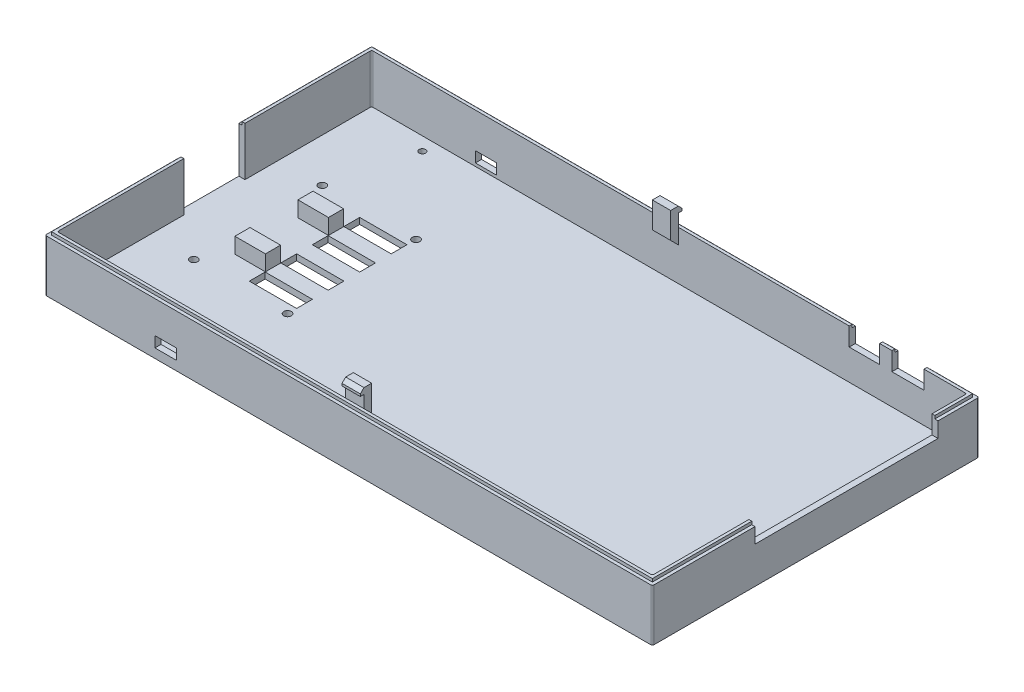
ISO-10303-21;
HEADER;
FILE_DESCRIPTION(('STEP AP214'),'2;1');
FILE_NAME('part.step','',(''),(''),'','','');
FILE_SCHEMA(('AUTOMOTIVE_DESIGN { 1 0 10303 214 1 1 1 1 }'));
ENDSEC;
DATA;
#1=APPLICATION_CONTEXT('core data for automotive mechanical design processes');
#2=APPLICATION_PROTOCOL_DEFINITION('international standard','automotive_design',2000,#1);
#3=PRODUCT_CONTEXT('',#1,'mechanical');
#4=PRODUCT('Part','Part','',(#3));
#5=PRODUCT_RELATED_PRODUCT_CATEGORY('part','',(#4));
#6=PRODUCT_DEFINITION_FORMATION('','',#4);
#7=PRODUCT_DEFINITION_CONTEXT('part definition',#1,'design');
#8=PRODUCT_DEFINITION('design','',#6,#7);
#9=PRODUCT_DEFINITION_SHAPE('','',#8);
#10=(LENGTH_UNIT() NAMED_UNIT(*) SI_UNIT(.MILLI.,.METRE.));
#11=(NAMED_UNIT(*) PLANE_ANGLE_UNIT() SI_UNIT($,.RADIAN.));
#12=(NAMED_UNIT(*) SI_UNIT($,.STERADIAN.) SOLID_ANGLE_UNIT());
#13=UNCERTAINTY_MEASURE_WITH_UNIT(LENGTH_MEASURE(1.E-05),#10,'distance_accuracy_value','');
#14=(GEOMETRIC_REPRESENTATION_CONTEXT(3) GLOBAL_UNCERTAINTY_ASSIGNED_CONTEXT((#13)) GLOBAL_UNIT_ASSIGNED_CONTEXT((#10,
#11,#12)) REPRESENTATION_CONTEXT('',''));
#15=CARTESIAN_POINT('',(0.,0.,0.));
#16=DIRECTION('',(0.,0.,1.));
#17=DIRECTION('',(1.,0.,0.));
#18=AXIS2_PLACEMENT_3D('',#15,#16,#17);
#19=CARTESIAN_POINT('',(0.,0.,51.5));
#20=DIRECTION('',(0.,0.,-1.));
#21=DIRECTION('',(-1.,0.,0.));
#22=AXIS2_PLACEMENT_3D('',#19,#20,#21);
#23=PLANE('',#22);
#24=DIRECTION('',(1.,0.,0.));
#25=VECTOR('',#24,1.);
#26=CARTESIAN_POINT('',(0.,22.05,51.5));
#27=LINE('',#26,#25);
#28=CARTESIAN_POINT('',(-3.,22.05,51.5));
#29=VERTEX_POINT('',#28);
#30=CARTESIAN_POINT('',(3.,22.05,51.5));
#31=VERTEX_POINT('',#30);
#32=EDGE_CURVE('E625',#29,#31,#27,.T.);
#33=ORIENTED_EDGE('',*,*,#32,.F.);
#34=DIRECTION('',(0.,1.,0.));
#35=VECTOR('',#34,1.);
#36=CARTESIAN_POINT('',(-3.00000000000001,0.,51.5));
#37=LINE('',#36,#35);
#38=CARTESIAN_POINT('',(-3.,18.,51.5));
#39=VERTEX_POINT('',#38);
#40=EDGE_CURVE('E641',#39,#29,#37,.T.);
#41=ORIENTED_EDGE('',*,*,#40,.F.);
#42=DIRECTION('',(-1.,0.,0.));
#43=VECTOR('',#42,1.);
#44=CARTESIAN_POINT('',(97.5,18.,51.5));
#45=LINE('',#44,#43);
#46=CARTESIAN_POINT('',(3.,18.,51.5));
#47=VERTEX_POINT('',#46);
#48=EDGE_CURVE('E1152',#47,#39,#45,.T.);
#49=ORIENTED_EDGE('',*,*,#48,.F.);
#50=DIRECTION('',(0.,1.,0.));
#51=VECTOR('',#50,1.);
#52=CARTESIAN_POINT('',(3.00000000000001,0.,51.5));
#53=LINE('',#52,#51);
#54=EDGE_CURVE('E642',#47,#31,#53,.T.);
#55=ORIENTED_EDGE('',*,*,#54,.T.);
#56=EDGE_LOOP('',(#33,#41,#49,#55));
#57=FACE_BOUND('',#56,.T.);
#58=ADVANCED_FACE('F45',(#57),#23,.F.);
#59=CARTESIAN_POINT('',(0.,0.,-51.5));
#60=DIRECTION('',(0.,0.,1.));
#61=DIRECTION('',(1.,0.,0.));
#62=AXIS2_PLACEMENT_3D('',#59,#60,#61);
#63=PLANE('',#62);
#64=DIRECTION('',(-1.,0.,0.));
#65=VECTOR('',#64,1.);
#66=CARTESIAN_POINT('',(0.,22.05,-51.5));
#67=LINE('',#66,#65);
#68=CARTESIAN_POINT('',(3.,22.05,-51.5));
#69=VERTEX_POINT('',#68);
#70=CARTESIAN_POINT('',(-3.,22.05,-51.5));
#71=VERTEX_POINT('',#70);
#72=EDGE_CURVE('E668',#69,#71,#67,.T.);
#73=ORIENTED_EDGE('',*,*,#72,.F.);
#74=DIRECTION('',(0.,1.,0.));
#75=VECTOR('',#74,1.);
#76=CARTESIAN_POINT('',(2.99999999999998,0.,-51.5));
#77=LINE('',#76,#75);
#78=CARTESIAN_POINT('',(2.99999999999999,18.,-51.5));
#79=VERTEX_POINT('',#78);
#80=EDGE_CURVE('E700',#79,#69,#77,.T.);
#81=ORIENTED_EDGE('',*,*,#80,.F.);
#82=DIRECTION('',(1.,0.,0.));
#83=VECTOR('',#82,1.);
#84=CARTESIAN_POINT('',(-97.5,18.,-51.5));
#85=LINE('',#84,#83);
#86=CARTESIAN_POINT('',(-3.,18.,-51.5));
#87=VERTEX_POINT('',#86);
#88=EDGE_CURVE('E1143',#87,#79,#85,.T.);
#89=ORIENTED_EDGE('',*,*,#88,.F.);
#90=DIRECTION('',(0.,1.,0.));
#91=VECTOR('',#90,1.);
#92=CARTESIAN_POINT('',(-3.,0.,-51.5));
#93=LINE('',#92,#91);
#94=EDGE_CURVE('E684',#87,#71,#93,.T.);
#95=ORIENTED_EDGE('',*,*,#94,.T.);
#96=EDGE_LOOP('',(#73,#81,#89,#95));
#97=FACE_BOUND('',#96,.T.);
#98=ADVANCED_FACE('F1470',(#97),#63,.F.);
#99=CARTESIAN_POINT('',(0.,18.,0.));
#100=DIRECTION('',(0.,-1.,0.));
#101=DIRECTION('',(0.,0.,-1.));
#102=AXIS2_PLACEMENT_3D('',#99,#100,#101);
#103=PLANE('',#102);
#104=DIRECTION('',(0.,0.,-1.));
#105=VECTOR('',#104,1.);
#106=CARTESIAN_POINT('',(98.45,18.,53.5));
#107=LINE('',#106,#105);
#108=CARTESIAN_POINT('',(98.45,18.,-40.12));
#109=VERTEX_POINT('',#108);
#110=CARTESIAN_POINT('',(98.45,18.,-52.45));
#111=VERTEX_POINT('',#110);
#112=EDGE_CURVE('E711',#109,#111,#107,.T.);
#113=ORIENTED_EDGE('',*,*,#112,.T.);
#114=DIRECTION('',(-1.,0.,0.));
#115=VECTOR('',#114,1.);
#116=CARTESIAN_POINT('',(99.5,18.,-52.45));
#117=LINE('',#116,#115);
#118=CARTESIAN_POINT('',(83.5,18.,-52.45));
#119=VERTEX_POINT('',#118);
#120=EDGE_CURVE('E755',#111,#119,#117,.T.);
#121=ORIENTED_EDGE('',*,*,#120,.T.);
#122=DIRECTION('',(0.,0.,-1.));
#123=VECTOR('',#122,1.);
#124=CARTESIAN_POINT('',(83.5,18.,-41.5));
#125=LINE('',#124,#123);
#126=CARTESIAN_POINT('',(83.5,18.,-51.5));
#127=VERTEX_POINT('',#126);
#128=EDGE_CURVE('E1099',#127,#119,#125,.T.);
#129=ORIENTED_EDGE('',*,*,#128,.F.);
#130=CARTESIAN_POINT('',(97.,18.,-51.5));
#131=VERTEX_POINT('',#130);
#132=EDGE_CURVE('E1131',#127,#131,#85,.T.);
#133=ORIENTED_EDGE('',*,*,#132,.T.);
#134=CARTESIAN_POINT('',(97.,18.,-51.));
#135=DIRECTION('',(0.,-1.,0.));
#136=DIRECTION('',(0.,0.,-1.));
#137=AXIS2_PLACEMENT_3D('',#134,#135,#136);
#138=CIRCLE('',#137,0.5);
#139=CARTESIAN_POINT('',(97.5,18.,-51.));
#140=VERTEX_POINT('',#139);
#141=EDGE_CURVE('E1317',#131,#140,#138,.T.);
#142=ORIENTED_EDGE('',*,*,#141,.T.);
#143=DIRECTION('',(0.,0.,1.));
#144=VECTOR('',#143,1.);
#145=CARTESIAN_POINT('',(97.5,18.,-51.5));
#146=LINE('',#145,#144);
#147=CARTESIAN_POINT('',(97.5,18.,-40.12));
#148=VERTEX_POINT('',#147);
#149=EDGE_CURVE('E1146',#140,#148,#146,.T.);
#150=ORIENTED_EDGE('',*,*,#149,.T.);
#151=DIRECTION('',(1.,0.,0.));
#152=VECTOR('',#151,1.);
#153=CARTESIAN_POINT('',(87.5,18.,-40.12));
#154=LINE('',#153,#152);
#155=EDGE_CURVE('E1127',#148,#109,#154,.T.);
#156=ORIENTED_EDGE('',*,*,#155,.T.);
#157=EDGE_LOOP('',(#113,#121,#129,#133,#142,#150,#156));
#158=FACE_BOUND('',#157,.T.);
#159=ADVANCED_FACE('F1402',(#158),#103,.F.);
#160=CARTESIAN_POINT('',(98.45,18.,52.45));
#161=VERTEX_POINT('',#160);
#162=CARTESIAN_POINT('',(98.45,18.,19.88));
#163=VERTEX_POINT('',#162);
#164=EDGE_CURVE('E715',#161,#163,#107,.T.);
#165=ORIENTED_EDGE('',*,*,#164,.T.);
#166=DIRECTION('',(1.,0.,0.));
#167=VECTOR('',#166,1.);
#168=CARTESIAN_POINT('',(87.5,18.,19.88));
#169=LINE('',#168,#167);
#170=CARTESIAN_POINT('',(97.5,18.,19.88));
#171=VERTEX_POINT('',#170);
#172=EDGE_CURVE('E1135',#171,#163,#169,.T.);
#173=ORIENTED_EDGE('',*,*,#172,.F.);
#174=CARTESIAN_POINT('',(97.5,18.,51.));
#175=VERTEX_POINT('',#174);
#176=EDGE_CURVE('E1142',#171,#175,#146,.T.);
#177=ORIENTED_EDGE('',*,*,#176,.T.);
#178=CARTESIAN_POINT('',(97.,18.,51.));
#179=DIRECTION('',(0.,-1.,0.));
#180=DIRECTION('',(0.,0.,-1.));
#181=AXIS2_PLACEMENT_3D('',#178,#179,#180);
#182=CIRCLE('',#181,0.5);
#183=CARTESIAN_POINT('',(97.,18.,51.5));
#184=VERTEX_POINT('',#183);
#185=EDGE_CURVE('E1319',#175,#184,#182,.T.);
#186=ORIENTED_EDGE('',*,*,#185,.T.);
#187=EDGE_CURVE('E1149',#184,#47,#45,.T.);
#188=ORIENTED_EDGE('',*,*,#187,.T.);
#189=ORIENTED_EDGE('',*,*,#48,.T.);
#190=CARTESIAN_POINT('',(-97.,18.,51.5));
#191=VERTEX_POINT('',#190);
#192=EDGE_CURVE('E1148',#39,#191,#45,.T.);
#193=ORIENTED_EDGE('',*,*,#192,.T.);
#194=CARTESIAN_POINT('',(-97.,18.,51.));
#195=DIRECTION('',(0.,-1.,0.));
#196=DIRECTION('',(0.,0.,-1.));
#197=AXIS2_PLACEMENT_3D('',#194,#195,#196);
#198=CIRCLE('',#197,0.5);
#199=CARTESIAN_POINT('',(-97.5,18.,51.));
#200=VERTEX_POINT('',#199);
#201=EDGE_CURVE('E11',#191,#200,#198,.T.);
#202=ORIENTED_EDGE('',*,*,#201,.T.);
#203=DIRECTION('',(0.,0.,-1.));
#204=VECTOR('',#203,1.);
#205=CARTESIAN_POINT('',(-97.5,18.,51.5));
#206=LINE('',#205,#204);
#207=CARTESIAN_POINT('',(-97.5,18.,9.99999999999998));
#208=VERTEX_POINT('',#207);
#209=EDGE_CURVE('E1153',#200,#208,#206,.T.);
#210=ORIENTED_EDGE('',*,*,#209,.T.);
#211=DIRECTION('',(-1.,0.,0.));
#212=VECTOR('',#211,1.);
#213=CARTESIAN_POINT('',(-87.5,18.,9.99999999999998));
#214=LINE('',#213,#212);
#215=CARTESIAN_POINT('',(-98.45,18.,9.99999999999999));
#216=VERTEX_POINT('',#215);
#217=EDGE_CURVE('E1071',#208,#216,#214,.T.);
#218=ORIENTED_EDGE('',*,*,#217,.T.);
#219=DIRECTION('',(0.,0.,1.));
#220=VECTOR('',#219,1.);
#221=CARTESIAN_POINT('',(-98.45,18.,-53.5));
#222=LINE('',#221,#220);
#223=CARTESIAN_POINT('',(-98.45,18.,52.45));
#224=VERTEX_POINT('',#223);
#225=EDGE_CURVE('E782',#216,#224,#222,.T.);
#226=ORIENTED_EDGE('',*,*,#225,.T.);
#227=DIRECTION('',(-1.,0.,0.));
#228=VECTOR('',#227,1.);
#229=CARTESIAN_POINT('',(99.5,18.,52.45));
#230=LINE('',#229,#228);
#231=EDGE_CURVE('E735',#161,#224,#230,.T.);
#232=ORIENTED_EDGE('',*,*,#231,.F.);
#233=EDGE_LOOP('',(#165,#173,#177,#186,#188,#189,#193,#202,#210,#218,#226,#232));
#234=FACE_BOUND('',#233,.T.);
#235=ADVANCED_FACE('F1539',(#234),#103,.F.);
#236=CARTESIAN_POINT('',(87.5,0.,-40.12));
#237=DIRECTION('',(0.,0.,1.));
#238=DIRECTION('',(1.,0.,0.));
#239=AXIS2_PLACEMENT_3D('',#236,#237,#238);
#240=PLANE('',#239);
#241=DIRECTION('',(1.,0.,0.));
#242=VECTOR('',#241,1.);
#243=CARTESIAN_POINT('',(87.5,17.,-40.12));
#244=LINE('',#243,#242);
#245=CARTESIAN_POINT('',(98.45,17.,-40.12));
#246=VERTEX_POINT('',#245);
#247=CARTESIAN_POINT('',(99.5,17.,-40.12));
#248=VERTEX_POINT('',#247);
#249=EDGE_CURVE('E721',#246,#248,#244,.T.);
#250=ORIENTED_EDGE('',*,*,#249,.F.);
#251=DIRECTION('',(0.,1.,0.));
#252=VECTOR('',#251,1.);
#253=CARTESIAN_POINT('',(98.45,0.,-40.12));
#254=LINE('',#253,#252);
#255=EDGE_CURVE('E729',#246,#109,#254,.T.);
#256=ORIENTED_EDGE('',*,*,#255,.T.);
#257=ORIENTED_EDGE('',*,*,#155,.F.);
#258=DIRECTION('',(0.,-1.,0.));
#259=VECTOR('',#258,1.);
#260=CARTESIAN_POINT('',(97.5,18.,-40.12));
#261=LINE('',#260,#259);
#262=CARTESIAN_POINT('',(97.5,12.,-40.12));
#263=VERTEX_POINT('',#262);
#264=EDGE_CURVE('E1185',#148,#263,#261,.T.);
#265=ORIENTED_EDGE('',*,*,#264,.T.);
#266=DIRECTION('',(1.,0.,0.));
#267=VECTOR('',#266,1.);
#268=CARTESIAN_POINT('',(87.5,12.,-40.12));
#269=LINE('',#268,#267);
#270=CARTESIAN_POINT('',(99.5,12.,-40.12));
#271=VERTEX_POINT('',#270);
#272=EDGE_CURVE('E1128',#263,#271,#269,.T.);
#273=ORIENTED_EDGE('',*,*,#272,.T.);
#274=DIRECTION('',(0.,-1.,0.));
#275=VECTOR('',#274,1.);
#276=CARTESIAN_POINT('',(99.5,0.,-40.12));
#277=LINE('',#276,#275);
#278=EDGE_CURVE('E1095',#248,#271,#277,.T.);
#279=ORIENTED_EDGE('',*,*,#278,.F.);
#280=EDGE_LOOP('',(#250,#256,#257,#265,#273,#279));
#281=FACE_BOUND('',#280,.T.);
#282=ADVANCED_FACE('F1528',(#281),#240,.T.);
#283=CARTESIAN_POINT('',(87.5,0.,19.88));
#284=DIRECTION('',(0.,0.,1.));
#285=DIRECTION('',(1.,0.,0.));
#286=AXIS2_PLACEMENT_3D('',#283,#284,#285);
#287=PLANE('',#286);
#288=DIRECTION('',(0.,1.,0.));
#289=VECTOR('',#288,1.);
#290=CARTESIAN_POINT('',(98.45,0.,19.88));
#291=LINE('',#290,#289);
#292=CARTESIAN_POINT('',(98.45,17.,19.88));
#293=VERTEX_POINT('',#292);
#294=EDGE_CURVE('E727',#293,#163,#291,.T.);
#295=ORIENTED_EDGE('',*,*,#294,.F.);
#296=DIRECTION('',(1.,0.,0.));
#297=VECTOR('',#296,1.);
#298=CARTESIAN_POINT('',(87.5,17.,19.88));
#299=LINE('',#298,#297);
#300=CARTESIAN_POINT('',(99.5,17.,19.88));
#301=VERTEX_POINT('',#300);
#302=EDGE_CURVE('E718',#293,#301,#299,.T.);
#303=ORIENTED_EDGE('',*,*,#302,.T.);
#304=DIRECTION('',(0.,-1.,0.));
#305=VECTOR('',#304,1.);
#306=CARTESIAN_POINT('',(99.5,0.,19.88));
#307=LINE('',#306,#305);
#308=CARTESIAN_POINT('',(99.5,12.,19.88));
#309=VERTEX_POINT('',#308);
#310=EDGE_CURVE('E1122',#301,#309,#307,.T.);
#311=ORIENTED_EDGE('',*,*,#310,.T.);
#312=DIRECTION('',(1.,0.,0.));
#313=VECTOR('',#312,1.);
#314=CARTESIAN_POINT('',(87.5,12.,19.88));
#315=LINE('',#314,#313);
#316=CARTESIAN_POINT('',(97.5,12.,19.88));
#317=VERTEX_POINT('',#316);
#318=EDGE_CURVE('E1132',#317,#309,#315,.T.);
#319=ORIENTED_EDGE('',*,*,#318,.F.);
#320=DIRECTION('',(0.,-1.,0.));
#321=VECTOR('',#320,1.);
#322=CARTESIAN_POINT('',(97.5,18.,19.88));
#323=LINE('',#322,#321);
#324=EDGE_CURVE('E1179',#171,#317,#323,.T.);
#325=ORIENTED_EDGE('',*,*,#324,.F.);
#326=ORIENTED_EDGE('',*,*,#172,.T.);
#327=EDGE_LOOP('',(#295,#303,#311,#319,#325,#326));
#328=FACE_BOUND('',#327,.T.);
#329=ADVANCED_FACE('F1521',(#328),#287,.F.);
#330=CARTESIAN_POINT('',(99.5,0.,52.45));
#331=DIRECTION('',(0.,0.,-1.));
#332=DIRECTION('',(-1.,0.,0.));
#333=AXIS2_PLACEMENT_3D('',#330,#331,#332);
#334=PLANE('',#333);
#335=DIRECTION('',(0.,-1.,0.));
#336=VECTOR('',#335,1.);
#337=CARTESIAN_POINT('',(98.45,0.,52.45));
#338=LINE('',#337,#336);
#339=CARTESIAN_POINT('',(98.45,17.,52.45));
#340=VERTEX_POINT('',#339);
#341=EDGE_CURVE('E724',#161,#340,#338,.T.);
#342=ORIENTED_EDGE('',*,*,#341,.F.);
#343=ORIENTED_EDGE('',*,*,#231,.T.);
#344=DIRECTION('',(0.,-1.,0.));
#345=VECTOR('',#344,1.);
#346=CARTESIAN_POINT('',(-98.45,0.,52.45));
#347=LINE('',#346,#345);
#348=CARTESIAN_POINT('',(-98.45,17.,52.45));
#349=VERTEX_POINT('',#348);
#350=EDGE_CURVE('E736',#224,#349,#347,.T.);
#351=ORIENTED_EDGE('',*,*,#350,.T.);
#352=DIRECTION('',(-1.,0.,0.));
#353=VECTOR('',#352,1.);
#354=CARTESIAN_POINT('',(99.5,17.,52.45));
#355=LINE('',#354,#353);
#356=EDGE_CURVE('E740',#340,#349,#355,.T.);
#357=ORIENTED_EDGE('',*,*,#356,.F.);
#358=EDGE_LOOP('',(#342,#343,#351,#357));
#359=FACE_BOUND('',#358,.T.);
#360=ADVANCED_FACE('F1519',(#359),#334,.F.);
#361=CARTESIAN_POINT('',(99.5,0.,-52.45));
#362=DIRECTION('',(0.,0.,-1.));
#363=DIRECTION('',(-1.,0.,0.));
#364=AXIS2_PLACEMENT_3D('',#361,#362,#363);
#365=PLANE('',#364);
#366=ORIENTED_EDGE('',*,*,#120,.F.);
#367=DIRECTION('',(0.,-1.,0.));
#368=VECTOR('',#367,1.);
#369=CARTESIAN_POINT('',(98.45,0.,-52.45));
#370=LINE('',#369,#368);
#371=CARTESIAN_POINT('',(98.45,17.,-52.45));
#372=VERTEX_POINT('',#371);
#373=EDGE_CURVE('E708',#111,#372,#370,.T.);
#374=ORIENTED_EDGE('',*,*,#373,.T.);
#375=DIRECTION('',(-1.,0.,0.));
#376=VECTOR('',#375,1.);
#377=CARTESIAN_POINT('',(99.5,17.,-52.45));
#378=LINE('',#377,#376);
#379=CARTESIAN_POINT('',(83.5,17.,-52.45));
#380=VERTEX_POINT('',#379);
#381=EDGE_CURVE('E739',#372,#380,#378,.T.);
#382=ORIENTED_EDGE('',*,*,#381,.T.);
#383=DIRECTION('',(0.,1.,0.));
#384=VECTOR('',#383,1.);
#385=CARTESIAN_POINT('',(83.5,0.,-52.45));
#386=LINE('',#385,#384);
#387=EDGE_CURVE('E768',#380,#119,#386,.T.);
#388=ORIENTED_EDGE('',*,*,#387,.T.);
#389=EDGE_LOOP('',(#366,#374,#382,#388));
#390=FACE_BOUND('',#389,.T.);
#391=ADVANCED_FACE('F1465',(#390),#365,.T.);
#392=CARTESIAN_POINT('',(59.,18.,-52.45));
#393=VERTEX_POINT('',#392);
#394=CARTESIAN_POINT('',(-98.45,18.,-52.45));
#395=VERTEX_POINT('',#394);
#396=EDGE_CURVE('E746',#393,#395,#117,.T.);
#397=ORIENTED_EDGE('',*,*,#396,.T.);
#398=CARTESIAN_POINT('',(-98.45,18.,-10.));
#399=VERTEX_POINT('',#398);
#400=EDGE_CURVE('E792',#395,#399,#222,.T.);
#401=ORIENTED_EDGE('',*,*,#400,.T.);
#402=DIRECTION('',(-1.,0.,0.));
#403=VECTOR('',#402,1.);
#404=CARTESIAN_POINT('',(-87.5,18.,-10.));
#405=LINE('',#404,#403);
#406=CARTESIAN_POINT('',(-97.5,18.,-10.));
#407=VERTEX_POINT('',#406);
#408=EDGE_CURVE('E1070',#407,#399,#405,.T.);
#409=ORIENTED_EDGE('',*,*,#408,.F.);
#410=CARTESIAN_POINT('',(-97.5,18.,-51.));
#411=VERTEX_POINT('',#410);
#412=EDGE_CURVE('E1151',#407,#411,#206,.T.);
#413=ORIENTED_EDGE('',*,*,#412,.T.);
#414=CARTESIAN_POINT('',(-97.,18.,-51.));
#415=DIRECTION('',(0.,-1.,0.));
#416=DIRECTION('',(0.,0.,-1.));
#417=AXIS2_PLACEMENT_3D('',#414,#415,#416);
#418=CIRCLE('',#417,0.5);
#419=CARTESIAN_POINT('',(-97.,18.,-51.5));
#420=VERTEX_POINT('',#419);
#421=EDGE_CURVE('E53',#411,#420,#418,.T.);
#422=ORIENTED_EDGE('',*,*,#421,.T.);
#423=EDGE_CURVE('E1140',#420,#87,#85,.T.);
#424=ORIENTED_EDGE('',*,*,#423,.T.);
#425=ORIENTED_EDGE('',*,*,#88,.T.);
#426=CARTESIAN_POINT('',(59.,18.,-51.5));
#427=VERTEX_POINT('',#426);
#428=EDGE_CURVE('E1144',#79,#427,#85,.T.);
#429=ORIENTED_EDGE('',*,*,#428,.T.);
#430=DIRECTION('',(0.,0.,-1.));
#431=VECTOR('',#430,1.);
#432=CARTESIAN_POINT('',(59.,18.,-41.5));
#433=LINE('',#432,#431);
#434=EDGE_CURVE('E1110',#427,#393,#433,.T.);
#435=ORIENTED_EDGE('',*,*,#434,.T.);
#436=EDGE_LOOP('',(#397,#401,#409,#413,#422,#424,#425,#429,#435));
#437=FACE_BOUND('',#436,.T.);
#438=ADVANCED_FACE('F1325',(#437),#103,.F.);
#439=CARTESIAN_POINT('',(99.5,18.,53.5));
#440=DIRECTION('',(0.,0.,1.));
#441=DIRECTION('',(1.,0.,0.));
#442=AXIS2_PLACEMENT_3D('',#439,#440,#441);
#443=PLANE('',#442);
#444=DIRECTION('',(1.,0.,0.));
#445=VECTOR('',#444,1.);
#446=CARTESIAN_POINT('',(99.5,3.,53.5));
#447=LINE('',#446,#445);
#448=CARTESIAN_POINT('',(-63.5,3.,53.5));
#449=VERTEX_POINT('',#448);
#450=CARTESIAN_POINT('',(-56.5,3.,53.5));
#451=VERTEX_POINT('',#450);
#452=EDGE_CURVE('E839',#449,#451,#447,.T.);
#453=ORIENTED_EDGE('',*,*,#452,.F.);
#454=DIRECTION('',(0.,1.,0.));
#455=VECTOR('',#454,1.);
#456=CARTESIAN_POINT('',(-63.5,18.,53.5));
#457=LINE('',#456,#455);
#458=CARTESIAN_POINT('',(-63.5,6.5,53.5));
#459=VERTEX_POINT('',#458);
#460=EDGE_CURVE('E834',#449,#459,#457,.T.);
#461=ORIENTED_EDGE('',*,*,#460,.T.);
#462=DIRECTION('',(1.,0.,0.));
#463=VECTOR('',#462,1.);
#464=CARTESIAN_POINT('',(99.5,6.5,53.5));
#465=LINE('',#464,#463);
#466=CARTESIAN_POINT('',(-56.5,6.5,53.5));
#467=VERTEX_POINT('',#466);
#468=EDGE_CURVE('E829',#459,#467,#465,.T.);
#469=ORIENTED_EDGE('',*,*,#468,.T.);
#470=DIRECTION('',(0.,1.,0.));
#471=VECTOR('',#470,1.);
#472=CARTESIAN_POINT('',(-56.5,18.,53.5));
#473=LINE('',#472,#471);
#474=EDGE_CURVE('E813',#451,#467,#473,.T.);
#475=ORIENTED_EDGE('',*,*,#474,.F.);
#476=EDGE_LOOP('',(#453,#461,#469,#475));
#477=FACE_BOUND('',#476,.T.);
#478=DIRECTION('',(1.,0.,0.));
#479=VECTOR('',#478,1.);
#480=CARTESIAN_POINT('',(0.,17.,53.5));
#481=LINE('',#480,#479);
#482=CARTESIAN_POINT('',(-99.,17.,53.5));
#483=VERTEX_POINT('',#482);
#484=CARTESIAN_POINT('',(99.,17.,53.5));
#485=VERTEX_POINT('',#484);
#486=EDGE_CURVE('E779',#483,#485,#481,.T.);
#487=ORIENTED_EDGE('',*,*,#486,.F.);
#488=DIRECTION('',(0.,-1.,0.));
#489=VECTOR('',#488,1.);
#490=CARTESIAN_POINT('',(-99.,18.,53.5));
#491=LINE('',#490,#489);
#492=CARTESIAN_POINT('',(-99.,0.,53.5));
#493=VERTEX_POINT('',#492);
#494=EDGE_CURVE('E1285',#483,#493,#491,.T.);
#495=ORIENTED_EDGE('',*,*,#494,.T.);
#496=DIRECTION('',(-1.,0.,0.));
#497=VECTOR('',#496,1.);
#498=CARTESIAN_POINT('',(99.5,0.,53.5));
#499=LINE('',#498,#497);
#500=CARTESIAN_POINT('',(99.,0.,53.5));
#501=VERTEX_POINT('',#500);
#502=EDGE_CURVE('E1158',#501,#493,#499,.T.);
#503=ORIENTED_EDGE('',*,*,#502,.F.);
#504=DIRECTION('',(0.,-1.,0.));
#505=VECTOR('',#504,1.);
#506=CARTESIAN_POINT('',(99.,18.,53.5));
#507=LINE('',#506,#505);
#508=EDGE_CURVE('E1283',#501,#485,#507,.F.);
#509=ORIENTED_EDGE('',*,*,#508,.T.);
#510=EDGE_LOOP('',(#487,#495,#503,#509));
#511=FACE_BOUND('',#510,.T.);
#512=ADVANCED_FACE('F1559',(#477,#511),#443,.T.);
#513=CARTESIAN_POINT('',(73.,18.,-52.45));
#514=VERTEX_POINT('',#513);
#515=CARTESIAN_POINT('',(69.,18.,-52.45));
#516=VERTEX_POINT('',#515);
#517=EDGE_CURVE('E757',#514,#516,#117,.T.);
#518=ORIENTED_EDGE('',*,*,#517,.T.);
#519=DIRECTION('',(0.,0.,-1.));
#520=VECTOR('',#519,1.);
#521=CARTESIAN_POINT('',(69.,18.,-41.5));
#522=LINE('',#521,#520);
#523=CARTESIAN_POINT('',(69.,18.,-51.5));
#524=VERTEX_POINT('',#523);
#525=EDGE_CURVE('E1116',#524,#516,#522,.T.);
#526=ORIENTED_EDGE('',*,*,#525,.F.);
#527=CARTESIAN_POINT('',(73.,18.,-51.5));
#528=VERTEX_POINT('',#527);
#529=EDGE_CURVE('E1145',#524,#528,#85,.T.);
#530=ORIENTED_EDGE('',*,*,#529,.T.);
#531=DIRECTION('',(0.,0.,-1.));
#532=VECTOR('',#531,1.);
#533=CARTESIAN_POINT('',(73.,18.,-41.5));
#534=LINE('',#533,#532);
#535=EDGE_CURVE('E1091',#528,#514,#534,.T.);
#536=ORIENTED_EDGE('',*,*,#535,.T.);
#537=EDGE_LOOP('',(#518,#526,#530,#536));
#538=FACE_BOUND('',#537,.T.);
#539=ADVANCED_FACE('F1438',(#538),#103,.F.);
#540=CARTESIAN_POINT('',(99.5,18.,-53.5));
#541=DIRECTION('',(1.,0.,0.));
#542=DIRECTION('',(0.,0.,-1.));
#543=AXIS2_PLACEMENT_3D('',#540,#541,#542);
#544=PLANE('',#543);
#545=DIRECTION('',(0.,0.,1.));
#546=VECTOR('',#545,1.);
#547=CARTESIAN_POINT('',(99.5,0.,-53.5));
#548=LINE('',#547,#546);
#549=CARTESIAN_POINT('',(99.5,0.,-53.));
#550=VERTEX_POINT('',#549);
#551=CARTESIAN_POINT('',(99.5,0.,53.));
#552=VERTEX_POINT('',#551);
#553=EDGE_CURVE('E1155',#550,#552,#548,.T.);
#554=ORIENTED_EDGE('',*,*,#553,.F.);
#555=DIRECTION('',(0.,-1.,0.));
#556=VECTOR('',#555,1.);
#557=CARTESIAN_POINT('',(99.5,18.,-53.));
#558=LINE('',#557,#556);
#559=CARTESIAN_POINT('',(99.5,17.,-53.));
#560=VERTEX_POINT('',#559);
#561=EDGE_CURVE('E60',#550,#560,#558,.F.);
#562=ORIENTED_EDGE('',*,*,#561,.T.);
#563=DIRECTION('',(0.,0.,1.));
#564=VECTOR('',#563,1.);
#565=CARTESIAN_POINT('',(99.5,17.,0.));
#566=LINE('',#565,#564);
#567=EDGE_CURVE('E744',#560,#248,#566,.T.);
#568=ORIENTED_EDGE('',*,*,#567,.T.);
#569=ORIENTED_EDGE('',*,*,#278,.T.);
#570=DIRECTION('',(0.,0.,-1.));
#571=VECTOR('',#570,1.);
#572=CARTESIAN_POINT('',(99.5,12.,0.));
#573=LINE('',#572,#571);
#574=EDGE_CURVE('E1124',#309,#271,#573,.T.);
#575=ORIENTED_EDGE('',*,*,#574,.F.);
#576=ORIENTED_EDGE('',*,*,#310,.F.);
#577=DIRECTION('',(0.,0.,-1.));
#578=VECTOR('',#577,1.);
#579=CARTESIAN_POINT('',(99.5,17.,0.));
#580=LINE('',#579,#578);
#581=CARTESIAN_POINT('',(99.5,17.,53.));
#582=VERTEX_POINT('',#581);
#583=EDGE_CURVE('E733',#582,#301,#580,.T.);
#584=ORIENTED_EDGE('',*,*,#583,.F.);
#585=DIRECTION('',(0.,-1.,0.));
#586=VECTOR('',#585,1.);
#587=CARTESIAN_POINT('',(99.5,18.,53.));
#588=LINE('',#587,#586);
#589=EDGE_CURVE('E1311',#582,#552,#588,.T.);
#590=ORIENTED_EDGE('',*,*,#589,.T.);
#591=EDGE_LOOP('',(#554,#562,#568,#569,#575,#576,#584,#590));
#592=FACE_BOUND('',#591,.T.);
#593=ADVANCED_FACE('F1566',(#592),#544,.T.);
#594=CARTESIAN_POINT('',(59.,0.,-41.5));
#595=DIRECTION('',(1.,0.,0.));
#596=DIRECTION('',(0.,1.,0.));
#597=AXIS2_PLACEMENT_3D('',#594,#595,#596);
#598=PLANE('',#597);
#599=DIRECTION('',(0.,0.,-1.));
#600=VECTOR('',#599,1.);
#601=CARTESIAN_POINT('',(59.,17.,-41.5));
#602=LINE('',#601,#600);
#603=CARTESIAN_POINT('',(59.,17.,-52.45));
#604=VERTEX_POINT('',#603);
#605=CARTESIAN_POINT('',(59.,17.,-53.5));
#606=VERTEX_POINT('',#605);
#607=EDGE_CURVE('E765',#604,#606,#602,.T.);
#608=ORIENTED_EDGE('',*,*,#607,.F.);
#609=DIRECTION('',(0.,1.,0.));
#610=VECTOR('',#609,1.);
#611=CARTESIAN_POINT('',(59.,0.,-52.45));
#612=LINE('',#611,#610);
#613=EDGE_CURVE('E776',#604,#393,#612,.T.);
#614=ORIENTED_EDGE('',*,*,#613,.T.);
#615=ORIENTED_EDGE('',*,*,#434,.F.);
#616=DIRECTION('',(0.,-1.,0.));
#617=VECTOR('',#616,1.);
#618=CARTESIAN_POINT('',(59.,18.0000000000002,-51.5));
#619=LINE('',#618,#617);
#620=CARTESIAN_POINT('',(59.,12.,-51.5));
#621=VERTEX_POINT('',#620);
#622=EDGE_CURVE('E1193',#427,#621,#619,.T.);
#623=ORIENTED_EDGE('',*,*,#622,.T.);
#624=DIRECTION('',(0.,0.,-1.));
#625=VECTOR('',#624,1.);
#626=CARTESIAN_POINT('',(59.,12.,-41.5));
#627=LINE('',#626,#625);
#628=CARTESIAN_POINT('',(59.,12.,-53.5));
#629=VERTEX_POINT('',#628);
#630=EDGE_CURVE('E1086',#621,#629,#627,.T.);
#631=ORIENTED_EDGE('',*,*,#630,.T.);
#632=DIRECTION('',(0.,-1.,0.));
#633=VECTOR('',#632,1.);
#634=CARTESIAN_POINT('',(59.,0.,-53.5));
#635=LINE('',#634,#633);
#636=EDGE_CURVE('E1074',#606,#629,#635,.T.);
#637=ORIENTED_EDGE('',*,*,#636,.F.);
#638=EDGE_LOOP('',(#608,#614,#615,#623,#631,#637));
#639=FACE_BOUND('',#638,.T.);
#640=ADVANCED_FACE('F1411',(#639),#598,.T.);
#641=CARTESIAN_POINT('',(69.,0.,-41.5));
#642=DIRECTION('',(1.,0.,0.));
#643=DIRECTION('',(0.,0.,-1.));
#644=AXIS2_PLACEMENT_3D('',#641,#642,#643);
#645=PLANE('',#644);
#646=DIRECTION('',(0.,1.,0.));
#647=VECTOR('',#646,1.);
#648=CARTESIAN_POINT('',(69.,0.,-52.45));
#649=LINE('',#648,#647);
#650=CARTESIAN_POINT('',(69.,17.,-52.45));
#651=VERTEX_POINT('',#650);
#652=EDGE_CURVE('E774',#651,#516,#649,.T.);
#653=ORIENTED_EDGE('',*,*,#652,.F.);
#654=DIRECTION('',(0.,0.,-1.));
#655=VECTOR('',#654,1.);
#656=CARTESIAN_POINT('',(69.,17.,-41.5));
#657=LINE('',#656,#655);
#658=CARTESIAN_POINT('',(69.,17.,-53.5));
#659=VERTEX_POINT('',#658);
#660=EDGE_CURVE('E762',#651,#659,#657,.T.);
#661=ORIENTED_EDGE('',*,*,#660,.T.);
#662=DIRECTION('',(0.,-1.,0.));
#663=VECTOR('',#662,1.);
#664=CARTESIAN_POINT('',(69.,0.,-53.5));
#665=LINE('',#664,#663);
#666=CARTESIAN_POINT('',(69.,12.,-53.5));
#667=VERTEX_POINT('',#666);
#668=EDGE_CURVE('E1105',#659,#667,#665,.T.);
#669=ORIENTED_EDGE('',*,*,#668,.T.);
#670=DIRECTION('',(0.,0.,-1.));
#671=VECTOR('',#670,1.);
#672=CARTESIAN_POINT('',(69.,12.,-41.5));
#673=LINE('',#672,#671);
#674=CARTESIAN_POINT('',(69.,12.,-51.5));
#675=VERTEX_POINT('',#674);
#676=EDGE_CURVE('E1113',#675,#667,#673,.T.);
#677=ORIENTED_EDGE('',*,*,#676,.F.);
#678=DIRECTION('',(0.,-1.,0.));
#679=VECTOR('',#678,1.);
#680=CARTESIAN_POINT('',(69.,18.,-51.5));
#681=LINE('',#680,#679);
#682=EDGE_CURVE('E1187',#524,#675,#681,.T.);
#683=ORIENTED_EDGE('',*,*,#682,.F.);
#684=ORIENTED_EDGE('',*,*,#525,.T.);
#685=EDGE_LOOP('',(#653,#661,#669,#677,#683,#684));
#686=FACE_BOUND('',#685,.T.);
#687=ADVANCED_FACE('F1435',(#686),#645,.F.);
#688=CARTESIAN_POINT('',(73.,0.,-41.5));
#689=DIRECTION('',(1.,0.,0.));
#690=DIRECTION('',(0.,0.,-1.));
#691=AXIS2_PLACEMENT_3D('',#688,#689,#690);
#692=PLANE('',#691);
#693=DIRECTION('',(0.,0.,-1.));
#694=VECTOR('',#693,1.);
#695=CARTESIAN_POINT('',(73.,17.,-41.5));
#696=LINE('',#695,#694);
#697=CARTESIAN_POINT('',(73.,17.,-52.45));
#698=VERTEX_POINT('',#697);
#699=CARTESIAN_POINT('',(73.,17.,-53.5));
#700=VERTEX_POINT('',#699);
#701=EDGE_CURVE('E760',#698,#700,#696,.T.);
#702=ORIENTED_EDGE('',*,*,#701,.F.);
#703=DIRECTION('',(0.,1.,0.));
#704=VECTOR('',#703,1.);
#705=CARTESIAN_POINT('',(73.,0.,-52.45));
#706=LINE('',#705,#704);
#707=EDGE_CURVE('E771',#698,#514,#706,.T.);
#708=ORIENTED_EDGE('',*,*,#707,.T.);
#709=ORIENTED_EDGE('',*,*,#535,.F.);
#710=DIRECTION('',(0.,-1.,0.));
#711=VECTOR('',#710,1.);
#712=CARTESIAN_POINT('',(73.,18.,-51.5));
#713=LINE('',#712,#711);
#714=CARTESIAN_POINT('',(73.,12.,-51.5));
#715=VERTEX_POINT('',#714);
#716=EDGE_CURVE('E1201',#528,#715,#713,.T.);
#717=ORIENTED_EDGE('',*,*,#716,.T.);
#718=DIRECTION('',(0.,0.,-1.));
#719=VECTOR('',#718,1.);
#720=CARTESIAN_POINT('',(73.,12.,-41.5));
#721=LINE('',#720,#719);
#722=CARTESIAN_POINT('',(73.,12.,-53.5));
#723=VERTEX_POINT('',#722);
#724=EDGE_CURVE('E1092',#715,#723,#721,.T.);
#725=ORIENTED_EDGE('',*,*,#724,.T.);
#726=DIRECTION('',(0.,-1.,0.));
#727=VECTOR('',#726,1.);
#728=CARTESIAN_POINT('',(73.,0.,-53.5));
#729=LINE('',#728,#727);
#730=EDGE_CURVE('E1083',#700,#723,#729,.T.);
#731=ORIENTED_EDGE('',*,*,#730,.F.);
#732=EDGE_LOOP('',(#702,#708,#709,#717,#725,#731));
#733=FACE_BOUND('',#732,.T.);
#734=ADVANCED_FACE('F1443',(#733),#692,.T.);
#735=CARTESIAN_POINT('',(83.5,0.,-41.5));
#736=DIRECTION('',(1.,0.,0.));
#737=DIRECTION('',(0.,0.,-1.));
#738=AXIS2_PLACEMENT_3D('',#735,#736,#737);
#739=PLANE('',#738);
#740=ORIENTED_EDGE('',*,*,#387,.F.);
#741=DIRECTION('',(0.,0.,-1.));
#742=VECTOR('',#741,1.);
#743=CARTESIAN_POINT('',(83.5,17.,-41.5));
#744=LINE('',#743,#742);
#745=CARTESIAN_POINT('',(83.5,17.,-53.5));
#746=VERTEX_POINT('',#745);
#747=EDGE_CURVE('E742',#380,#746,#744,.T.);
#748=ORIENTED_EDGE('',*,*,#747,.T.);
#749=DIRECTION('',(0.,-1.,0.));
#750=VECTOR('',#749,1.);
#751=CARTESIAN_POINT('',(83.5,0.,-53.5));
#752=LINE('',#751,#750);
#753=CARTESIAN_POINT('',(83.5,12.,-53.5));
#754=VERTEX_POINT('',#753);
#755=EDGE_CURVE('E1085',#746,#754,#752,.T.);
#756=ORIENTED_EDGE('',*,*,#755,.T.);
#757=DIRECTION('',(0.,0.,-1.));
#758=VECTOR('',#757,1.);
#759=CARTESIAN_POINT('',(83.5,12.,-41.5));
#760=LINE('',#759,#758);
#761=CARTESIAN_POINT('',(83.5,12.,-51.5));
#762=VERTEX_POINT('',#761);
#763=EDGE_CURVE('E1096',#762,#754,#760,.T.);
#764=ORIENTED_EDGE('',*,*,#763,.F.);
#765=DIRECTION('',(0.,-1.,0.));
#766=VECTOR('',#765,1.);
#767=CARTESIAN_POINT('',(83.5,18.,-51.5));
#768=LINE('',#767,#766);
#769=EDGE_CURVE('E1195',#127,#762,#768,.T.);
#770=ORIENTED_EDGE('',*,*,#769,.F.);
#771=ORIENTED_EDGE('',*,*,#128,.T.);
#772=EDGE_LOOP('',(#740,#748,#756,#764,#770,#771));
#773=FACE_BOUND('',#772,.T.);
#774=ADVANCED_FACE('F1726',(#773),#739,.F.);
#775=CARTESIAN_POINT('',(-98.45,0.,-53.5));
#776=DIRECTION('',(-1.,0.,0.));
#777=DIRECTION('',(0.,0.,1.));
#778=AXIS2_PLACEMENT_3D('',#775,#776,#777);
#779=PLANE('',#778);
#780=ORIENTED_EDGE('',*,*,#400,.F.);
#781=DIRECTION('',(0.,-1.,0.));
#782=VECTOR('',#781,1.);
#783=CARTESIAN_POINT('',(-98.45,0.,-52.45));
#784=LINE('',#783,#782);
#785=CARTESIAN_POINT('',(-98.45,17.,-52.45));
#786=VERTEX_POINT('',#785);
#787=EDGE_CURVE('E732',#395,#786,#784,.T.);
#788=ORIENTED_EDGE('',*,*,#787,.T.);
#789=DIRECTION('',(0.,0.,1.));
#790=VECTOR('',#789,1.);
#791=CARTESIAN_POINT('',(-98.45,17.,-53.5));
#792=LINE('',#791,#790);
#793=CARTESIAN_POINT('',(-98.45,17.,-10.));
#794=VERTEX_POINT('',#793);
#795=EDGE_CURVE('E785',#786,#794,#792,.T.);
#796=ORIENTED_EDGE('',*,*,#795,.T.);
#797=DIRECTION('',(0.,1.,0.));
#798=VECTOR('',#797,1.);
#799=CARTESIAN_POINT('',(-98.45,0.,-10.));
#800=LINE('',#799,#798);
#801=EDGE_CURVE('E1222',#794,#399,#800,.T.);
#802=ORIENTED_EDGE('',*,*,#801,.T.);
#803=EDGE_LOOP('',(#780,#788,#796,#802));
#804=FACE_BOUND('',#803,.T.);
#805=ADVANCED_FACE('F1349',(#804),#779,.T.);
#806=CARTESIAN_POINT('',(-99.5,18.,-53.5));
#807=DIRECTION('',(0.,0.,-1.));
#808=DIRECTION('',(-1.,0.,0.));
#809=AXIS2_PLACEMENT_3D('',#806,#807,#808);
#810=PLANE('',#809);
#811=DIRECTION('',(1.,0.,0.));
#812=VECTOR('',#811,1.);
#813=CARTESIAN_POINT('',(-99.5,0.,-53.5));
#814=LINE('',#813,#812);
#815=CARTESIAN_POINT('',(-99.,0.,-53.5));
#816=VERTEX_POINT('',#815);
#817=CARTESIAN_POINT('',(99.,0.,-53.5));
#818=VERTEX_POINT('',#817);
#819=EDGE_CURVE('E1164',#816,#818,#814,.T.);
#820=ORIENTED_EDGE('',*,*,#819,.F.);
#821=DIRECTION('',(0.,-1.,0.));
#822=VECTOR('',#821,1.);
#823=CARTESIAN_POINT('',(-99.,18.,-53.5));
#824=LINE('',#823,#822);
#825=CARTESIAN_POINT('',(-99.,17.,-53.5));
#826=VERTEX_POINT('',#825);
#827=EDGE_CURVE('E68',#816,#826,#824,.F.);
#828=ORIENTED_EDGE('',*,*,#827,.T.);
#829=DIRECTION('',(1.,0.,0.));
#830=VECTOR('',#829,1.);
#831=CARTESIAN_POINT('',(0.,17.,-53.5));
#832=LINE('',#831,#830);
#833=EDGE_CURVE('E780',#826,#606,#832,.T.);
#834=ORIENTED_EDGE('',*,*,#833,.T.);
#835=ORIENTED_EDGE('',*,*,#636,.T.);
#836=DIRECTION('',(-1.,0.,0.));
#837=VECTOR('',#836,1.);
#838=CARTESIAN_POINT('',(0.,12.,-53.5));
#839=LINE('',#838,#837);
#840=EDGE_CURVE('E1107',#667,#629,#839,.T.);
#841=ORIENTED_EDGE('',*,*,#840,.F.);
#842=ORIENTED_EDGE('',*,*,#668,.F.);
#843=DIRECTION('',(-1.,0.,0.));
#844=VECTOR('',#843,1.);
#845=CARTESIAN_POINT('',(99.5,17.,-53.5));
#846=LINE('',#845,#844);
#847=EDGE_CURVE('E754',#700,#659,#846,.T.);
#848=ORIENTED_EDGE('',*,*,#847,.F.);
#849=ORIENTED_EDGE('',*,*,#730,.T.);
#850=DIRECTION('',(-1.,0.,0.));
#851=VECTOR('',#850,1.);
#852=CARTESIAN_POINT('',(0.,12.,-53.5));
#853=LINE('',#852,#851);
#854=EDGE_CURVE('E1088',#754,#723,#853,.T.);
#855=ORIENTED_EDGE('',*,*,#854,.F.);
#856=ORIENTED_EDGE('',*,*,#755,.F.);
#857=CARTESIAN_POINT('',(99.,17.,-53.5));
#858=VERTEX_POINT('',#857);
#859=EDGE_CURVE('E752',#858,#746,#846,.T.);
#860=ORIENTED_EDGE('',*,*,#859,.F.);
#861=DIRECTION('',(0.,-1.,0.));
#862=VECTOR('',#861,1.);
#863=CARTESIAN_POINT('',(99.,18.,-53.5));
#864=LINE('',#863,#862);
#865=EDGE_CURVE('E1305',#858,#818,#864,.T.);
#866=ORIENTED_EDGE('',*,*,#865,.T.);
#867=EDGE_LOOP('',(#820,#828,#834,#835,#841,#842,#848,#849,#855,#856,#860,#866));
#868=FACE_BOUND('',#867,.T.);
#869=DIRECTION('',(1.,0.,0.));
#870=VECTOR('',#869,1.);
#871=CARTESIAN_POINT('',(0.,3.,-53.5));
#872=LINE('',#871,#870);
#873=CARTESIAN_POINT('',(-63.5,3.,-53.5));
#874=VERTEX_POINT('',#873);
#875=CARTESIAN_POINT('',(-56.5,3.,-53.5));
#876=VERTEX_POINT('',#875);
#877=EDGE_CURVE('E798',#874,#876,#872,.T.);
#878=ORIENTED_EDGE('',*,*,#877,.T.);
#879=DIRECTION('',(0.,1.,0.));
#880=VECTOR('',#879,1.);
#881=CARTESIAN_POINT('',(-56.5,0.,-53.5));
#882=LINE('',#881,#880);
#883=CARTESIAN_POINT('',(-56.5,6.5,-53.5));
#884=VERTEX_POINT('',#883);
#885=EDGE_CURVE('E801',#876,#884,#882,.T.);
#886=ORIENTED_EDGE('',*,*,#885,.T.);
#887=DIRECTION('',(1.,0.,0.));
#888=VECTOR('',#887,1.);
#889=CARTESIAN_POINT('',(0.,6.5,-53.5));
#890=LINE('',#889,#888);
#891=CARTESIAN_POINT('',(-63.5,6.5,-53.5));
#892=VERTEX_POINT('',#891);
#893=EDGE_CURVE('E804',#892,#884,#890,.T.);
#894=ORIENTED_EDGE('',*,*,#893,.F.);
#895=DIRECTION('',(0.,1.,0.));
#896=VECTOR('',#895,1.);
#897=CARTESIAN_POINT('',(-63.5,0.,-53.5));
#898=LINE('',#897,#896);
#899=EDGE_CURVE('E807',#874,#892,#898,.T.);
#900=ORIENTED_EDGE('',*,*,#899,.F.);
#901=EDGE_LOOP('',(#878,#886,#894,#900));
#902=FACE_BOUND('',#901,.T.);
#903=ADVANCED_FACE('F1419',(#868,#902),#810,.T.);
#904=CARTESIAN_POINT('',(-87.5,0.,9.99999999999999));
#905=DIRECTION('',(0.,0.,-1.));
#906=DIRECTION('',(0.,1.,0.));
#907=AXIS2_PLACEMENT_3D('',#904,#905,#906);
#908=PLANE('',#907);
#909=DIRECTION('',(-1.,0.,0.));
#910=VECTOR('',#909,1.);
#911=CARTESIAN_POINT('',(-87.5,17.,9.99999999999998));
#912=LINE('',#911,#910);
#913=CARTESIAN_POINT('',(-98.45,17.,9.99999999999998));
#914=VERTEX_POINT('',#913);
#915=CARTESIAN_POINT('',(-99.5,17.,9.99999999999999));
#916=VERTEX_POINT('',#915);
#917=EDGE_CURVE('E787',#914,#916,#912,.T.);
#918=ORIENTED_EDGE('',*,*,#917,.F.);
#919=DIRECTION('',(0.,1.,0.));
#920=VECTOR('',#919,1.);
#921=CARTESIAN_POINT('',(-98.45,0.,9.99999999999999));
#922=LINE('',#921,#920);
#923=EDGE_CURVE('E795',#914,#216,#922,.T.);
#924=ORIENTED_EDGE('',*,*,#923,.T.);
#925=ORIENTED_EDGE('',*,*,#217,.F.);
#926=DIRECTION('',(0.,-1.,0.));
#927=VECTOR('',#926,1.);
#928=CARTESIAN_POINT('',(-97.5,18.,9.99999999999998));
#929=LINE('',#928,#927);
#930=CARTESIAN_POINT('',(-97.5,2.,9.99999999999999));
#931=VERTEX_POINT('',#930);
#932=EDGE_CURVE('E1206',#208,#931,#929,.T.);
#933=ORIENTED_EDGE('',*,*,#932,.T.);
#934=DIRECTION('',(-1.,0.,0.));
#935=VECTOR('',#934,1.);
#936=CARTESIAN_POINT('',(-87.5,2.,9.99999999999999));
#937=LINE('',#936,#935);
#938=CARTESIAN_POINT('',(-99.5,2.,9.99999999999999));
#939=VERTEX_POINT('',#938);
#940=EDGE_CURVE('E1075',#931,#939,#937,.T.);
#941=ORIENTED_EDGE('',*,*,#940,.T.);
#942=DIRECTION('',(0.,-1.,0.));
#943=VECTOR('',#942,1.);
#944=CARTESIAN_POINT('',(-99.5,0.,9.99999999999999));
#945=LINE('',#944,#943);
#946=EDGE_CURVE('E1068',#916,#939,#945,.T.);
#947=ORIENTED_EDGE('',*,*,#946,.F.);
#948=EDGE_LOOP('',(#918,#924,#925,#933,#941,#947));
#949=FACE_BOUND('',#948,.T.);
#950=ADVANCED_FACE('F1547',(#949),#908,.T.);
#951=CARTESIAN_POINT('',(-87.5,0.,-10.));
#952=DIRECTION('',(0.,0.,-1.));
#953=DIRECTION('',(0.,1.,0.));
#954=AXIS2_PLACEMENT_3D('',#951,#952,#953);
#955=PLANE('',#954);
#956=ORIENTED_EDGE('',*,*,#801,.F.);
#957=DIRECTION('',(-1.,0.,0.));
#958=VECTOR('',#957,1.);
#959=CARTESIAN_POINT('',(-87.5,17.,-10.));
#960=LINE('',#959,#958);
#961=CARTESIAN_POINT('',(-99.5,17.,-10.));
#962=VERTEX_POINT('',#961);
#963=EDGE_CURVE('E1219',#794,#962,#960,.T.);
#964=ORIENTED_EDGE('',*,*,#963,.T.);
#965=DIRECTION('',(0.,-1.,0.));
#966=VECTOR('',#965,1.);
#967=CARTESIAN_POINT('',(-99.5,0.,-10.));
#968=LINE('',#967,#966);
#969=CARTESIAN_POINT('',(-99.5,2.,-10.));
#970=VERTEX_POINT('',#969);
#971=EDGE_CURVE('E1063',#962,#970,#968,.T.);
#972=ORIENTED_EDGE('',*,*,#971,.T.);
#973=DIRECTION('',(-1.,0.,0.));
#974=VECTOR('',#973,1.);
#975=CARTESIAN_POINT('',(-87.5,2.,-10.));
#976=LINE('',#975,#974);
#977=CARTESIAN_POINT('',(-97.5,2.,-10.));
#978=VERTEX_POINT('',#977);
#979=EDGE_CURVE('E1078',#978,#970,#976,.T.);
#980=ORIENTED_EDGE('',*,*,#979,.F.);
#981=DIRECTION('',(0.,-1.,0.));
#982=VECTOR('',#981,1.);
#983=CARTESIAN_POINT('',(-97.5,18.,-10.));
#984=LINE('',#983,#982);
#985=EDGE_CURVE('E1203',#407,#978,#984,.T.);
#986=ORIENTED_EDGE('',*,*,#985,.F.);
#987=ORIENTED_EDGE('',*,*,#408,.T.);
#988=EDGE_LOOP('',(#956,#964,#972,#980,#986,#987));
#989=FACE_BOUND('',#988,.T.);
#990=ADVANCED_FACE('F1346',(#989),#955,.F.);
#991=CARTESIAN_POINT('',(0.,2.,0.));
#992=DIRECTION('',(0.,1.,0.));
#993=DIRECTION('',(0.,0.,1.));
#994=AXIS2_PLACEMENT_3D('',#991,#992,#993);
#995=PLANE('',#994);
#996=CARTESIAN_POINT('',(-76.5,2.,47.12));
#997=DIRECTION('',(0.,1.,0.));
#998=DIRECTION('',(0.,0.,1.));
#999=AXIS2_PLACEMENT_3D('',#996,#997,#998);
#1000=CIRCLE('',#999,1.04999999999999);
#1001=CARTESIAN_POINT('',(-76.5,2.,48.17));
#1002=VERTEX_POINT('',#1001);
#1003=EDGE_CURVE('E1593',#1002,#1002,#1000,.T.);
#1004=ORIENTED_EDGE('',*,*,#1003,.F.);
#1005=EDGE_LOOP('',(#1004));
#1006=FACE_BOUND('',#1005,.T.);
#1007=CARTESIAN_POINT('',(-76.5,2.,-47.12));
#1008=DIRECTION('',(0.,1.,0.));
#1009=DIRECTION('',(0.,0.,1.));
#1010=AXIS2_PLACEMENT_3D('',#1007,#1008,#1009);
#1011=CIRCLE('',#1010,1.04999999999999);
#1012=CARTESIAN_POINT('',(-76.5,2.,-46.07));
#1013=VERTEX_POINT('',#1012);
#1014=EDGE_CURVE('E1599',#1013,#1013,#1011,.T.);
#1015=ORIENTED_EDGE('',*,*,#1014,.F.);
#1016=EDGE_LOOP('',(#1015));
#1017=FACE_BOUND('',#1016,.T.);
#1018=CARTESIAN_POINT('',(92.5,2.,-47.12));
#1019=DIRECTION('',(0.,1.,0.));
#1020=DIRECTION('',(0.,0.,1.));
#1021=AXIS2_PLACEMENT_3D('',#1018,#1019,#1020);
#1022=CIRCLE('',#1021,1.04999999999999);
#1023=CARTESIAN_POINT('',(92.5,2.,-46.07));
#1024=VERTEX_POINT('',#1023);
#1025=EDGE_CURVE('E1587',#1024,#1024,#1022,.T.);
#1026=ORIENTED_EDGE('',*,*,#1025,.F.);
#1027=EDGE_LOOP('',(#1026));
#1028=FACE_BOUND('',#1027,.T.);
#1029=CARTESIAN_POINT('',(92.5,2.,47.12));
#1030=DIRECTION('',(0.,1.,0.));
#1031=DIRECTION('',(0.,0.,1.));
#1032=AXIS2_PLACEMENT_3D('',#1029,#1030,#1031);
#1033=CIRCLE('',#1032,1.04999999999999);
#1034=CARTESIAN_POINT('',(92.5,2.,48.17));
#1035=VERTEX_POINT('',#1034);
#1036=EDGE_CURVE('E1582',#1035,#1035,#1033,.T.);
#1037=ORIENTED_EDGE('',*,*,#1036,.F.);
#1038=EDGE_LOOP('',(#1037));
#1039=FACE_BOUND('',#1038,.T.);
#1040=DIRECTION('',(-1.,0.,0.));
#1041=VECTOR('',#1040,1.);
#1042=CARTESIAN_POINT('',(0.,2.,-18.085));
#1043=LINE('',#1042,#1041);
#1044=CARTESIAN_POINT('',(-52.5,2.,-18.085));
#1045=VERTEX_POINT('',#1044);
#1046=CARTESIAN_POINT('',(-68.,2.,-18.085));
#1047=VERTEX_POINT('',#1046);
#1048=EDGE_CURVE('E1055',#1045,#1047,#1043,.T.);
#1049=ORIENTED_EDGE('',*,*,#1048,.F.);
#1050=DIRECTION('',(0.,0.,1.));
#1051=VECTOR('',#1050,1.);
#1052=CARTESIAN_POINT('',(-52.5,2.,0.));
#1053=LINE('',#1052,#1051);
#1054=CARTESIAN_POINT('',(-52.5,2.,-12.905));
#1055=VERTEX_POINT('',#1054);
#1056=EDGE_CURVE('E1057',#1045,#1055,#1053,.T.);
#1057=ORIENTED_EDGE('',*,*,#1056,.T.);
#1058=DIRECTION('',(-1.,0.,0.));
#1059=VECTOR('',#1058,1.);
#1060=CARTESIAN_POINT('',(0.,2.,-12.905));
#1061=LINE('',#1060,#1059);
#1062=CARTESIAN_POINT('',(-68.,2.,-12.905));
#1063=VERTEX_POINT('',#1062);
#1064=EDGE_CURVE('E1049',#1055,#1063,#1061,.T.);
#1065=ORIENTED_EDGE('',*,*,#1064,.T.);
#1066=DIRECTION('',(0.,0.,1.));
#1067=VECTOR('',#1066,1.);
#1068=CARTESIAN_POINT('',(-68.,2.,0.));
#1069=LINE('',#1068,#1067);
#1070=EDGE_CURVE('E1052',#1047,#1063,#1069,.T.);
#1071=ORIENTED_EDGE('',*,*,#1070,.F.);
#1072=EDGE_LOOP('',(#1049,#1057,#1065,#1071));
#1073=FACE_BOUND('',#1072,.T.);
#1074=DIRECTION('',(-1.,0.,0.));
#1075=VECTOR('',#1074,1.);
#1076=CARTESIAN_POINT('',(0.,2.,-7.75499999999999));
#1077=LINE('',#1076,#1075);
#1078=CARTESIAN_POINT('',(-52.5,2.,-7.75499999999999));
#1079=VERTEX_POINT('',#1078);
#1080=CARTESIAN_POINT('',(-68.,2.,-7.75499999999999));
#1081=VERTEX_POINT('',#1080);
#1082=EDGE_CURVE('E1044',#1079,#1081,#1077,.T.);
#1083=ORIENTED_EDGE('',*,*,#1082,.F.);
#1084=DIRECTION('',(0.,0.,1.));
#1085=VECTOR('',#1084,1.);
#1086=CARTESIAN_POINT('',(-52.5,2.,0.));
#1087=LINE('',#1086,#1085);
#1088=CARTESIAN_POINT('',(-52.5,2.,-2.575));
#1089=VERTEX_POINT('',#1088);
#1090=EDGE_CURVE('E1046',#1079,#1089,#1087,.T.);
#1091=ORIENTED_EDGE('',*,*,#1090,.T.);
#1092=DIRECTION('',(-1.,0.,0.));
#1093=VECTOR('',#1092,1.);
#1094=CARTESIAN_POINT('',(0.,2.,-2.575));
#1095=LINE('',#1094,#1093);
#1096=CARTESIAN_POINT('',(-68.,2.,-2.575));
#1097=VERTEX_POINT('',#1096);
#1098=EDGE_CURVE('E1038',#1089,#1097,#1095,.T.);
#1099=ORIENTED_EDGE('',*,*,#1098,.T.);
#1100=DIRECTION('',(0.,0.,1.));
#1101=VECTOR('',#1100,1.);
#1102=CARTESIAN_POINT('',(-68.,2.,0.));
#1103=LINE('',#1102,#1101);
#1104=EDGE_CURVE('E1041',#1081,#1097,#1103,.T.);
#1105=ORIENTED_EDGE('',*,*,#1104,.F.);
#1106=EDGE_LOOP('',(#1083,#1091,#1099,#1105));
#1107=FACE_BOUND('',#1106,.T.);
#1108=DIRECTION('',(-1.,0.,0.));
#1109=VECTOR('',#1108,1.);
#1110=CARTESIAN_POINT('',(0.,2.,7.75499999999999));
#1111=LINE('',#1110,#1109);
#1112=CARTESIAN_POINT('',(-52.5,2.,7.75499999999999));
#1113=VERTEX_POINT('',#1112);
#1114=CARTESIAN_POINT('',(-68.,2.,7.75499999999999));
#1115=VERTEX_POINT('',#1114);
#1116=EDGE_CURVE('E1032',#1113,#1115,#1111,.T.);
#1117=ORIENTED_EDGE('',*,*,#1116,.T.);
#1118=DIRECTION('',(0.,0.,-1.));
#1119=VECTOR('',#1118,1.);
#1120=CARTESIAN_POINT('',(-68.,2.,0.));
#1121=LINE('',#1120,#1119);
#1122=CARTESIAN_POINT('',(-68.,2.,2.575));
#1123=VERTEX_POINT('',#1122);
#1124=EDGE_CURVE('E1035',#1115,#1123,#1121,.T.);
#1125=ORIENTED_EDGE('',*,*,#1124,.T.);
#1126=DIRECTION('',(-1.,0.,0.));
#1127=VECTOR('',#1126,1.);
#1128=CARTESIAN_POINT('',(0.,2.,2.575));
#1129=LINE('',#1128,#1127);
#1130=CARTESIAN_POINT('',(-52.5,2.,2.575));
#1131=VERTEX_POINT('',#1130);
#1132=EDGE_CURVE('E1027',#1131,#1123,#1129,.T.);
#1133=ORIENTED_EDGE('',*,*,#1132,.F.);
#1134=DIRECTION('',(0.,0.,-1.));
#1135=VECTOR('',#1134,1.);
#1136=CARTESIAN_POINT('',(-52.5,2.,0.));
#1137=LINE('',#1136,#1135);
#1138=EDGE_CURVE('E1029',#1113,#1131,#1137,.T.);
#1139=ORIENTED_EDGE('',*,*,#1138,.F.);
#1140=EDGE_LOOP('',(#1117,#1125,#1133,#1139));
#1141=FACE_BOUND('',#1140,.T.);
#1142=CARTESIAN_POINT('',(-52.5,2.,21.05));
#1143=DIRECTION('',(0.,1.,0.));
#1144=DIRECTION('',(0.,0.,1.));
#1145=AXIS2_PLACEMENT_3D('',#1142,#1143,#1144);
#1146=CIRCLE('',#1145,1.25000000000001);
#1147=CARTESIAN_POINT('',(-52.5,2.,22.3));
#1148=VERTEX_POINT('',#1147);
#1149=EDGE_CURVE('E1018',#1148,#1148,#1146,.F.);
#1150=ORIENTED_EDGE('',*,*,#1149,.T.);
#1151=EDGE_LOOP('',(#1150));
#1152=FACE_BOUND('',#1151,.T.);
#1153=DIRECTION('',(0.,0.,-1.));
#1154=VECTOR('',#1153,1.);
#1155=CARTESIAN_POINT('',(97.5,2.,-51.5));
#1156=LINE('',#1155,#1154);
#1157=CARTESIAN_POINT('',(97.5,2.,51.));
#1158=VERTEX_POINT('',#1157);
#1159=CARTESIAN_POINT('',(97.5,2.,-51.));
#1160=VERTEX_POINT('',#1159);
#1161=EDGE_CURVE('E1167',#1158,#1160,#1156,.T.);
#1162=ORIENTED_EDGE('',*,*,#1161,.T.);
#1163=CARTESIAN_POINT('',(97.,2.,-51.));
#1164=DIRECTION('',(0.,1.,0.));
#1165=DIRECTION('',(0.,0.,1.));
#1166=AXIS2_PLACEMENT_3D('',#1163,#1164,#1165);
#1167=CIRCLE('',#1166,0.5);
#1168=CARTESIAN_POINT('',(97.,2.,-51.5));
#1169=VERTEX_POINT('',#1168);
#1170=EDGE_CURVE('E1266',#1160,#1169,#1167,.T.);
#1171=ORIENTED_EDGE('',*,*,#1170,.T.);
#1172=DIRECTION('',(-1.,0.,0.));
#1173=VECTOR('',#1172,1.);
#1174=CARTESIAN_POINT('',(-97.5,2.,-51.5));
#1175=LINE('',#1174,#1173);
#1176=CARTESIAN_POINT('',(-97.,2.,-51.5));
#1177=VERTEX_POINT('',#1176);
#1178=EDGE_CURVE('E1170',#1169,#1177,#1175,.T.);
#1179=ORIENTED_EDGE('',*,*,#1178,.T.);
#1180=CARTESIAN_POINT('',(-97.,2.,-51.));
#1181=DIRECTION('',(0.,1.,0.));
#1182=DIRECTION('',(0.,0.,1.));
#1183=AXIS2_PLACEMENT_3D('',#1180,#1181,#1182);
#1184=CIRCLE('',#1183,0.5);
#1185=CARTESIAN_POINT('',(-97.5,2.,-51.));
#1186=VERTEX_POINT('',#1185);
#1187=EDGE_CURVE('E1262',#1177,#1186,#1184,.T.);
#1188=ORIENTED_EDGE('',*,*,#1187,.T.);
#1189=DIRECTION('',(0.,0.,1.));
#1190=VECTOR('',#1189,1.);
#1191=CARTESIAN_POINT('',(-97.5,2.,-51.5));
#1192=LINE('',#1191,#1190);
#1193=EDGE_CURVE('E1174',#1186,#978,#1192,.T.);
#1194=ORIENTED_EDGE('',*,*,#1193,.T.);
#1195=ORIENTED_EDGE('',*,*,#979,.T.);
#1196=DIRECTION('',(0.,0.,1.));
#1197=VECTOR('',#1196,1.);
#1198=CARTESIAN_POINT('',(-99.5,2.,0.));
#1199=LINE('',#1198,#1197);
#1200=EDGE_CURVE('E1065',#970,#939,#1199,.T.);
#1201=ORIENTED_EDGE('',*,*,#1200,.T.);
#1202=ORIENTED_EDGE('',*,*,#940,.F.);
#1203=CARTESIAN_POINT('',(-97.5,2.,51.));
#1204=VERTEX_POINT('',#1203);
#1205=EDGE_CURVE('E1173',#931,#1204,#1192,.T.);
#1206=ORIENTED_EDGE('',*,*,#1205,.T.);
#1207=CARTESIAN_POINT('',(-97.,2.,51.));
#1208=DIRECTION('',(0.,1.,0.));
#1209=DIRECTION('',(0.,0.,1.));
#1210=AXIS2_PLACEMENT_3D('',#1207,#1208,#1209);
#1211=CIRCLE('',#1210,0.5);
#1212=CARTESIAN_POINT('',(-97.,2.,51.5));
#1213=VERTEX_POINT('',#1212);
#1214=EDGE_CURVE('E1260',#1204,#1213,#1211,.T.);
#1215=ORIENTED_EDGE('',*,*,#1214,.T.);
#1216=DIRECTION('',(1.,0.,0.));
#1217=VECTOR('',#1216,1.);
#1218=CARTESIAN_POINT('',(-97.5,2.,51.5));
#1219=LINE('',#1218,#1217);
#1220=CARTESIAN_POINT('',(97.,2.,51.5));
#1221=VERTEX_POINT('',#1220);
#1222=EDGE_CURVE('E1176',#1213,#1221,#1219,.T.);
#1223=ORIENTED_EDGE('',*,*,#1222,.T.);
#1224=CARTESIAN_POINT('',(97.,2.,51.));
#1225=DIRECTION('',(0.,1.,0.));
#1226=DIRECTION('',(0.,0.,1.));
#1227=AXIS2_PLACEMENT_3D('',#1224,#1225,#1226);
#1228=CIRCLE('',#1227,0.5);
#1229=EDGE_CURVE('E1264',#1221,#1158,#1228,.T.);
#1230=ORIENTED_EDGE('',*,*,#1229,.T.);
#1231=EDGE_LOOP('',(#1162,#1171,#1179,#1188,#1194,#1195,#1201,#1202,#1206,#1215,#1223,#1230));
#1232=FACE_BOUND('',#1231,.T.);
#1233=DIRECTION('',(-1.,0.,0.));
#1234=VECTOR('',#1233,1.);
#1235=CARTESIAN_POINT('',(0.,2.,18.085));
#1236=LINE('',#1235,#1234);
#1237=CARTESIAN_POINT('',(-52.5,2.,18.085));
#1238=VERTEX_POINT('',#1237);
#1239=CARTESIAN_POINT('',(-68.,2.,18.085));
#1240=VERTEX_POINT('',#1239);
#1241=EDGE_CURVE('E1012',#1238,#1240,#1236,.T.);
#1242=ORIENTED_EDGE('',*,*,#1241,.T.);
#1243=DIRECTION('',(0.,0.,-1.));
#1244=VECTOR('',#1243,1.);
#1245=CARTESIAN_POINT('',(-68.,2.,0.));
#1246=LINE('',#1245,#1244);
#1247=CARTESIAN_POINT('',(-68.,2.,12.905));
#1248=VERTEX_POINT('',#1247);
#1249=EDGE_CURVE('E1015',#1240,#1248,#1246,.T.);
#1250=ORIENTED_EDGE('',*,*,#1249,.T.);
#1251=DIRECTION('',(-1.,0.,0.));
#1252=VECTOR('',#1251,1.);
#1253=CARTESIAN_POINT('',(0.,2.,12.905));
#1254=LINE('',#1253,#1252);
#1255=CARTESIAN_POINT('',(-52.5,2.,12.905));
#1256=VERTEX_POINT('',#1255);
#1257=EDGE_CURVE('E1001',#1256,#1248,#1254,.T.);
#1258=ORIENTED_EDGE('',*,*,#1257,.F.);
#1259=DIRECTION('',(0.,0.,-1.));
#1260=VECTOR('',#1259,1.);
#1261=CARTESIAN_POINT('',(-52.5,2.,0.));
#1262=LINE('',#1261,#1260);
#1263=EDGE_CURVE('E1009',#1238,#1256,#1262,.T.);
#1264=ORIENTED_EDGE('',*,*,#1263,.F.);
#1265=EDGE_LOOP('',(#1242,#1250,#1258,#1264));
#1266=FACE_BOUND('',#1265,.T.);
#1267=CARTESIAN_POINT('',(-52.5,2.,-21.05));
#1268=DIRECTION('',(0.,1.,0.));
#1269=DIRECTION('',(0.,0.,1.));
#1270=AXIS2_PLACEMENT_3D('',#1267,#1268,#1269);
#1271=CIRCLE('',#1270,1.25);
#1272=CARTESIAN_POINT('',(-52.5,2.,-19.8));
#1273=VERTEX_POINT('',#1272);
#1274=EDGE_CURVE('E1021',#1273,#1273,#1271,.T.);
#1275=ORIENTED_EDGE('',*,*,#1274,.F.);
#1276=EDGE_LOOP('',(#1275));
#1277=FACE_BOUND('',#1276,.T.);
#1278=CARTESIAN_POINT('',(-83.22,2.,-21.05));
#1279=DIRECTION('',(0.,1.,0.));
#1280=DIRECTION('',(0.,0.,1.));
#1281=AXIS2_PLACEMENT_3D('',#1278,#1279,#1280);
#1282=CIRCLE('',#1281,1.25);
#1283=CARTESIAN_POINT('',(-83.22,2.,-19.8));
#1284=VERTEX_POINT('',#1283);
#1285=EDGE_CURVE('E1024',#1284,#1284,#1282,.T.);
#1286=ORIENTED_EDGE('',*,*,#1285,.F.);
#1287=EDGE_LOOP('',(#1286));
#1288=FACE_BOUND('',#1287,.T.);
#1289=CARTESIAN_POINT('',(-83.22,2.,21.05));
#1290=DIRECTION('',(0.,1.,0.));
#1291=DIRECTION('',(0.,0.,1.));
#1292=AXIS2_PLACEMENT_3D('',#1289,#1290,#1291);
#1293=CIRCLE('',#1292,1.25);
#1294=CARTESIAN_POINT('',(-83.22,2.,22.3));
#1295=VERTEX_POINT('',#1294);
#1296=EDGE_CURVE('E1060',#1295,#1295,#1293,.F.);
#1297=ORIENTED_EDGE('',*,*,#1296,.T.);
#1298=EDGE_LOOP('',(#1297));
#1299=FACE_BOUND('',#1298,.T.);
#1300=DIRECTION('',(0.,0.,1.));
#1301=VECTOR('',#1300,1.);
#1302=CARTESIAN_POINT('',(-78.,2.,0.));
#1303=LINE('',#1302,#1301);
#1304=CARTESIAN_POINT('',(-78.,2.,7.855));
#1305=VERTEX_POINT('',#1304);
#1306=CARTESIAN_POINT('',(-78.,2.,12.805));
#1307=VERTEX_POINT('',#1306);
#1308=EDGE_CURVE('E894',#1305,#1307,#1303,.T.);
#1309=ORIENTED_EDGE('',*,*,#1308,.F.);
#1310=DIRECTION('',(-1.,0.,0.));
#1311=VECTOR('',#1310,1.);
#1312=CARTESIAN_POINT('',(0.,2.,7.85499999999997));
#1313=LINE('',#1312,#1311);
#1314=CARTESIAN_POINT('',(-68.,2.,7.85499999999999));
#1315=VERTEX_POINT('',#1314);
#1316=EDGE_CURVE('E878',#1315,#1305,#1313,.T.);
#1317=ORIENTED_EDGE('',*,*,#1316,.F.);
#1318=DIRECTION('',(0.,0.,1.));
#1319=VECTOR('',#1318,1.);
#1320=CARTESIAN_POINT('',(-68.,2.,0.));
#1321=LINE('',#1320,#1319);
#1322=CARTESIAN_POINT('',(-68.,2.,12.805));
#1323=VERTEX_POINT('',#1322);
#1324=EDGE_CURVE('E883',#1315,#1323,#1321,.T.);
#1325=ORIENTED_EDGE('',*,*,#1324,.T.);
#1326=DIRECTION('',(-1.,0.,0.));
#1327=VECTOR('',#1326,1.);
#1328=CARTESIAN_POINT('',(0.,2.,12.805));
#1329=LINE('',#1328,#1327);
#1330=EDGE_CURVE('E897',#1323,#1307,#1329,.T.);
#1331=ORIENTED_EDGE('',*,*,#1330,.T.);
#1332=EDGE_LOOP('',(#1309,#1317,#1325,#1331));
#1333=FACE_BOUND('',#1332,.T.);
#1334=DIRECTION('',(0.,0.,1.));
#1335=VECTOR('',#1334,1.);
#1336=CARTESIAN_POINT('',(-78.,2.,0.));
#1337=LINE('',#1336,#1335);
#1338=CARTESIAN_POINT('',(-78.,2.,-12.805));
#1339=VERTEX_POINT('',#1338);
#1340=CARTESIAN_POINT('',(-78.,2.,-7.85499999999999));
#1341=VERTEX_POINT('',#1340);
#1342=EDGE_CURVE('E861',#1339,#1341,#1337,.T.);
#1343=ORIENTED_EDGE('',*,*,#1342,.F.);
#1344=DIRECTION('',(-1.,0.,0.));
#1345=VECTOR('',#1344,1.);
#1346=CARTESIAN_POINT('',(0.,2.,-12.805));
#1347=LINE('',#1346,#1345);
#1348=CARTESIAN_POINT('',(-68.,2.,-12.805));
#1349=VERTEX_POINT('',#1348);
#1350=EDGE_CURVE('E845',#1349,#1339,#1347,.T.);
#1351=ORIENTED_EDGE('',*,*,#1350,.F.);
#1352=DIRECTION('',(0.,0.,1.));
#1353=VECTOR('',#1352,1.);
#1354=CARTESIAN_POINT('',(-68.,2.,0.));
#1355=LINE('',#1354,#1353);
#1356=CARTESIAN_POINT('',(-68.,2.,-7.85499999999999));
#1357=VERTEX_POINT('',#1356);
#1358=EDGE_CURVE('E850',#1349,#1357,#1355,.T.);
#1359=ORIENTED_EDGE('',*,*,#1358,.T.);
#1360=DIRECTION('',(-1.,0.,0.));
#1361=VECTOR('',#1360,1.);
#1362=CARTESIAN_POINT('',(0.,2.,-7.85499999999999));
#1363=LINE('',#1362,#1361);
#1364=EDGE_CURVE('E864',#1357,#1341,#1363,.T.);
#1365=ORIENTED_EDGE('',*,*,#1364,.T.);
#1366=EDGE_LOOP('',(#1343,#1351,#1359,#1365));
#1367=FACE_BOUND('',#1366,.T.);
#1368=ADVANCED_FACE('F1339',(#1006,#1017,#1028,#1039,#1073,#1107,#1141,#1152,#1232,#1266,#1277,
#1288,#1299,#1333,#1367),#995,.T.);
#1369=CARTESIAN_POINT('',(0.,0.,0.));
#1370=DIRECTION('',(0.,1.,0.));
#1371=DIRECTION('',(0.,0.,1.));
#1372=AXIS2_PLACEMENT_3D('',#1369,#1370,#1371);
#1373=PLANE('',#1372);
#1374=CARTESIAN_POINT('',(-76.5,0.,47.12));
#1375=DIRECTION('',(0.,1.,0.));
#1376=DIRECTION('',(0.,0.,1.));
#1377=AXIS2_PLACEMENT_3D('',#1374,#1375,#1376);
#1378=CIRCLE('',#1377,1.04999999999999);
#1379=CARTESIAN_POINT('',(-76.5,0.,48.17));
#1380=VERTEX_POINT('',#1379);
#1381=EDGE_CURVE('E1590',#1380,#1380,#1378,.T.);
#1382=ORIENTED_EDGE('',*,*,#1381,.T.);
#1383=EDGE_LOOP('',(#1382));
#1384=FACE_BOUND('',#1383,.T.);
#1385=CARTESIAN_POINT('',(-76.5,0.,-47.12));
#1386=DIRECTION('',(0.,1.,0.));
#1387=DIRECTION('',(0.,0.,1.));
#1388=AXIS2_PLACEMENT_3D('',#1385,#1386,#1387);
#1389=CIRCLE('',#1388,1.04999999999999);
#1390=CARTESIAN_POINT('',(-76.5,0.,-46.07));
#1391=VERTEX_POINT('',#1390);
#1392=EDGE_CURVE('E1596',#1391,#1391,#1389,.T.);
#1393=ORIENTED_EDGE('',*,*,#1392,.T.);
#1394=EDGE_LOOP('',(#1393));
#1395=FACE_BOUND('',#1394,.T.);
#1396=CARTESIAN_POINT('',(92.5,0.,-47.12));
#1397=DIRECTION('',(0.,1.,0.));
#1398=DIRECTION('',(0.,0.,1.));
#1399=AXIS2_PLACEMENT_3D('',#1396,#1397,#1398);
#1400=CIRCLE('',#1399,1.04999999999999);
#1401=CARTESIAN_POINT('',(92.5,0.,-46.07));
#1402=VERTEX_POINT('',#1401);
#1403=EDGE_CURVE('E1602',#1402,#1402,#1400,.T.);
#1404=ORIENTED_EDGE('',*,*,#1403,.T.);
#1405=EDGE_LOOP('',(#1404));
#1406=FACE_BOUND('',#1405,.T.);
#1407=CARTESIAN_POINT('',(92.5,0.,47.12));
#1408=DIRECTION('',(0.,1.,0.));
#1409=DIRECTION('',(0.,0.,1.));
#1410=AXIS2_PLACEMENT_3D('',#1407,#1408,#1409);
#1411=CIRCLE('',#1410,1.04999999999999);
#1412=CARTESIAN_POINT('',(92.5,0.,48.17));
#1413=VERTEX_POINT('',#1412);
#1414=EDGE_CURVE('E1580',#1413,#1413,#1411,.T.);
#1415=ORIENTED_EDGE('',*,*,#1414,.T.);
#1416=EDGE_LOOP('',(#1415));
#1417=FACE_BOUND('',#1416,.T.);
#1418=DIRECTION('',(0.,0.,-1.));
#1419=VECTOR('',#1418,1.);
#1420=CARTESIAN_POINT('',(-52.5,0.,0.));
#1421=LINE('',#1420,#1419);
#1422=CARTESIAN_POINT('',(-52.5,0.,-2.575));
#1423=VERTEX_POINT('',#1422);
#1424=CARTESIAN_POINT('',(-52.5,0.,-7.75499999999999));
#1425=VERTEX_POINT('',#1424);
#1426=EDGE_CURVE('E936',#1423,#1425,#1421,.T.);
#1427=ORIENTED_EDGE('',*,*,#1426,.T.);
#1428=DIRECTION('',(1.,0.,0.));
#1429=VECTOR('',#1428,1.);
#1430=CARTESIAN_POINT('',(0.,0.,-7.75499999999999));
#1431=LINE('',#1430,#1429);
#1432=CARTESIAN_POINT('',(-68.,0.,-7.75499999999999));
#1433=VERTEX_POINT('',#1432);
#1434=EDGE_CURVE('E976',#1433,#1425,#1431,.T.);
#1435=ORIENTED_EDGE('',*,*,#1434,.F.);
#1436=DIRECTION('',(0.,0.,-1.));
#1437=VECTOR('',#1436,1.);
#1438=CARTESIAN_POINT('',(-68.,0.,0.));
#1439=LINE('',#1438,#1437);
#1440=CARTESIAN_POINT('',(-68.,0.,-2.575));
#1441=VERTEX_POINT('',#1440);
#1442=EDGE_CURVE('E973',#1441,#1433,#1439,.T.);
#1443=ORIENTED_EDGE('',*,*,#1442,.F.);
#1444=DIRECTION('',(1.,0.,0.));
#1445=VECTOR('',#1444,1.);
#1446=CARTESIAN_POINT('',(0.,0.,-2.575));
#1447=LINE('',#1446,#1445);
#1448=EDGE_CURVE('E970',#1441,#1423,#1447,.T.);
#1449=ORIENTED_EDGE('',*,*,#1448,.T.);
#1450=EDGE_LOOP('',(#1427,#1435,#1443,#1449));
#1451=FACE_BOUND('',#1450,.T.);
#1452=CARTESIAN_POINT('',(-52.5,0.,21.05));
#1453=DIRECTION('',(0.,-1.,0.));
#1454=DIRECTION('',(0.,0.,-1.));
#1455=AXIS2_PLACEMENT_3D('',#1452,#1453,#1454);
#1456=CIRCLE('',#1455,1.25000000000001);
#1457=CARTESIAN_POINT('',(-52.5,0.,19.8));
#1458=VERTEX_POINT('',#1457);
#1459=EDGE_CURVE('E911',#1458,#1458,#1456,.F.);
#1460=ORIENTED_EDGE('',*,*,#1459,.T.);
#1461=EDGE_LOOP('',(#1460));
#1462=FACE_BOUND('',#1461,.T.);
#1463=DIRECTION('',(0.,0.,1.));
#1464=VECTOR('',#1463,1.);
#1465=CARTESIAN_POINT('',(-68.,0.,0.));
#1466=LINE('',#1465,#1464);
#1467=CARTESIAN_POINT('',(-68.,0.,12.905));
#1468=VERTEX_POINT('',#1467);
#1469=CARTESIAN_POINT('',(-68.,0.,18.085));
#1470=VERTEX_POINT('',#1469);
#1471=EDGE_CURVE('E961',#1468,#1470,#1466,.T.);
#1472=ORIENTED_EDGE('',*,*,#1471,.T.);
#1473=DIRECTION('',(1.,0.,0.));
#1474=VECTOR('',#1473,1.);
#1475=CARTESIAN_POINT('',(0.,0.,18.085));
#1476=LINE('',#1475,#1474);
#1477=CARTESIAN_POINT('',(-52.5,0.,18.085));
#1478=VERTEX_POINT('',#1477);
#1479=EDGE_CURVE('E995',#1470,#1478,#1476,.T.);
#1480=ORIENTED_EDGE('',*,*,#1479,.T.);
#1481=DIRECTION('',(0.,0.,1.));
#1482=VECTOR('',#1481,1.);
#1483=CARTESIAN_POINT('',(-52.5,0.,0.));
#1484=LINE('',#1483,#1482);
#1485=CARTESIAN_POINT('',(-52.5,0.,12.905));
#1486=VERTEX_POINT('',#1485);
#1487=EDGE_CURVE('E992',#1486,#1478,#1484,.T.);
#1488=ORIENTED_EDGE('',*,*,#1487,.F.);
#1489=DIRECTION('',(1.,0.,0.));
#1490=VECTOR('',#1489,1.);
#1491=CARTESIAN_POINT('',(0.,0.,12.905));
#1492=LINE('',#1491,#1490);
#1493=EDGE_CURVE('E989',#1468,#1486,#1492,.T.);
#1494=ORIENTED_EDGE('',*,*,#1493,.F.);
#1495=EDGE_LOOP('',(#1472,#1480,#1488,#1494));
#1496=FACE_BOUND('',#1495,.T.);
#1497=ORIENTED_EDGE('',*,*,#502,.T.);
#1498=CARTESIAN_POINT('',(-99.,0.,53.));
#1499=DIRECTION('',(0.,1.,0.));
#1500=DIRECTION('',(0.,0.,1.));
#1501=AXIS2_PLACEMENT_3D('',#1498,#1499,#1500);
#1502=CIRCLE('',#1501,0.5);
#1503=CARTESIAN_POINT('',(-99.5,0.,53.));
#1504=VERTEX_POINT('',#1503);
#1505=EDGE_CURVE('E1294',#493,#1504,#1502,.F.);
#1506=ORIENTED_EDGE('',*,*,#1505,.T.);
#1507=DIRECTION('',(0.,0.,-1.));
#1508=VECTOR('',#1507,1.);
#1509=CARTESIAN_POINT('',(-99.5,0.,53.5));
#1510=LINE('',#1509,#1508);
#1511=CARTESIAN_POINT('',(-99.5,0.,-53.));
#1512=VERTEX_POINT('',#1511);
#1513=EDGE_CURVE('E1161',#1504,#1512,#1510,.T.);
#1514=ORIENTED_EDGE('',*,*,#1513,.T.);
#1515=CARTESIAN_POINT('',(-99.,0.,-53.));
#1516=DIRECTION('',(0.,1.,0.));
#1517=DIRECTION('',(0.,0.,1.));
#1518=AXIS2_PLACEMENT_3D('',#1515,#1516,#1517);
#1519=CIRCLE('',#1518,0.5);
#1520=EDGE_CURVE('E1292',#1512,#816,#1519,.F.);
#1521=ORIENTED_EDGE('',*,*,#1520,.T.);
#1522=ORIENTED_EDGE('',*,*,#819,.T.);
#1523=CARTESIAN_POINT('',(99.,0.,-53.));
#1524=DIRECTION('',(0.,1.,0.));
#1525=DIRECTION('',(0.,0.,1.));
#1526=AXIS2_PLACEMENT_3D('',#1523,#1524,#1525);
#1527=CIRCLE('',#1526,0.5);
#1528=EDGE_CURVE('E1290',#818,#550,#1527,.F.);
#1529=ORIENTED_EDGE('',*,*,#1528,.T.);
#1530=ORIENTED_EDGE('',*,*,#553,.T.);
#1531=CARTESIAN_POINT('',(99.,0.,53.));
#1532=DIRECTION('',(0.,1.,0.));
#1533=DIRECTION('',(0.,0.,1.));
#1534=AXIS2_PLACEMENT_3D('',#1531,#1532,#1533);
#1535=CIRCLE('',#1534,0.5);
#1536=EDGE_CURVE('E1288',#552,#501,#1535,.F.);
#1537=ORIENTED_EDGE('',*,*,#1536,.T.);
#1538=EDGE_LOOP('',(#1497,#1506,#1514,#1521,#1522,#1529,#1530,#1537));
#1539=FACE_BOUND('',#1538,.T.);
#1540=CARTESIAN_POINT('',(-52.5,0.,-21.05));
#1541=DIRECTION('',(0.,-1.,0.));
#1542=DIRECTION('',(0.,0.,-1.));
#1543=AXIS2_PLACEMENT_3D('',#1540,#1541,#1542);
#1544=CIRCLE('',#1543,1.25);
#1545=CARTESIAN_POINT('',(-52.5,0.,-22.3));
#1546=VERTEX_POINT('',#1545);
#1547=EDGE_CURVE('E916',#1546,#1546,#1544,.T.);
#1548=ORIENTED_EDGE('',*,*,#1547,.F.);
#1549=EDGE_LOOP('',(#1548));
#1550=FACE_BOUND('',#1549,.T.);
#1551=CARTESIAN_POINT('',(-83.22,0.,-21.05));
#1552=DIRECTION('',(0.,-1.,0.));
#1553=DIRECTION('',(0.,0.,-1.));
#1554=AXIS2_PLACEMENT_3D('',#1551,#1552,#1553);
#1555=CIRCLE('',#1554,1.25);
#1556=CARTESIAN_POINT('',(-83.22,0.,-22.3));
#1557=VERTEX_POINT('',#1556);
#1558=EDGE_CURVE('E912',#1557,#1557,#1555,.T.);
#1559=ORIENTED_EDGE('',*,*,#1558,.F.);
#1560=EDGE_LOOP('',(#1559));
#1561=FACE_BOUND('',#1560,.T.);
#1562=DIRECTION('',(0.,0.,1.));
#1563=VECTOR('',#1562,1.);
#1564=CARTESIAN_POINT('',(-68.,0.,0.));
#1565=LINE('',#1564,#1563);
#1566=CARTESIAN_POINT('',(-68.,0.,2.575));
#1567=VERTEX_POINT('',#1566);
#1568=CARTESIAN_POINT('',(-68.,0.,7.75499999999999));
#1569=VERTEX_POINT('',#1568);
#1570=EDGE_CURVE('E945',#1567,#1569,#1565,.T.);
#1571=ORIENTED_EDGE('',*,*,#1570,.T.);
#1572=DIRECTION('',(1.,0.,0.));
#1573=VECTOR('',#1572,1.);
#1574=CARTESIAN_POINT('',(0.,0.,7.75499999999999));
#1575=LINE('',#1574,#1573);
#1576=CARTESIAN_POINT('',(-52.5,0.,7.75499999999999));
#1577=VERTEX_POINT('',#1576);
#1578=EDGE_CURVE('E955',#1569,#1577,#1575,.T.);
#1579=ORIENTED_EDGE('',*,*,#1578,.T.);
#1580=DIRECTION('',(0.,0.,1.));
#1581=VECTOR('',#1580,1.);
#1582=CARTESIAN_POINT('',(-52.5,0.,0.));
#1583=LINE('',#1582,#1581);
#1584=CARTESIAN_POINT('',(-52.5,0.,2.575));
#1585=VERTEX_POINT('',#1584);
#1586=EDGE_CURVE('E952',#1585,#1577,#1583,.T.);
#1587=ORIENTED_EDGE('',*,*,#1586,.F.);
#1588=DIRECTION('',(1.,0.,0.));
#1589=VECTOR('',#1588,1.);
#1590=CARTESIAN_POINT('',(0.,0.,2.575));
#1591=LINE('',#1590,#1589);
#1592=EDGE_CURVE('E948',#1567,#1585,#1591,.T.);
#1593=ORIENTED_EDGE('',*,*,#1592,.F.);
#1594=EDGE_LOOP('',(#1571,#1579,#1587,#1593));
#1595=FACE_BOUND('',#1594,.T.);
#1596=DIRECTION('',(0.,0.,-1.));
#1597=VECTOR('',#1596,1.);
#1598=CARTESIAN_POINT('',(-52.5,0.,0.));
#1599=LINE('',#1598,#1597);
#1600=CARTESIAN_POINT('',(-52.5,0.,-12.905));
#1601=VERTEX_POINT('',#1600);
#1602=CARTESIAN_POINT('',(-52.5,0.,-18.085));
#1603=VERTEX_POINT('',#1602);
#1604=EDGE_CURVE('E921',#1601,#1603,#1599,.T.);
#1605=ORIENTED_EDGE('',*,*,#1604,.T.);
#1606=DIRECTION('',(1.,0.,0.));
#1607=VECTOR('',#1606,1.);
#1608=CARTESIAN_POINT('',(0.,0.,-18.085));
#1609=LINE('',#1608,#1607);
#1610=CARTESIAN_POINT('',(-68.,0.,-18.085));
#1611=VERTEX_POINT('',#1610);
#1612=EDGE_CURVE('E930',#1611,#1603,#1609,.T.);
#1613=ORIENTED_EDGE('',*,*,#1612,.F.);
#1614=DIRECTION('',(0.,0.,-1.));
#1615=VECTOR('',#1614,1.);
#1616=CARTESIAN_POINT('',(-68.,0.,0.));
#1617=LINE('',#1616,#1615);
#1618=CARTESIAN_POINT('',(-68.,0.,-12.905));
#1619=VERTEX_POINT('',#1618);
#1620=EDGE_CURVE('E927',#1619,#1611,#1617,.T.);
#1621=ORIENTED_EDGE('',*,*,#1620,.F.);
#1622=DIRECTION('',(1.,0.,0.));
#1623=VECTOR('',#1622,1.);
#1624=CARTESIAN_POINT('',(0.,0.,-12.905));
#1625=LINE('',#1624,#1623);
#1626=EDGE_CURVE('E924',#1619,#1601,#1625,.T.);
#1627=ORIENTED_EDGE('',*,*,#1626,.T.);
#1628=EDGE_LOOP('',(#1605,#1613,#1621,#1627));
#1629=FACE_BOUND('',#1628,.T.);
#1630=CARTESIAN_POINT('',(-83.22,0.,21.05));
#1631=DIRECTION('',(0.,-1.,0.));
#1632=DIRECTION('',(0.,0.,-1.));
#1633=AXIS2_PLACEMENT_3D('',#1630,#1631,#1632);
#1634=CIRCLE('',#1633,1.25);
#1635=CARTESIAN_POINT('',(-83.22,0.,19.8));
#1636=VERTEX_POINT('',#1635);
#1637=EDGE_CURVE('E915',#1636,#1636,#1634,.F.);
#1638=ORIENTED_EDGE('',*,*,#1637,.T.);
#1639=EDGE_LOOP('',(#1638));
#1640=FACE_BOUND('',#1639,.T.);
#1641=ADVANCED_FACE('F1612',(#1384,#1395,#1406,#1417,#1451,#1462,#1496,#1539,#1550,#1561,#1595,
#1629,#1640),#1373,.F.);
#1642=CARTESIAN_POINT('',(-99.5,18.,53.5));
#1643=DIRECTION('',(-1.,0.,0.));
#1644=DIRECTION('',(0.,0.,1.));
#1645=AXIS2_PLACEMENT_3D('',#1642,#1643,#1644);
#1646=PLANE('',#1645);
#1647=ORIENTED_EDGE('',*,*,#1513,.F.);
#1648=DIRECTION('',(0.,-1.,0.));
#1649=VECTOR('',#1648,1.);
#1650=CARTESIAN_POINT('',(-99.5,18.,53.));
#1651=LINE('',#1650,#1649);
#1652=CARTESIAN_POINT('',(-99.5,17.,53.));
#1653=VERTEX_POINT('',#1652);
#1654=EDGE_CURVE('E1299',#1504,#1653,#1651,.F.);
#1655=ORIENTED_EDGE('',*,*,#1654,.T.);
#1656=DIRECTION('',(0.,0.,1.));
#1657=VECTOR('',#1656,1.);
#1658=CARTESIAN_POINT('',(-99.5,17.,-53.5));
#1659=LINE('',#1658,#1657);
#1660=EDGE_CURVE('E791',#916,#1653,#1659,.T.);
#1661=ORIENTED_EDGE('',*,*,#1660,.F.);
#1662=ORIENTED_EDGE('',*,*,#946,.T.);
#1663=ORIENTED_EDGE('',*,*,#1200,.F.);
#1664=ORIENTED_EDGE('',*,*,#971,.F.);
#1665=CARTESIAN_POINT('',(-99.5,17.,-53.));
#1666=VERTEX_POINT('',#1665);
#1667=EDGE_CURVE('E789',#1666,#962,#1659,.T.);
#1668=ORIENTED_EDGE('',*,*,#1667,.F.);
#1669=DIRECTION('',(0.,-1.,0.));
#1670=VECTOR('',#1669,1.);
#1671=CARTESIAN_POINT('',(-99.5,18.,-53.));
#1672=LINE('',#1671,#1670);
#1673=EDGE_CURVE('E1296',#1666,#1512,#1672,.T.);
#1674=ORIENTED_EDGE('',*,*,#1673,.T.);
#1675=EDGE_LOOP('',(#1647,#1655,#1661,#1662,#1663,#1664,#1668,#1674));
#1676=FACE_BOUND('',#1675,.T.);
#1677=ADVANCED_FACE('F1358',(#1676),#1646,.T.);
#1678=CARTESIAN_POINT('',(-97.5,18.,51.5));
#1679=DIRECTION('',(-1.,0.,0.));
#1680=DIRECTION('',(0.,0.,1.));
#1681=AXIS2_PLACEMENT_3D('',#1678,#1679,#1680);
#1682=PLANE('',#1681);
#1683=ORIENTED_EDGE('',*,*,#209,.F.);
#1684=DIRECTION('',(0.,-1.,0.));
#1685=VECTOR('',#1684,1.);
#1686=CARTESIAN_POINT('',(-97.5,2.,51.));
#1687=LINE('',#1686,#1685);
#1688=EDGE_CURVE('E1280',#200,#1204,#1687,.T.);
#1689=ORIENTED_EDGE('',*,*,#1688,.T.);
#1690=ORIENTED_EDGE('',*,*,#1205,.F.);
#1691=ORIENTED_EDGE('',*,*,#932,.F.);
#1692=EDGE_LOOP('',(#1683,#1689,#1690,#1691));
#1693=FACE_BOUND('',#1692,.T.);
#1694=ADVANCED_FACE('F1369',(#1693),#1682,.F.);
#1695=CARTESIAN_POINT('',(-97.5,18.,-51.5));
#1696=DIRECTION('',(0.,0.,-1.));
#1697=DIRECTION('',(-1.,0.,0.));
#1698=AXIS2_PLACEMENT_3D('',#1695,#1696,#1697);
#1699=PLANE('',#1698);
#1700=DIRECTION('',(0.,-1.,0.));
#1701=VECTOR('',#1700,1.);
#1702=CARTESIAN_POINT('',(-56.5,18.,-51.5));
#1703=LINE('',#1702,#1701);
#1704=CARTESIAN_POINT('',(-56.5,6.5,-51.5));
#1705=VERTEX_POINT('',#1704);
#1706=CARTESIAN_POINT('',(-56.5,3.,-51.5));
#1707=VERTEX_POINT('',#1706);
#1708=EDGE_CURVE('E826',#1705,#1707,#1703,.T.);
#1709=ORIENTED_EDGE('',*,*,#1708,.T.);
#1710=DIRECTION('',(-1.,0.,0.));
#1711=VECTOR('',#1710,1.);
#1712=CARTESIAN_POINT('',(-97.5,3.,-51.5));
#1713=LINE('',#1712,#1711);
#1714=CARTESIAN_POINT('',(-63.5,3.,-51.5));
#1715=VERTEX_POINT('',#1714);
#1716=EDGE_CURVE('E842',#1707,#1715,#1713,.T.);
#1717=ORIENTED_EDGE('',*,*,#1716,.T.);
#1718=DIRECTION('',(0.,-1.,0.));
#1719=VECTOR('',#1718,1.);
#1720=CARTESIAN_POINT('',(-63.5,18.,-51.5));
#1721=LINE('',#1720,#1719);
#1722=CARTESIAN_POINT('',(-63.5,6.5,-51.5));
#1723=VERTEX_POINT('',#1722);
#1724=EDGE_CURVE('E837',#1723,#1715,#1721,.T.);
#1725=ORIENTED_EDGE('',*,*,#1724,.F.);
#1726=DIRECTION('',(-1.,0.,0.));
#1727=VECTOR('',#1726,1.);
#1728=CARTESIAN_POINT('',(-97.5,6.5,-51.5));
#1729=LINE('',#1728,#1727);
#1730=EDGE_CURVE('E832',#1705,#1723,#1729,.T.);
#1731=ORIENTED_EDGE('',*,*,#1730,.F.);
#1732=EDGE_LOOP('',(#1709,#1717,#1725,#1731));
#1733=FACE_BOUND('',#1732,.T.);
#1734=ORIENTED_EDGE('',*,*,#1178,.F.);
#1735=DIRECTION('',(0.,-1.,0.));
#1736=VECTOR('',#1735,1.);
#1737=CARTESIAN_POINT('',(97.,18.,-51.5));
#1738=LINE('',#1737,#1736);
#1739=EDGE_CURVE('E1271',#1169,#131,#1738,.F.);
#1740=ORIENTED_EDGE('',*,*,#1739,.T.);
#1741=ORIENTED_EDGE('',*,*,#132,.F.);
#1742=ORIENTED_EDGE('',*,*,#769,.T.);
#1743=DIRECTION('',(-1.,0.,0.));
#1744=VECTOR('',#1743,1.);
#1745=CARTESIAN_POINT('',(-97.5,12.,-51.5));
#1746=LINE('',#1745,#1744);
#1747=EDGE_CURVE('E1198',#762,#715,#1746,.T.);
#1748=ORIENTED_EDGE('',*,*,#1747,.T.);
#1749=ORIENTED_EDGE('',*,*,#716,.F.);
#1750=ORIENTED_EDGE('',*,*,#529,.F.);
#1751=ORIENTED_EDGE('',*,*,#682,.T.);
#1752=DIRECTION('',(-1.,0.,0.));
#1753=VECTOR('',#1752,1.);
#1754=CARTESIAN_POINT('',(-97.5,12.,-51.5));
#1755=LINE('',#1754,#1753);
#1756=EDGE_CURVE('E1190',#675,#621,#1755,.T.);
#1757=ORIENTED_EDGE('',*,*,#1756,.T.);
#1758=ORIENTED_EDGE('',*,*,#622,.F.);
#1759=ORIENTED_EDGE('',*,*,#428,.F.);
#1760=CARTESIAN_POINT('',(3.,13.,-51.5));
#1761=VERTEX_POINT('',#1760);
#1762=EDGE_CURVE('E688',#1761,#79,#77,.T.);
#1763=ORIENTED_EDGE('',*,*,#1762,.F.);
#1764=DIRECTION('',(1.,0.,0.));
#1765=VECTOR('',#1764,1.);
#1766=CARTESIAN_POINT('',(0.,13.,-51.5));
#1767=LINE('',#1766,#1765);
#1768=CARTESIAN_POINT('',(-3.,13.,-51.5));
#1769=VERTEX_POINT('',#1768);
#1770=EDGE_CURVE('E697',#1769,#1761,#1767,.T.);
#1771=ORIENTED_EDGE('',*,*,#1770,.F.);
#1772=EDGE_CURVE('E694',#1769,#87,#93,.T.);
#1773=ORIENTED_EDGE('',*,*,#1772,.T.);
#1774=ORIENTED_EDGE('',*,*,#423,.F.);
#1775=DIRECTION('',(0.,-1.,0.));
#1776=VECTOR('',#1775,1.);
#1777=CARTESIAN_POINT('',(-97.,2.,-51.5));
#1778=LINE('',#1777,#1776);
#1779=EDGE_CURVE('E1268',#420,#1177,#1778,.T.);
#1780=ORIENTED_EDGE('',*,*,#1779,.T.);
#1781=EDGE_LOOP('',(#1734,#1740,#1741,#1742,#1748,#1749,#1750,#1751,#1757,#1758,#1759,#1763,
#1771,#1773,#1774,#1780));
#1782=FACE_BOUND('',#1781,.T.);
#1783=ADVANCED_FACE('F1333',(#1733,#1782),#1699,.F.);
#1784=CARTESIAN_POINT('',(97.5,18.,-51.5));
#1785=DIRECTION('',(1.,0.,0.));
#1786=DIRECTION('',(0.,0.,-1.));
#1787=AXIS2_PLACEMENT_3D('',#1784,#1785,#1786);
#1788=PLANE('',#1787);
#1789=ORIENTED_EDGE('',*,*,#149,.F.);
#1790=DIRECTION('',(0.,-1.,0.));
#1791=VECTOR('',#1790,1.);
#1792=CARTESIAN_POINT('',(97.5,2.,-51.));
#1793=LINE('',#1792,#1791);
#1794=EDGE_CURVE('E1257',#140,#1160,#1793,.T.);
#1795=ORIENTED_EDGE('',*,*,#1794,.T.);
#1796=ORIENTED_EDGE('',*,*,#1161,.F.);
#1797=DIRECTION('',(0.,-1.,0.));
#1798=VECTOR('',#1797,1.);
#1799=CARTESIAN_POINT('',(97.5,18.,51.));
#1800=LINE('',#1799,#1798);
#1801=EDGE_CURVE('E1255',#1158,#175,#1800,.F.);
#1802=ORIENTED_EDGE('',*,*,#1801,.T.);
#1803=ORIENTED_EDGE('',*,*,#176,.F.);
#1804=ORIENTED_EDGE('',*,*,#324,.T.);
#1805=DIRECTION('',(0.,0.,-1.));
#1806=VECTOR('',#1805,1.);
#1807=CARTESIAN_POINT('',(97.5,12.,-51.5));
#1808=LINE('',#1807,#1806);
#1809=EDGE_CURVE('E1182',#317,#263,#1808,.T.);
#1810=ORIENTED_EDGE('',*,*,#1809,.T.);
#1811=ORIENTED_EDGE('',*,*,#264,.F.);
#1812=EDGE_LOOP('',(#1789,#1795,#1796,#1802,#1803,#1804,#1810,#1811));
#1813=FACE_BOUND('',#1812,.T.);
#1814=ADVANCED_FACE('F1389',(#1813),#1788,.F.);
#1815=ORIENTED_EDGE('',*,*,#1193,.F.);
#1816=DIRECTION('',(0.,-1.,0.));
#1817=VECTOR('',#1816,1.);
#1818=CARTESIAN_POINT('',(-97.5,18.,-51.));
#1819=LINE('',#1818,#1817);
#1820=EDGE_CURVE('E1278',#1186,#411,#1819,.F.);
#1821=ORIENTED_EDGE('',*,*,#1820,.T.);
#1822=ORIENTED_EDGE('',*,*,#412,.F.);
#1823=ORIENTED_EDGE('',*,*,#985,.T.);
#1824=EDGE_LOOP('',(#1815,#1821,#1822,#1823));
#1825=FACE_BOUND('',#1824,.T.);
#1826=ADVANCED_FACE('F1343',(#1825),#1682,.F.);
#1827=CARTESIAN_POINT('',(97.5,18.,51.5));
#1828=DIRECTION('',(0.,0.,1.));
#1829=DIRECTION('',(1.,0.,0.));
#1830=AXIS2_PLACEMENT_3D('',#1827,#1828,#1829);
#1831=PLANE('',#1830);
#1832=DIRECTION('',(0.,1.,0.));
#1833=VECTOR('',#1832,1.);
#1834=CARTESIAN_POINT('',(-63.5,18.,51.5));
#1835=LINE('',#1834,#1833);
#1836=CARTESIAN_POINT('',(-63.5,3.,51.5));
#1837=VERTEX_POINT('',#1836);
#1838=CARTESIAN_POINT('',(-63.5,6.5,51.5));
#1839=VERTEX_POINT('',#1838);
#1840=EDGE_CURVE('E1214',#1837,#1839,#1835,.T.);
#1841=ORIENTED_EDGE('',*,*,#1840,.F.);
#1842=DIRECTION('',(1.,0.,0.));
#1843=VECTOR('',#1842,1.);
#1844=CARTESIAN_POINT('',(97.5,3.,51.5));
#1845=LINE('',#1844,#1843);
#1846=CARTESIAN_POINT('',(-56.5,3.,51.5));
#1847=VERTEX_POINT('',#1846);
#1848=EDGE_CURVE('E1216',#1837,#1847,#1845,.T.);
#1849=ORIENTED_EDGE('',*,*,#1848,.T.);
#1850=DIRECTION('',(0.,1.,0.));
#1851=VECTOR('',#1850,1.);
#1852=CARTESIAN_POINT('',(-56.5,18.,51.5));
#1853=LINE('',#1852,#1851);
#1854=CARTESIAN_POINT('',(-56.5,6.5,51.5));
#1855=VERTEX_POINT('',#1854);
#1856=EDGE_CURVE('E1208',#1847,#1855,#1853,.T.);
#1857=ORIENTED_EDGE('',*,*,#1856,.T.);
#1858=DIRECTION('',(1.,0.,0.));
#1859=VECTOR('',#1858,1.);
#1860=CARTESIAN_POINT('',(97.5,6.5,51.5));
#1861=LINE('',#1860,#1859);
#1862=EDGE_CURVE('E1211',#1839,#1855,#1861,.T.);
#1863=ORIENTED_EDGE('',*,*,#1862,.F.);
#1864=EDGE_LOOP('',(#1841,#1849,#1857,#1863));
#1865=FACE_BOUND('',#1864,.T.);
#1866=ORIENTED_EDGE('',*,*,#187,.F.);
#1867=DIRECTION('',(0.,-1.,0.));
#1868=VECTOR('',#1867,1.);
#1869=CARTESIAN_POINT('',(97.,2.,51.5));
#1870=LINE('',#1869,#1868);
#1871=EDGE_CURVE('E1275',#184,#1221,#1870,.T.);
#1872=ORIENTED_EDGE('',*,*,#1871,.T.);
#1873=ORIENTED_EDGE('',*,*,#1222,.F.);
#1874=DIRECTION('',(0.,-1.,0.));
#1875=VECTOR('',#1874,1.);
#1876=CARTESIAN_POINT('',(-97.,18.,51.5));
#1877=LINE('',#1876,#1875);
#1878=EDGE_CURVE('E1273',#1213,#191,#1877,.F.);
#1879=ORIENTED_EDGE('',*,*,#1878,.T.);
#1880=ORIENTED_EDGE('',*,*,#192,.F.);
#1881=CARTESIAN_POINT('',(-3.,13.,51.5));
#1882=VERTEX_POINT('',#1881);
#1883=EDGE_CURVE('E652',#1882,#39,#37,.T.);
#1884=ORIENTED_EDGE('',*,*,#1883,.F.);
#1885=DIRECTION('',(-1.,0.,0.));
#1886=VECTOR('',#1885,1.);
#1887=CARTESIAN_POINT('',(0.,13.,51.5));
#1888=LINE('',#1887,#1886);
#1889=CARTESIAN_POINT('',(3.,13.,51.5));
#1890=VERTEX_POINT('',#1889);
#1891=EDGE_CURVE('E659',#1890,#1882,#1888,.T.);
#1892=ORIENTED_EDGE('',*,*,#1891,.F.);
#1893=EDGE_CURVE('E644',#1890,#47,#53,.T.);
#1894=ORIENTED_EDGE('',*,*,#1893,.T.);
#1895=EDGE_LOOP('',(#1866,#1872,#1873,#1879,#1880,#1884,#1892,#1894));
#1896=FACE_BOUND('',#1895,.T.);
#1897=ADVANCED_FACE('F1378',(#1865,#1896),#1831,.F.);
#1898=CARTESIAN_POINT('',(87.5,12.,0.));
#1899=DIRECTION('',(0.,-1.,0.));
#1900=DIRECTION('',(0.,0.,-1.));
#1901=AXIS2_PLACEMENT_3D('',#1898,#1899,#1900);
#1902=PLANE('',#1901);
#1903=ORIENTED_EDGE('',*,*,#318,.T.);
#1904=ORIENTED_EDGE('',*,*,#574,.T.);
#1905=ORIENTED_EDGE('',*,*,#272,.F.);
#1906=ORIENTED_EDGE('',*,*,#1809,.F.);
#1907=EDGE_LOOP('',(#1903,#1904,#1905,#1906));
#1908=FACE_BOUND('',#1907,.T.);
#1909=ADVANCED_FACE('F1571',(#1908),#1902,.F.);
#1910=CARTESIAN_POINT('',(0.,12.,-41.5));
#1911=DIRECTION('',(0.,-1.,0.));
#1912=DIRECTION('',(0.,0.,-1.));
#1913=AXIS2_PLACEMENT_3D('',#1910,#1911,#1912);
#1914=PLANE('',#1913);
#1915=ORIENTED_EDGE('',*,*,#676,.T.);
#1916=ORIENTED_EDGE('',*,*,#840,.T.);
#1917=ORIENTED_EDGE('',*,*,#630,.F.);
#1918=ORIENTED_EDGE('',*,*,#1756,.F.);
#1919=EDGE_LOOP('',(#1915,#1916,#1917,#1918));
#1920=FACE_BOUND('',#1919,.T.);
#1921=ADVANCED_FACE('F1416',(#1920),#1914,.F.);
#1922=CARTESIAN_POINT('',(0.,12.,-41.5));
#1923=DIRECTION('',(0.,-1.,0.));
#1924=DIRECTION('',(0.,0.,-1.));
#1925=AXIS2_PLACEMENT_3D('',#1922,#1923,#1924);
#1926=PLANE('',#1925);
#1927=ORIENTED_EDGE('',*,*,#763,.T.);
#1928=ORIENTED_EDGE('',*,*,#854,.T.);
#1929=ORIENTED_EDGE('',*,*,#724,.F.);
#1930=ORIENTED_EDGE('',*,*,#1747,.F.);
#1931=EDGE_LOOP('',(#1927,#1928,#1929,#1930));
#1932=FACE_BOUND('',#1931,.T.);
#1933=ADVANCED_FACE('F1446',(#1932),#1926,.F.);
#1934=CARTESIAN_POINT('',(-68.,12.,0.));
#1935=DIRECTION('',(1.,0.,0.));
#1936=DIRECTION('',(0.,0.,-1.));
#1937=AXIS2_PLACEMENT_3D('',#1934,#1935,#1936);
#1938=PLANE('',#1937);
#1939=DIRECTION('',(0.,-1.,0.));
#1940=VECTOR('',#1939,1.);
#1941=CARTESIAN_POINT('',(-68.,12.,18.085));
#1942=LINE('',#1941,#1940);
#1943=EDGE_CURVE('E999',#1240,#1470,#1942,.T.);
#1944=ORIENTED_EDGE('',*,*,#1943,.T.);
#1945=ORIENTED_EDGE('',*,*,#1471,.F.);
#1946=DIRECTION('',(0.,-1.,0.));
#1947=VECTOR('',#1946,1.);
#1948=CARTESIAN_POINT('',(-68.,12.,12.905));
#1949=LINE('',#1948,#1947);
#1950=EDGE_CURVE('E998',#1248,#1468,#1949,.T.);
#1951=ORIENTED_EDGE('',*,*,#1950,.F.);
#1952=ORIENTED_EDGE('',*,*,#1249,.F.);
#1953=EDGE_LOOP('',(#1944,#1945,#1951,#1952));
#1954=FACE_BOUND('',#1953,.T.);
#1955=ADVANCED_FACE('F1709',(#1954),#1938,.T.);
#1956=CARTESIAN_POINT('',(0.,12.,18.085));
#1957=DIRECTION('',(0.,0.,-1.));
#1958=DIRECTION('',(-1.,0.,0.));
#1959=AXIS2_PLACEMENT_3D('',#1956,#1957,#1958);
#1960=PLANE('',#1959);
#1961=DIRECTION('',(0.,-1.,0.));
#1962=VECTOR('',#1961,1.);
#1963=CARTESIAN_POINT('',(-52.5,12.,18.085));
#1964=LINE('',#1963,#1962);
#1965=EDGE_CURVE('E1002',#1238,#1478,#1964,.T.);
#1966=ORIENTED_EDGE('',*,*,#1965,.T.);
#1967=ORIENTED_EDGE('',*,*,#1479,.F.);
#1968=ORIENTED_EDGE('',*,*,#1943,.F.);
#1969=ORIENTED_EDGE('',*,*,#1241,.F.);
#1970=EDGE_LOOP('',(#1966,#1967,#1968,#1969));
#1971=FACE_BOUND('',#1970,.T.);
#1972=ADVANCED_FACE('F1705',(#1971),#1960,.T.);
#1973=CARTESIAN_POINT('',(-52.5,12.,0.));
#1974=DIRECTION('',(1.,0.,0.));
#1975=DIRECTION('',(0.,0.,-1.));
#1976=AXIS2_PLACEMENT_3D('',#1973,#1974,#1975);
#1977=PLANE('',#1976);
#1978=ORIENTED_EDGE('',*,*,#1263,.T.);
#1979=DIRECTION('',(0.,-1.,0.));
#1980=VECTOR('',#1979,1.);
#1981=CARTESIAN_POINT('',(-52.5,12.,12.905));
#1982=LINE('',#1981,#1980);
#1983=EDGE_CURVE('E1004',#1256,#1486,#1982,.T.);
#1984=ORIENTED_EDGE('',*,*,#1983,.T.);
#1985=ORIENTED_EDGE('',*,*,#1487,.T.);
#1986=ORIENTED_EDGE('',*,*,#1965,.F.);
#1987=EDGE_LOOP('',(#1978,#1984,#1985,#1986));
#1988=FACE_BOUND('',#1987,.T.);
#1989=ADVANCED_FACE('F1708',(#1988),#1977,.F.);
#1990=CARTESIAN_POINT('',(0.,12.,12.905));
#1991=DIRECTION('',(0.,0.,-1.));
#1992=DIRECTION('',(-1.,0.,0.));
#1993=AXIS2_PLACEMENT_3D('',#1990,#1991,#1992);
#1994=PLANE('',#1993);
#1995=ORIENTED_EDGE('',*,*,#1257,.T.);
#1996=ORIENTED_EDGE('',*,*,#1950,.T.);
#1997=ORIENTED_EDGE('',*,*,#1493,.T.);
#1998=ORIENTED_EDGE('',*,*,#1983,.F.);
#1999=EDGE_LOOP('',(#1995,#1996,#1997,#1998));
#2000=FACE_BOUND('',#1999,.T.);
#2001=ADVANCED_FACE('F1631',(#2000),#1994,.F.);
#2002=CARTESIAN_POINT('',(-52.5,12.,21.05));
#2003=DIRECTION('',(0.,-1.,0.));
#2004=DIRECTION('',(0.,0.,-1.));
#2005=AXIS2_PLACEMENT_3D('',#2002,#2003,#2004);
#2006=CYLINDRICAL_SURFACE('',#2005,1.25000000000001);
#2007=ORIENTED_EDGE('',*,*,#1149,.F.);
#2008=EDGE_LOOP('',(#2007));
#2009=FACE_BOUND('',#2008,.T.);
#2010=ORIENTED_EDGE('',*,*,#1459,.F.);
#2011=EDGE_LOOP('',(#2010));
#2012=FACE_BOUND('',#2011,.T.);
#2013=ADVANCED_FACE('F1627',(#2009,#2012),#2006,.F.);
#2014=CARTESIAN_POINT('',(-52.5,12.,-21.05));
#2015=DIRECTION('',(0.,-1.,0.));
#2016=DIRECTION('',(0.,0.,-1.));
#2017=AXIS2_PLACEMENT_3D('',#2014,#2015,#2016);
#2018=CYLINDRICAL_SURFACE('',#2017,1.25);
#2019=ORIENTED_EDGE('',*,*,#1274,.T.);
#2020=EDGE_LOOP('',(#2019));
#2021=FACE_BOUND('',#2020,.T.);
#2022=ORIENTED_EDGE('',*,*,#1547,.T.);
#2023=EDGE_LOOP('',(#2022));
#2024=FACE_BOUND('',#2023,.T.);
#2025=ADVANCED_FACE('F1630',(#2021,#2024),#2018,.F.);
#2026=CARTESIAN_POINT('',(-83.22,12.,-21.05));
#2027=DIRECTION('',(0.,-1.,0.));
#2028=DIRECTION('',(0.,0.,-1.));
#2029=AXIS2_PLACEMENT_3D('',#2026,#2027,#2028);
#2030=CYLINDRICAL_SURFACE('',#2029,1.25);
#2031=ORIENTED_EDGE('',*,*,#1285,.T.);
#2032=EDGE_LOOP('',(#2031));
#2033=FACE_BOUND('',#2032,.T.);
#2034=ORIENTED_EDGE('',*,*,#1558,.T.);
#2035=EDGE_LOOP('',(#2034));
#2036=FACE_BOUND('',#2035,.T.);
#2037=ADVANCED_FACE('F1688',(#2033,#2036),#2030,.F.);
#2038=CARTESIAN_POINT('',(-68.,12.,0.));
#2039=DIRECTION('',(1.,0.,0.));
#2040=DIRECTION('',(0.,0.,-1.));
#2041=AXIS2_PLACEMENT_3D('',#2038,#2039,#2040);
#2042=PLANE('',#2041);
#2043=DIRECTION('',(0.,-1.,0.));
#2044=VECTOR('',#2043,1.);
#2045=CARTESIAN_POINT('',(-68.,12.,7.75499999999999));
#2046=LINE('',#2045,#2044);
#2047=EDGE_CURVE('E959',#1115,#1569,#2046,.T.);
#2048=ORIENTED_EDGE('',*,*,#2047,.T.);
#2049=ORIENTED_EDGE('',*,*,#1570,.F.);
#2050=DIRECTION('',(0.,-1.,0.));
#2051=VECTOR('',#2050,1.);
#2052=CARTESIAN_POINT('',(-68.,12.,2.575));
#2053=LINE('',#2052,#2051);
#2054=EDGE_CURVE('E958',#1123,#1567,#2053,.T.);
#2055=ORIENTED_EDGE('',*,*,#2054,.F.);
#2056=ORIENTED_EDGE('',*,*,#1124,.F.);
#2057=EDGE_LOOP('',(#2048,#2049,#2055,#2056));
#2058=FACE_BOUND('',#2057,.T.);
#2059=ADVANCED_FACE('F1676',(#2058),#2042,.T.);
#2060=CARTESIAN_POINT('',(0.,12.,7.75499999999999));
#2061=DIRECTION('',(0.,0.,-1.));
#2062=DIRECTION('',(-1.,0.,0.));
#2063=AXIS2_PLACEMENT_3D('',#2060,#2061,#2062);
#2064=PLANE('',#2063);
#2065=DIRECTION('',(0.,-1.,0.));
#2066=VECTOR('',#2065,1.);
#2067=CARTESIAN_POINT('',(-52.5,12.,7.75499999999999));
#2068=LINE('',#2067,#2066);
#2069=EDGE_CURVE('E962',#1113,#1577,#2068,.T.);
#2070=ORIENTED_EDGE('',*,*,#2069,.T.);
#2071=ORIENTED_EDGE('',*,*,#1578,.F.);
#2072=ORIENTED_EDGE('',*,*,#2047,.F.);
#2073=ORIENTED_EDGE('',*,*,#1116,.F.);
#2074=EDGE_LOOP('',(#2070,#2071,#2072,#2073));
#2075=FACE_BOUND('',#2074,.T.);
#2076=ADVANCED_FACE('F1672',(#2075),#2064,.T.);
#2077=CARTESIAN_POINT('',(-52.5,12.,0.));
#2078=DIRECTION('',(1.,0.,0.));
#2079=DIRECTION('',(0.,0.,-1.));
#2080=AXIS2_PLACEMENT_3D('',#2077,#2078,#2079);
#2081=PLANE('',#2080);
#2082=ORIENTED_EDGE('',*,*,#1138,.T.);
#2083=DIRECTION('',(0.,-1.,0.));
#2084=VECTOR('',#2083,1.);
#2085=CARTESIAN_POINT('',(-52.5,12.,2.575));
#2086=LINE('',#2085,#2084);
#2087=EDGE_CURVE('E964',#1131,#1585,#2086,.T.);
#2088=ORIENTED_EDGE('',*,*,#2087,.T.);
#2089=ORIENTED_EDGE('',*,*,#1586,.T.);
#2090=ORIENTED_EDGE('',*,*,#2069,.F.);
#2091=EDGE_LOOP('',(#2082,#2088,#2089,#2090));
#2092=FACE_BOUND('',#2091,.T.);
#2093=ADVANCED_FACE('F1675',(#2092),#2081,.F.);
#2094=CARTESIAN_POINT('',(0.,12.,2.575));
#2095=DIRECTION('',(0.,0.,-1.));
#2096=DIRECTION('',(-1.,0.,0.));
#2097=AXIS2_PLACEMENT_3D('',#2094,#2095,#2096);
#2098=PLANE('',#2097);
#2099=ORIENTED_EDGE('',*,*,#1132,.T.);
#2100=ORIENTED_EDGE('',*,*,#2054,.T.);
#2101=ORIENTED_EDGE('',*,*,#1592,.T.);
#2102=ORIENTED_EDGE('',*,*,#2087,.F.);
#2103=EDGE_LOOP('',(#2099,#2100,#2101,#2102));
#2104=FACE_BOUND('',#2103,.T.);
#2105=ADVANCED_FACE('F1680',(#2104),#2098,.F.);
#2106=CARTESIAN_POINT('',(-52.5,12.,0.));
#2107=DIRECTION('',(-1.,0.,0.));
#2108=DIRECTION('',(0.,0.,1.));
#2109=AXIS2_PLACEMENT_3D('',#2106,#2107,#2108);
#2110=PLANE('',#2109);
#2111=DIRECTION('',(0.,-1.,0.));
#2112=VECTOR('',#2111,1.);
#2113=CARTESIAN_POINT('',(-52.5,12.,-7.75499999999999));
#2114=LINE('',#2113,#2112);
#2115=EDGE_CURVE('E949',#1079,#1425,#2114,.T.);
#2116=ORIENTED_EDGE('',*,*,#2115,.T.);
#2117=ORIENTED_EDGE('',*,*,#1426,.F.);
#2118=DIRECTION('',(0.,-1.,0.));
#2119=VECTOR('',#2118,1.);
#2120=CARTESIAN_POINT('',(-52.5,12.,-2.575));
#2121=LINE('',#2120,#2119);
#2122=EDGE_CURVE('E979',#1089,#1423,#2121,.T.);
#2123=ORIENTED_EDGE('',*,*,#2122,.F.);
#2124=ORIENTED_EDGE('',*,*,#1090,.F.);
#2125=EDGE_LOOP('',(#2116,#2117,#2123,#2124));
#2126=FACE_BOUND('',#2125,.T.);
#2127=ADVANCED_FACE('F1684',(#2126),#2110,.T.);
#2128=CARTESIAN_POINT('',(0.,12.,-7.75499999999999));
#2129=DIRECTION('',(0.,0.,-1.));
#2130=DIRECTION('',(-1.,0.,0.));
#2131=AXIS2_PLACEMENT_3D('',#2128,#2129,#2130);
#2132=PLANE('',#2131);
#2133=ORIENTED_EDGE('',*,*,#1082,.T.);
#2134=DIRECTION('',(0.,-1.,0.));
#2135=VECTOR('',#2134,1.);
#2136=CARTESIAN_POINT('',(-68.,12.,-7.75499999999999));
#2137=LINE('',#2136,#2135);
#2138=EDGE_CURVE('E981',#1081,#1433,#2137,.T.);
#2139=ORIENTED_EDGE('',*,*,#2138,.T.);
#2140=ORIENTED_EDGE('',*,*,#1434,.T.);
#2141=ORIENTED_EDGE('',*,*,#2115,.F.);
#2142=EDGE_LOOP('',(#2133,#2139,#2140,#2141));
#2143=FACE_BOUND('',#2142,.T.);
#2144=ADVANCED_FACE('F1690',(#2143),#2132,.F.);
#2145=CARTESIAN_POINT('',(-68.,12.,0.));
#2146=DIRECTION('',(-1.,0.,0.));
#2147=DIRECTION('',(0.,0.,1.));
#2148=AXIS2_PLACEMENT_3D('',#2145,#2146,#2147);
#2149=PLANE('',#2148);
#2150=ORIENTED_EDGE('',*,*,#1104,.T.);
#2151=DIRECTION('',(0.,-1.,0.));
#2152=VECTOR('',#2151,1.);
#2153=CARTESIAN_POINT('',(-68.,12.,-2.575));
#2154=LINE('',#2153,#2152);
#2155=EDGE_CURVE('E983',#1097,#1441,#2154,.T.);
#2156=ORIENTED_EDGE('',*,*,#2155,.T.);
#2157=ORIENTED_EDGE('',*,*,#1442,.T.);
#2158=ORIENTED_EDGE('',*,*,#2138,.F.);
#2159=EDGE_LOOP('',(#2150,#2156,#2157,#2158));
#2160=FACE_BOUND('',#2159,.T.);
#2161=ADVANCED_FACE('F1693',(#2160),#2149,.F.);
#2162=CARTESIAN_POINT('',(0.,12.,-2.575));
#2163=DIRECTION('',(0.,0.,-1.));
#2164=DIRECTION('',(-1.,0.,0.));
#2165=AXIS2_PLACEMENT_3D('',#2162,#2163,#2164);
#2166=PLANE('',#2165);
#2167=ORIENTED_EDGE('',*,*,#2122,.T.);
#2168=ORIENTED_EDGE('',*,*,#1448,.F.);
#2169=ORIENTED_EDGE('',*,*,#2155,.F.);
#2170=ORIENTED_EDGE('',*,*,#1098,.F.);
#2171=EDGE_LOOP('',(#2167,#2168,#2169,#2170));
#2172=FACE_BOUND('',#2171,.T.);
#2173=ADVANCED_FACE('F1697',(#2172),#2166,.T.);
#2174=CARTESIAN_POINT('',(-52.5,12.,0.));
#2175=DIRECTION('',(-1.,0.,0.));
#2176=DIRECTION('',(0.,0.,1.));
#2177=AXIS2_PLACEMENT_3D('',#2174,#2175,#2176);
#2178=PLANE('',#2177);
#2179=DIRECTION('',(0.,-1.,0.));
#2180=VECTOR('',#2179,1.);
#2181=CARTESIAN_POINT('',(-52.5,12.,-18.085));
#2182=LINE('',#2181,#2180);
#2183=EDGE_CURVE('E934',#1045,#1603,#2182,.T.);
#2184=ORIENTED_EDGE('',*,*,#2183,.T.);
#2185=ORIENTED_EDGE('',*,*,#1604,.F.);
#2186=DIRECTION('',(0.,-1.,0.));
#2187=VECTOR('',#2186,1.);
#2188=CARTESIAN_POINT('',(-52.5,12.,-12.905));
#2189=LINE('',#2188,#2187);
#2190=EDGE_CURVE('E933',#1055,#1601,#2189,.T.);
#2191=ORIENTED_EDGE('',*,*,#2190,.F.);
#2192=ORIENTED_EDGE('',*,*,#1056,.F.);
#2193=EDGE_LOOP('',(#2184,#2185,#2191,#2192));
#2194=FACE_BOUND('',#2193,.T.);
#2195=ADVANCED_FACE('F1671',(#2194),#2178,.T.);
#2196=CARTESIAN_POINT('',(0.,12.,-18.085));
#2197=DIRECTION('',(0.,0.,-1.));
#2198=DIRECTION('',(-1.,0.,0.));
#2199=AXIS2_PLACEMENT_3D('',#2196,#2197,#2198);
#2200=PLANE('',#2199);
#2201=ORIENTED_EDGE('',*,*,#1048,.T.);
#2202=DIRECTION('',(0.,-1.,0.));
#2203=VECTOR('',#2202,1.);
#2204=CARTESIAN_POINT('',(-68.,12.,-18.085));
#2205=LINE('',#2204,#2203);
#2206=EDGE_CURVE('E937',#1047,#1611,#2205,.T.);
#2207=ORIENTED_EDGE('',*,*,#2206,.T.);
#2208=ORIENTED_EDGE('',*,*,#1612,.T.);
#2209=ORIENTED_EDGE('',*,*,#2183,.F.);
#2210=EDGE_LOOP('',(#2201,#2207,#2208,#2209));
#2211=FACE_BOUND('',#2210,.T.);
#2212=ADVANCED_FACE('F2509',(#2211),#2200,.F.);
#2213=CARTESIAN_POINT('',(-68.,12.,0.));
#2214=DIRECTION('',(-1.,0.,0.));
#2215=DIRECTION('',(0.,0.,1.));
#2216=AXIS2_PLACEMENT_3D('',#2213,#2214,#2215);
#2217=PLANE('',#2216);
#2218=ORIENTED_EDGE('',*,*,#1070,.T.);
#2219=DIRECTION('',(0.,-1.,0.));
#2220=VECTOR('',#2219,1.);
#2221=CARTESIAN_POINT('',(-68.,12.,-12.905));
#2222=LINE('',#2221,#2220);
#2223=EDGE_CURVE('E939',#1063,#1619,#2222,.T.);
#2224=ORIENTED_EDGE('',*,*,#2223,.T.);
#2225=ORIENTED_EDGE('',*,*,#1620,.T.);
#2226=ORIENTED_EDGE('',*,*,#2206,.F.);
#2227=EDGE_LOOP('',(#2218,#2224,#2225,#2226));
#2228=FACE_BOUND('',#2227,.T.);
#2229=ADVANCED_FACE('F1665',(#2228),#2217,.F.);
#2230=CARTESIAN_POINT('',(0.,12.,-12.905));
#2231=DIRECTION('',(0.,0.,-1.));
#2232=DIRECTION('',(-1.,0.,0.));
#2233=AXIS2_PLACEMENT_3D('',#2230,#2231,#2232);
#2234=PLANE('',#2233);
#2235=ORIENTED_EDGE('',*,*,#2190,.T.);
#2236=ORIENTED_EDGE('',*,*,#1626,.F.);
#2237=ORIENTED_EDGE('',*,*,#2223,.F.);
#2238=ORIENTED_EDGE('',*,*,#1064,.F.);
#2239=EDGE_LOOP('',(#2235,#2236,#2237,#2238));
#2240=FACE_BOUND('',#2239,.T.);
#2241=ADVANCED_FACE('F1655',(#2240),#2234,.T.);
#2242=CARTESIAN_POINT('',(-83.22,12.,21.05));
#2243=DIRECTION('',(0.,-1.,0.));
#2244=DIRECTION('',(0.,0.,-1.));
#2245=AXIS2_PLACEMENT_3D('',#2242,#2243,#2244);
#2246=CYLINDRICAL_SURFACE('',#2245,1.25);
#2247=ORIENTED_EDGE('',*,*,#1296,.F.);
#2248=EDGE_LOOP('',(#2247));
#2249=FACE_BOUND('',#2248,.T.);
#2250=ORIENTED_EDGE('',*,*,#1637,.F.);
#2251=EDGE_LOOP('',(#2250));
#2252=FACE_BOUND('',#2251,.T.);
#2253=ADVANCED_FACE('F1652',(#2249,#2252),#2246,.F.);
#2254=CARTESIAN_POINT('',(0.,7.1,7.85499999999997));
#2255=DIRECTION('',(0.,0.,1.));
#2256=DIRECTION('',(1.,0.,0.));
#2257=AXIS2_PLACEMENT_3D('',#2254,#2255,#2256);
#2258=PLANE('',#2257);
#2259=ORIENTED_EDGE('',*,*,#1316,.T.);
#2260=DIRECTION('',(0.,-1.,0.));
#2261=VECTOR('',#2260,1.);
#2262=CARTESIAN_POINT('',(-78.,7.1,7.855));
#2263=LINE('',#2262,#2261);
#2264=CARTESIAN_POINT('',(-78.,7.1,7.855));
#2265=VERTEX_POINT('',#2264);
#2266=EDGE_CURVE('E908',#2265,#1305,#2263,.T.);
#2267=ORIENTED_EDGE('',*,*,#2266,.F.);
#2268=DIRECTION('',(-1.,0.,0.));
#2269=VECTOR('',#2268,1.);
#2270=CARTESIAN_POINT('',(0.,7.1,7.85499999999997));
#2271=LINE('',#2270,#2269);
#2272=CARTESIAN_POINT('',(-68.,7.1,7.85499999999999));
#2273=VERTEX_POINT('',#2272);
#2274=EDGE_CURVE('E879',#2273,#2265,#2271,.T.);
#2275=ORIENTED_EDGE('',*,*,#2274,.F.);
#2276=DIRECTION('',(0.,-1.,0.));
#2277=VECTOR('',#2276,1.);
#2278=CARTESIAN_POINT('',(-68.,7.1,7.85499999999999));
#2279=LINE('',#2278,#2277);
#2280=EDGE_CURVE('E891',#2273,#1315,#2279,.T.);
#2281=ORIENTED_EDGE('',*,*,#2280,.T.);
#2282=EDGE_LOOP('',(#2259,#2267,#2275,#2281));
#2283=FACE_BOUND('',#2282,.T.);
#2284=ADVANCED_FACE('F1654',(#2283),#2258,.F.);
#2285=CARTESIAN_POINT('',(-78.,7.1,0.));
#2286=DIRECTION('',(1.,0.,0.));
#2287=DIRECTION('',(0.,0.,-1.));
#2288=AXIS2_PLACEMENT_3D('',#2285,#2286,#2287);
#2289=PLANE('',#2288);
#2290=ORIENTED_EDGE('',*,*,#1308,.T.);
#2291=DIRECTION('',(0.,-1.,0.));
#2292=VECTOR('',#2291,1.);
#2293=CARTESIAN_POINT('',(-78.,7.1,12.805));
#2294=LINE('',#2293,#2292);
#2295=CARTESIAN_POINT('',(-78.,7.1,12.805));
#2296=VERTEX_POINT('',#2295);
#2297=EDGE_CURVE('E905',#2296,#1307,#2294,.T.);
#2298=ORIENTED_EDGE('',*,*,#2297,.F.);
#2299=DIRECTION('',(0.,0.,1.));
#2300=VECTOR('',#2299,1.);
#2301=CARTESIAN_POINT('',(-78.,7.1,0.));
#2302=LINE('',#2301,#2300);
#2303=EDGE_CURVE('E882',#2265,#2296,#2302,.T.);
#2304=ORIENTED_EDGE('',*,*,#2303,.F.);
#2305=ORIENTED_EDGE('',*,*,#2266,.T.);
#2306=EDGE_LOOP('',(#2290,#2298,#2304,#2305));
#2307=FACE_BOUND('',#2306,.T.);
#2308=ADVANCED_FACE('F1662',(#2307),#2289,.F.);
#2309=CARTESIAN_POINT('',(0.,7.1,12.805));
#2310=DIRECTION('',(0.,0.,1.));
#2311=DIRECTION('',(1.,0.,0.));
#2312=AXIS2_PLACEMENT_3D('',#2309,#2310,#2311);
#2313=PLANE('',#2312);
#2314=ORIENTED_EDGE('',*,*,#1330,.F.);
#2315=DIRECTION('',(0.,-1.,0.));
#2316=VECTOR('',#2315,1.);
#2317=CARTESIAN_POINT('',(-68.,7.1,12.805));
#2318=LINE('',#2317,#2316);
#2319=CARTESIAN_POINT('',(-68.,7.1,12.805));
#2320=VERTEX_POINT('',#2319);
#2321=EDGE_CURVE('E902',#2320,#1323,#2318,.T.);
#2322=ORIENTED_EDGE('',*,*,#2321,.F.);
#2323=DIRECTION('',(-1.,0.,0.));
#2324=VECTOR('',#2323,1.);
#2325=CARTESIAN_POINT('',(0.,7.1,12.805));
#2326=LINE('',#2325,#2324);
#2327=EDGE_CURVE('E885',#2320,#2296,#2326,.T.);
#2328=ORIENTED_EDGE('',*,*,#2327,.T.);
#2329=ORIENTED_EDGE('',*,*,#2297,.T.);
#2330=EDGE_LOOP('',(#2314,#2322,#2328,#2329));
#2331=FACE_BOUND('',#2330,.T.);
#2332=ADVANCED_FACE('F2459',(#2331),#2313,.T.);
#2333=CARTESIAN_POINT('',(-68.,7.1,0.));
#2334=DIRECTION('',(1.,0.,0.));
#2335=DIRECTION('',(0.,0.,-1.));
#2336=AXIS2_PLACEMENT_3D('',#2333,#2334,#2335);
#2337=PLANE('',#2336);
#2338=ORIENTED_EDGE('',*,*,#1324,.F.);
#2339=ORIENTED_EDGE('',*,*,#2280,.F.);
#2340=DIRECTION('',(0.,0.,1.));
#2341=VECTOR('',#2340,1.);
#2342=CARTESIAN_POINT('',(-68.,7.1,0.));
#2343=LINE('',#2342,#2341);
#2344=EDGE_CURVE('E888',#2273,#2320,#2343,.T.);
#2345=ORIENTED_EDGE('',*,*,#2344,.T.);
#2346=ORIENTED_EDGE('',*,*,#2321,.T.);
#2347=EDGE_LOOP('',(#2338,#2339,#2345,#2346));
#2348=FACE_BOUND('',#2347,.T.);
#2349=ADVANCED_FACE('F2448',(#2348),#2337,.T.);
#2350=CARTESIAN_POINT('',(0.,7.1,0.));
#2351=DIRECTION('',(0.,1.,0.));
#2352=DIRECTION('',(0.,0.,1.));
#2353=AXIS2_PLACEMENT_3D('',#2350,#2351,#2352);
#2354=PLANE('',#2353);
#2355=ORIENTED_EDGE('',*,*,#2274,.T.);
#2356=ORIENTED_EDGE('',*,*,#2303,.T.);
#2357=ORIENTED_EDGE('',*,*,#2327,.F.);
#2358=ORIENTED_EDGE('',*,*,#2344,.F.);
#2359=EDGE_LOOP('',(#2355,#2356,#2357,#2358));
#2360=FACE_BOUND('',#2359,.T.);
#2361=ADVANCED_FACE('F2437',(#2360),#2354,.T.);
#2362=CARTESIAN_POINT('',(0.,7.1,-12.805));
#2363=DIRECTION('',(0.,0.,1.));
#2364=DIRECTION('',(1.,0.,0.));
#2365=AXIS2_PLACEMENT_3D('',#2362,#2363,#2364);
#2366=PLANE('',#2365);
#2367=ORIENTED_EDGE('',*,*,#1350,.T.);
#2368=DIRECTION('',(0.,-1.,0.));
#2369=VECTOR('',#2368,1.);
#2370=CARTESIAN_POINT('',(-78.,7.1,-12.805));
#2371=LINE('',#2370,#2369);
#2372=CARTESIAN_POINT('',(-78.,7.1,-12.805));
#2373=VERTEX_POINT('',#2372);
#2374=EDGE_CURVE('E875',#2373,#1339,#2371,.T.);
#2375=ORIENTED_EDGE('',*,*,#2374,.F.);
#2376=DIRECTION('',(-1.,0.,0.));
#2377=VECTOR('',#2376,1.);
#2378=CARTESIAN_POINT('',(0.,7.1,-12.805));
#2379=LINE('',#2378,#2377);
#2380=CARTESIAN_POINT('',(-68.,7.1,-12.805));
#2381=VERTEX_POINT('',#2380);
#2382=EDGE_CURVE('E846',#2381,#2373,#2379,.T.);
#2383=ORIENTED_EDGE('',*,*,#2382,.F.);
#2384=DIRECTION('',(0.,-1.,0.));
#2385=VECTOR('',#2384,1.);
#2386=CARTESIAN_POINT('',(-68.,7.1,-12.805));
#2387=LINE('',#2386,#2385);
#2388=EDGE_CURVE('E858',#2381,#1349,#2387,.T.);
#2389=ORIENTED_EDGE('',*,*,#2388,.T.);
#2390=EDGE_LOOP('',(#2367,#2375,#2383,#2389));
#2391=FACE_BOUND('',#2390,.T.);
#2392=ADVANCED_FACE('F2426',(#2391),#2366,.F.);
#2393=CARTESIAN_POINT('',(-78.,7.1,0.));
#2394=DIRECTION('',(1.,0.,0.));
#2395=DIRECTION('',(0.,0.,-1.));
#2396=AXIS2_PLACEMENT_3D('',#2393,#2394,#2395);
#2397=PLANE('',#2396);
#2398=ORIENTED_EDGE('',*,*,#1342,.T.);
#2399=DIRECTION('',(0.,-1.,0.));
#2400=VECTOR('',#2399,1.);
#2401=CARTESIAN_POINT('',(-78.,7.1,-7.85499999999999));
#2402=LINE('',#2401,#2400);
#2403=CARTESIAN_POINT('',(-78.,7.1,-7.85499999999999));
#2404=VERTEX_POINT('',#2403);
#2405=EDGE_CURVE('E872',#2404,#1341,#2402,.T.);
#2406=ORIENTED_EDGE('',*,*,#2405,.F.);
#2407=DIRECTION('',(0.,0.,1.));
#2408=VECTOR('',#2407,1.);
#2409=CARTESIAN_POINT('',(-78.,7.1,0.));
#2410=LINE('',#2409,#2408);
#2411=EDGE_CURVE('E849',#2373,#2404,#2410,.T.);
#2412=ORIENTED_EDGE('',*,*,#2411,.F.);
#2413=ORIENTED_EDGE('',*,*,#2374,.T.);
#2414=EDGE_LOOP('',(#2398,#2406,#2412,#2413));
#2415=FACE_BOUND('',#2414,.T.);
#2416=ADVANCED_FACE('F2415',(#2415),#2397,.F.);
#2417=CARTESIAN_POINT('',(0.,7.1,-7.85499999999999));
#2418=DIRECTION('',(0.,0.,1.));
#2419=DIRECTION('',(1.,0.,0.));
#2420=AXIS2_PLACEMENT_3D('',#2417,#2418,#2419);
#2421=PLANE('',#2420);
#2422=ORIENTED_EDGE('',*,*,#1364,.F.);
#2423=DIRECTION('',(0.,-1.,0.));
#2424=VECTOR('',#2423,1.);
#2425=CARTESIAN_POINT('',(-68.,7.1,-7.85499999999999));
#2426=LINE('',#2425,#2424);
#2427=CARTESIAN_POINT('',(-68.,7.1,-7.85499999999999));
#2428=VERTEX_POINT('',#2427);
#2429=EDGE_CURVE('E869',#2428,#1357,#2426,.T.);
#2430=ORIENTED_EDGE('',*,*,#2429,.F.);
#2431=DIRECTION('',(-1.,0.,0.));
#2432=VECTOR('',#2431,1.);
#2433=CARTESIAN_POINT('',(0.,7.1,-7.85499999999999));
#2434=LINE('',#2433,#2432);
#2435=EDGE_CURVE('E852',#2428,#2404,#2434,.T.);
#2436=ORIENTED_EDGE('',*,*,#2435,.T.);
#2437=ORIENTED_EDGE('',*,*,#2405,.T.);
#2438=EDGE_LOOP('',(#2422,#2430,#2436,#2437));
#2439=FACE_BOUND('',#2438,.T.);
#2440=ADVANCED_FACE('F2404',(#2439),#2421,.T.);
#2441=CARTESIAN_POINT('',(-68.,7.1,0.));
#2442=DIRECTION('',(1.,0.,0.));
#2443=DIRECTION('',(0.,0.,-1.));
#2444=AXIS2_PLACEMENT_3D('',#2441,#2442,#2443);
#2445=PLANE('',#2444);
#2446=ORIENTED_EDGE('',*,*,#1358,.F.);
#2447=ORIENTED_EDGE('',*,*,#2388,.F.);
#2448=DIRECTION('',(0.,0.,1.));
#2449=VECTOR('',#2448,1.);
#2450=CARTESIAN_POINT('',(-68.,7.1,0.));
#2451=LINE('',#2450,#2449);
#2452=EDGE_CURVE('E855',#2381,#2428,#2451,.T.);
#2453=ORIENTED_EDGE('',*,*,#2452,.T.);
#2454=ORIENTED_EDGE('',*,*,#2429,.T.);
#2455=EDGE_LOOP('',(#2446,#2447,#2453,#2454));
#2456=FACE_BOUND('',#2455,.T.);
#2457=ADVANCED_FACE('F2393',(#2456),#2445,.T.);
#2458=CARTESIAN_POINT('',(0.,7.1,0.));
#2459=DIRECTION('',(0.,1.,0.));
#2460=DIRECTION('',(0.,0.,1.));
#2461=AXIS2_PLACEMENT_3D('',#2458,#2459,#2460);
#2462=PLANE('',#2461);
#2463=ORIENTED_EDGE('',*,*,#2382,.T.);
#2464=ORIENTED_EDGE('',*,*,#2411,.T.);
#2465=ORIENTED_EDGE('',*,*,#2435,.F.);
#2466=ORIENTED_EDGE('',*,*,#2452,.F.);
#2467=EDGE_LOOP('',(#2463,#2464,#2465,#2466));
#2468=FACE_BOUND('',#2467,.T.);
#2469=ADVANCED_FACE('F2383',(#2468),#2462,.T.);
#2470=CARTESIAN_POINT('',(-56.5,0.,-53.5));
#2471=DIRECTION('',(1.,0.,0.));
#2472=DIRECTION('',(0.,0.,-1.));
#2473=AXIS2_PLACEMENT_3D('',#2470,#2471,#2472);
#2474=PLANE('',#2473);
#2475=ORIENTED_EDGE('',*,*,#474,.T.);
#2476=DIRECTION('',(0.,0.,1.));
#2477=VECTOR('',#2476,1.);
#2478=CARTESIAN_POINT('',(-56.5,6.5,-53.5));
#2479=LINE('',#2478,#2477);
#2480=EDGE_CURVE('E822',#1855,#467,#2479,.T.);
#2481=ORIENTED_EDGE('',*,*,#2480,.F.);
#2482=ORIENTED_EDGE('',*,*,#1856,.F.);
#2483=DIRECTION('',(0.,0.,1.));
#2484=VECTOR('',#2483,1.);
#2485=CARTESIAN_POINT('',(-56.5,3.,-53.5));
#2486=LINE('',#2485,#2484);
#2487=EDGE_CURVE('E809',#1847,#451,#2486,.T.);
#2488=ORIENTED_EDGE('',*,*,#2487,.T.);
#2489=EDGE_LOOP('',(#2475,#2481,#2482,#2488));
#2490=FACE_BOUND('',#2489,.T.);
#2491=ADVANCED_FACE('F2313',(#2490),#2474,.F.);
#2492=CARTESIAN_POINT('',(0.,6.5,-53.5));
#2493=DIRECTION('',(0.,-1.,0.));
#2494=DIRECTION('',(0.,0.,-1.));
#2495=AXIS2_PLACEMENT_3D('',#2492,#2493,#2494);
#2496=PLANE('',#2495);
#2497=DIRECTION('',(0.,0.,1.));
#2498=VECTOR('',#2497,1.);
#2499=CARTESIAN_POINT('',(-63.5,6.5,-53.5));
#2500=LINE('',#2499,#2498);
#2501=EDGE_CURVE('E818',#1839,#459,#2500,.T.);
#2502=ORIENTED_EDGE('',*,*,#2501,.F.);
#2503=ORIENTED_EDGE('',*,*,#1862,.T.);
#2504=ORIENTED_EDGE('',*,*,#2480,.T.);
#2505=ORIENTED_EDGE('',*,*,#468,.F.);
#2506=EDGE_LOOP('',(#2502,#2503,#2504,#2505));
#2507=FACE_BOUND('',#2506,.T.);
#2508=ADVANCED_FACE('F2324',(#2507),#2496,.T.);
#2509=CARTESIAN_POINT('',(-63.5,0.,-53.5));
#2510=DIRECTION('',(1.,0.,0.));
#2511=DIRECTION('',(0.,0.,-1.));
#2512=AXIS2_PLACEMENT_3D('',#2509,#2510,#2511);
#2513=PLANE('',#2512);
#2514=DIRECTION('',(0.,0.,1.));
#2515=VECTOR('',#2514,1.);
#2516=CARTESIAN_POINT('',(-63.5,3.,-53.5));
#2517=LINE('',#2516,#2515);
#2518=EDGE_CURVE('E814',#1837,#449,#2517,.T.);
#2519=ORIENTED_EDGE('',*,*,#2518,.F.);
#2520=ORIENTED_EDGE('',*,*,#1840,.T.);
#2521=ORIENTED_EDGE('',*,*,#2501,.T.);
#2522=ORIENTED_EDGE('',*,*,#460,.F.);
#2523=EDGE_LOOP('',(#2519,#2520,#2521,#2522));
#2524=FACE_BOUND('',#2523,.T.);
#2525=ADVANCED_FACE('F2336',(#2524),#2513,.T.);
#2526=CARTESIAN_POINT('',(0.,3.,-53.5));
#2527=DIRECTION('',(0.,-1.,0.));
#2528=DIRECTION('',(0.,0.,-1.));
#2529=AXIS2_PLACEMENT_3D('',#2526,#2527,#2528);
#2530=PLANE('',#2529);
#2531=ORIENTED_EDGE('',*,*,#452,.T.);
#2532=ORIENTED_EDGE('',*,*,#2487,.F.);
#2533=ORIENTED_EDGE('',*,*,#1848,.F.);
#2534=ORIENTED_EDGE('',*,*,#2518,.T.);
#2535=EDGE_LOOP('',(#2531,#2532,#2533,#2534));
#2536=FACE_BOUND('',#2535,.T.);
#2537=ADVANCED_FACE('F2345',(#2536),#2530,.F.);
#2538=EDGE_CURVE('E823',#876,#1707,#2486,.T.);
#2539=ORIENTED_EDGE('',*,*,#2538,.F.);
#2540=ORIENTED_EDGE('',*,*,#877,.F.);
#2541=EDGE_CURVE('E810',#874,#1715,#2517,.T.);
#2542=ORIENTED_EDGE('',*,*,#2541,.T.);
#2543=ORIENTED_EDGE('',*,*,#1716,.F.);
#2544=EDGE_LOOP('',(#2539,#2540,#2542,#2543));
#2545=FACE_BOUND('',#2544,.T.);
#2546=ADVANCED_FACE('F2333',(#2545),#2530,.F.);
#2547=ORIENTED_EDGE('',*,*,#1724,.T.);
#2548=ORIENTED_EDGE('',*,*,#2541,.F.);
#2549=ORIENTED_EDGE('',*,*,#899,.T.);
#2550=EDGE_CURVE('E815',#892,#1723,#2500,.T.);
#2551=ORIENTED_EDGE('',*,*,#2550,.T.);
#2552=EDGE_LOOP('',(#2547,#2548,#2549,#2551));
#2553=FACE_BOUND('',#2552,.T.);
#2554=ADVANCED_FACE('F2321',(#2553),#2513,.T.);
#2555=ORIENTED_EDGE('',*,*,#1730,.T.);
#2556=ORIENTED_EDGE('',*,*,#2550,.F.);
#2557=ORIENTED_EDGE('',*,*,#893,.T.);
#2558=EDGE_CURVE('E819',#884,#1705,#2479,.T.);
#2559=ORIENTED_EDGE('',*,*,#2558,.T.);
#2560=EDGE_LOOP('',(#2555,#2556,#2557,#2559));
#2561=FACE_BOUND('',#2560,.T.);
#2562=ADVANCED_FACE('F2310',(#2561),#2496,.T.);
#2563=ORIENTED_EDGE('',*,*,#2558,.F.);
#2564=ORIENTED_EDGE('',*,*,#885,.F.);
#2565=ORIENTED_EDGE('',*,*,#2538,.T.);
#2566=ORIENTED_EDGE('',*,*,#1708,.F.);
#2567=EDGE_LOOP('',(#2563,#2564,#2565,#2566));
#2568=FACE_BOUND('',#2567,.T.);
#2569=ADVANCED_FACE('F1902',(#2568),#2474,.F.);
#2570=CARTESIAN_POINT('',(0.,17.,-53.5));
#2571=DIRECTION('',(0.,-1.,0.));
#2572=DIRECTION('',(0.,0.,-1.));
#2573=AXIS2_PLACEMENT_3D('',#2570,#2571,#2572);
#2574=PLANE('',#2573);
#2575=ORIENTED_EDGE('',*,*,#833,.F.);
#2576=CARTESIAN_POINT('',(-99.,17.,-53.));
#2577=DIRECTION('',(0.,-1.,0.));
#2578=DIRECTION('',(0.,0.,-1.));
#2579=AXIS2_PLACEMENT_3D('',#2576,#2577,#2578);
#2580=CIRCLE('',#2579,0.5);
#2581=EDGE_CURVE('E1309',#826,#1666,#2580,.F.);
#2582=ORIENTED_EDGE('',*,*,#2581,.T.);
#2583=ORIENTED_EDGE('',*,*,#1667,.T.);
#2584=ORIENTED_EDGE('',*,*,#963,.F.);
#2585=ORIENTED_EDGE('',*,*,#795,.F.);
#2586=EDGE_CURVE('E751',#604,#786,#378,.T.);
#2587=ORIENTED_EDGE('',*,*,#2586,.F.);
#2588=ORIENTED_EDGE('',*,*,#607,.T.);
#2589=EDGE_LOOP('',(#2575,#2582,#2583,#2584,#2585,#2587,#2588));
#2590=FACE_BOUND('',#2589,.T.);
#2591=ADVANCED_FACE('F1424',(#2590),#2574,.F.);
#2592=ORIENTED_EDGE('',*,*,#350,.F.);
#2593=ORIENTED_EDGE('',*,*,#225,.F.);
#2594=ORIENTED_EDGE('',*,*,#923,.F.);
#2595=EDGE_CURVE('E788',#914,#349,#792,.T.);
#2596=ORIENTED_EDGE('',*,*,#2595,.T.);
#2597=EDGE_LOOP('',(#2592,#2593,#2594,#2596));
#2598=FACE_BOUND('',#2597,.T.);
#2599=ADVANCED_FACE('F1544',(#2598),#779,.T.);
#2600=ORIENTED_EDGE('',*,*,#1660,.T.);
#2601=CARTESIAN_POINT('',(-99.,17.,53.));
#2602=DIRECTION('',(0.,-1.,0.));
#2603=DIRECTION('',(0.,0.,-1.));
#2604=AXIS2_PLACEMENT_3D('',#2601,#2602,#2603);
#2605=CIRCLE('',#2604,0.5);
#2606=EDGE_CURVE('E1303',#1653,#483,#2605,.F.);
#2607=ORIENTED_EDGE('',*,*,#2606,.T.);
#2608=ORIENTED_EDGE('',*,*,#486,.T.);
#2609=CARTESIAN_POINT('',(99.,17.,53.));
#2610=DIRECTION('',(0.,-1.,0.));
#2611=DIRECTION('',(0.,0.,-1.));
#2612=AXIS2_PLACEMENT_3D('',#2609,#2610,#2611);
#2613=CIRCLE('',#2612,0.5);
#2614=EDGE_CURVE('E1301',#485,#582,#2613,.F.);
#2615=ORIENTED_EDGE('',*,*,#2614,.T.);
#2616=ORIENTED_EDGE('',*,*,#583,.T.);
#2617=ORIENTED_EDGE('',*,*,#302,.F.);
#2618=DIRECTION('',(0.,0.,-1.));
#2619=VECTOR('',#2618,1.);
#2620=CARTESIAN_POINT('',(98.45,17.,53.5));
#2621=LINE('',#2620,#2619);
#2622=EDGE_CURVE('E714',#340,#293,#2621,.T.);
#2623=ORIENTED_EDGE('',*,*,#2622,.F.);
#2624=ORIENTED_EDGE('',*,*,#356,.T.);
#2625=ORIENTED_EDGE('',*,*,#2595,.F.);
#2626=ORIENTED_EDGE('',*,*,#917,.T.);
#2627=EDGE_LOOP('',(#2600,#2607,#2608,#2615,#2616,#2617,#2623,#2624,#2625,#2626));
#2628=FACE_BOUND('',#2627,.T.);
#2629=ADVANCED_FACE('F1550',(#2628),#2574,.F.);
#2630=ORIENTED_EDGE('',*,*,#2586,.T.);
#2631=ORIENTED_EDGE('',*,*,#787,.F.);
#2632=ORIENTED_EDGE('',*,*,#396,.F.);
#2633=ORIENTED_EDGE('',*,*,#613,.F.);
#2634=EDGE_LOOP('',(#2630,#2631,#2632,#2633));
#2635=FACE_BOUND('',#2634,.T.);
#2636=ADVANCED_FACE('F1464',(#2635),#365,.T.);
#2637=CARTESIAN_POINT('',(99.5,17.,0.));
#2638=DIRECTION('',(0.,-1.,0.));
#2639=DIRECTION('',(0.,0.,-1.));
#2640=AXIS2_PLACEMENT_3D('',#2637,#2638,#2639);
#2641=PLANE('',#2640);
#2642=ORIENTED_EDGE('',*,*,#567,.F.);
#2643=CARTESIAN_POINT('',(99.,17.,-53.));
#2644=DIRECTION('',(0.,-1.,0.));
#2645=DIRECTION('',(0.,0.,-1.));
#2646=AXIS2_PLACEMENT_3D('',#2643,#2644,#2645);
#2647=CIRCLE('',#2646,0.5);
#2648=EDGE_CURVE('E1315',#560,#858,#2647,.F.);
#2649=ORIENTED_EDGE('',*,*,#2648,.T.);
#2650=ORIENTED_EDGE('',*,*,#859,.T.);
#2651=ORIENTED_EDGE('',*,*,#747,.F.);
#2652=ORIENTED_EDGE('',*,*,#381,.F.);
#2653=EDGE_CURVE('E712',#246,#372,#2621,.T.);
#2654=ORIENTED_EDGE('',*,*,#2653,.F.);
#2655=ORIENTED_EDGE('',*,*,#249,.T.);
#2656=EDGE_LOOP('',(#2642,#2649,#2650,#2651,#2652,#2654,#2655));
#2657=FACE_BOUND('',#2656,.T.);
#2658=ADVANCED_FACE('F1455',(#2657),#2641,.F.);
#2659=ORIENTED_EDGE('',*,*,#652,.T.);
#2660=ORIENTED_EDGE('',*,*,#517,.F.);
#2661=ORIENTED_EDGE('',*,*,#707,.F.);
#2662=EDGE_CURVE('E750',#698,#651,#378,.T.);
#2663=ORIENTED_EDGE('',*,*,#2662,.T.);
#2664=EDGE_LOOP('',(#2659,#2660,#2661,#2663));
#2665=FACE_BOUND('',#2664,.T.);
#2666=ADVANCED_FACE('F1430',(#2665),#365,.T.);
#2667=ORIENTED_EDGE('',*,*,#2662,.F.);
#2668=ORIENTED_EDGE('',*,*,#701,.T.);
#2669=ORIENTED_EDGE('',*,*,#847,.T.);
#2670=ORIENTED_EDGE('',*,*,#660,.F.);
#2671=EDGE_LOOP('',(#2667,#2668,#2669,#2670));
#2672=FACE_BOUND('',#2671,.T.);
#2673=ADVANCED_FACE('F1451',(#2672),#2641,.F.);
#2674=CARTESIAN_POINT('',(98.45,0.,53.5));
#2675=DIRECTION('',(1.,0.,0.));
#2676=DIRECTION('',(0.,0.,-1.));
#2677=AXIS2_PLACEMENT_3D('',#2674,#2675,#2676);
#2678=PLANE('',#2677);
#2679=ORIENTED_EDGE('',*,*,#2653,.T.);
#2680=ORIENTED_EDGE('',*,*,#373,.F.);
#2681=ORIENTED_EDGE('',*,*,#112,.F.);
#2682=ORIENTED_EDGE('',*,*,#255,.F.);
#2683=EDGE_LOOP('',(#2679,#2680,#2681,#2682));
#2684=FACE_BOUND('',#2683,.T.);
#2685=ADVANCED_FACE('F1453',(#2684),#2678,.T.);
#2686=ORIENTED_EDGE('',*,*,#294,.T.);
#2687=ORIENTED_EDGE('',*,*,#164,.F.);
#2688=ORIENTED_EDGE('',*,*,#341,.T.);
#2689=ORIENTED_EDGE('',*,*,#2622,.T.);
#2690=EDGE_LOOP('',(#2686,#2687,#2688,#2689));
#2691=FACE_BOUND('',#2690,.T.);
#2692=ADVANCED_FACE('F1460',(#2691),#2678,.T.);
#2693=CARTESIAN_POINT('',(-3.,0.,-49.));
#2694=DIRECTION('',(-1.,0.,0.));
#2695=DIRECTION('',(0.,0.,1.));
#2696=AXIS2_PLACEMENT_3D('',#2693,#2694,#2695);
#2697=PLANE('',#2696);
#2698=DIRECTION('',(0.,0.,-1.));
#2699=VECTOR('',#2698,1.);
#2700=CARTESIAN_POINT('',(-3.,24.,-49.));
#2701=LINE('',#2700,#2699);
#2702=CARTESIAN_POINT('',(-3.,24.,-49.));
#2703=VERTEX_POINT('',#2702);
#2704=CARTESIAN_POINT('',(-3.,24.,-51.5));
#2705=VERTEX_POINT('',#2704);
#2706=EDGE_CURVE('E693',#2703,#2705,#2701,.T.);
#2707=ORIENTED_EDGE('',*,*,#2706,.T.);
#2708=DIRECTION('',(0.,0.707106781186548,0.707106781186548));
#2709=VECTOR('',#2708,1.);
#2710=CARTESIAN_POINT('',(-3.,13.25,-62.25));
#2711=LINE('',#2710,#2709);
#2712=CARTESIAN_POINT('',(-3.,22.8,-52.7));
#2713=VERTEX_POINT('',#2712);
#2714=EDGE_CURVE('E1239',#2705,#2713,#2711,.F.);
#2715=ORIENTED_EDGE('',*,*,#2714,.T.);
#2716=DIRECTION('',(0.,1.,0.));
#2717=VECTOR('',#2716,1.);
#2718=CARTESIAN_POINT('',(-3.,0.,-52.7));
#2719=LINE('',#2718,#2717);
#2720=CARTESIAN_POINT('',(-3.,22.05,-52.7));
#2721=VERTEX_POINT('',#2720);
#2722=EDGE_CURVE('E673',#2721,#2713,#2719,.T.);
#2723=ORIENTED_EDGE('',*,*,#2722,.F.);
#2724=DIRECTION('',(0.,0.,1.));
#2725=VECTOR('',#2724,1.);
#2726=CARTESIAN_POINT('',(-3.,22.05,-52.7));
#2727=LINE('',#2726,#2725);
#2728=EDGE_CURVE('E676',#2721,#71,#2727,.T.);
#2729=ORIENTED_EDGE('',*,*,#2728,.T.);
#2730=ORIENTED_EDGE('',*,*,#94,.F.);
#2731=ORIENTED_EDGE('',*,*,#1772,.F.);
#2732=DIRECTION('',(0.,0.707106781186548,0.707106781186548));
#2733=VECTOR('',#2732,1.);
#2734=CARTESIAN_POINT('',(-3.,7.75000000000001,-56.75));
#2735=LINE('',#2734,#2733);
#2736=CARTESIAN_POINT('',(-3.,15.5,-49.));
#2737=VERTEX_POINT('',#2736);
#2738=EDGE_CURVE('E1230',#1769,#2737,#2735,.T.);
#2739=ORIENTED_EDGE('',*,*,#2738,.T.);
#2740=DIRECTION('',(0.,1.,0.));
#2741=VECTOR('',#2740,1.);
#2742=CARTESIAN_POINT('',(-3.,0.,-49.));
#2743=LINE('',#2742,#2741);
#2744=EDGE_CURVE('E685',#2737,#2703,#2743,.T.);
#2745=ORIENTED_EDGE('',*,*,#2744,.T.);
#2746=EDGE_LOOP('',(#2707,#2715,#2723,#2729,#2730,#2731,#2739,#2745));
#2747=FACE_BOUND('',#2746,.T.);
#2748=ADVANCED_FACE('F1513',(#2747),#2697,.T.);
#2749=CARTESIAN_POINT('',(2.99999999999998,0.,-49.));
#2750=DIRECTION('',(-1.,0.,0.));
#2751=DIRECTION('',(0.,-1.,0.));
#2752=AXIS2_PLACEMENT_3D('',#2749,#2750,#2751);
#2753=PLANE('',#2752);
#2754=DIRECTION('',(0.,-1.,0.));
#2755=VECTOR('',#2754,1.);
#2756=CARTESIAN_POINT('',(2.99999999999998,0.,-52.7));
#2757=LINE('',#2756,#2755);
#2758=CARTESIAN_POINT('',(3.,22.8,-52.7));
#2759=VERTEX_POINT('',#2758);
#2760=CARTESIAN_POINT('',(3.,22.05,-52.7));
#2761=VERTEX_POINT('',#2760);
#2762=EDGE_CURVE('E669',#2759,#2761,#2757,.T.);
#2763=ORIENTED_EDGE('',*,*,#2762,.F.);
#2764=DIRECTION('',(0.,-0.707106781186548,-0.707106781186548));
#2765=VECTOR('',#2764,1.);
#2766=CARTESIAN_POINT('',(3.,22.8,-52.7));
#2767=LINE('',#2766,#2765);
#2768=CARTESIAN_POINT('',(3.,24.,-51.5));
#2769=VERTEX_POINT('',#2768);
#2770=EDGE_CURVE('E1235',#2759,#2769,#2767,.F.);
#2771=ORIENTED_EDGE('',*,*,#2770,.T.);
#2772=DIRECTION('',(0.,0.,-1.));
#2773=VECTOR('',#2772,1.);
#2774=CARTESIAN_POINT('',(3.,24.,-49.));
#2775=LINE('',#2774,#2773);
#2776=CARTESIAN_POINT('',(3.,24.,-49.));
#2777=VERTEX_POINT('',#2776);
#2778=EDGE_CURVE('E705',#2777,#2769,#2775,.T.);
#2779=ORIENTED_EDGE('',*,*,#2778,.F.);
#2780=DIRECTION('',(0.,1.,0.));
#2781=VECTOR('',#2780,1.);
#2782=CARTESIAN_POINT('',(2.99999999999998,0.,-49.));
#2783=LINE('',#2782,#2781);
#2784=CARTESIAN_POINT('',(2.99999999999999,15.5,-49.));
#2785=VERTEX_POINT('',#2784);
#2786=EDGE_CURVE('E687',#2785,#2777,#2783,.T.);
#2787=ORIENTED_EDGE('',*,*,#2786,.F.);
#2788=DIRECTION('',(0.,-0.707106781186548,-0.707106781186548));
#2789=VECTOR('',#2788,1.);
#2790=CARTESIAN_POINT('',(2.99999999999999,15.5,-49.));
#2791=LINE('',#2790,#2789);
#2792=EDGE_CURVE('E1228',#2785,#1761,#2791,.T.);
#2793=ORIENTED_EDGE('',*,*,#2792,.T.);
#2794=ORIENTED_EDGE('',*,*,#1762,.T.);
#2795=ORIENTED_EDGE('',*,*,#80,.T.);
#2796=DIRECTION('',(0.,0.,1.));
#2797=VECTOR('',#2796,1.);
#2798=CARTESIAN_POINT('',(3.,22.05,-52.7));
#2799=LINE('',#2798,#2797);
#2800=EDGE_CURVE('E681',#2761,#69,#2799,.T.);
#2801=ORIENTED_EDGE('',*,*,#2800,.F.);
#2802=EDGE_LOOP('',(#2763,#2771,#2779,#2787,#2793,#2794,#2795,#2801));
#2803=FACE_BOUND('',#2802,.T.);
#2804=ADVANCED_FACE('F1509',(#2803),#2753,.F.);
#2805=CARTESIAN_POINT('',(0.,24.,-49.));
#2806=DIRECTION('',(0.,1.,0.));
#2807=DIRECTION('',(0.,0.,1.));
#2808=AXIS2_PLACEMENT_3D('',#2805,#2806,#2807);
#2809=PLANE('',#2808);
#2810=ORIENTED_EDGE('',*,*,#2778,.T.);
#2811=DIRECTION('',(-1.,0.,0.));
#2812=VECTOR('',#2811,1.);
#2813=CARTESIAN_POINT('',(0.,24.,-51.5));
#2814=LINE('',#2813,#2812);
#2815=EDGE_CURVE('E1237',#2769,#2705,#2814,.T.);
#2816=ORIENTED_EDGE('',*,*,#2815,.T.);
#2817=ORIENTED_EDGE('',*,*,#2706,.F.);
#2818=DIRECTION('',(1.,0.,0.));
#2819=VECTOR('',#2818,1.);
#2820=CARTESIAN_POINT('',(0.,24.,-49.));
#2821=LINE('',#2820,#2819);
#2822=EDGE_CURVE('E690',#2703,#2777,#2821,.T.);
#2823=ORIENTED_EDGE('',*,*,#2822,.T.);
#2824=EDGE_LOOP('',(#2810,#2816,#2817,#2823));
#2825=FACE_BOUND('',#2824,.T.);
#2826=ADVANCED_FACE('F1504',(#2825),#2809,.T.);
#2827=CARTESIAN_POINT('',(0.,0.,-49.));
#2828=DIRECTION('',(0.,0.,1.));
#2829=DIRECTION('',(1.,0.,0.));
#2830=AXIS2_PLACEMENT_3D('',#2827,#2828,#2829);
#2831=PLANE('',#2830);
#2832=ORIENTED_EDGE('',*,*,#2744,.F.);
#2833=DIRECTION('',(1.,0.,0.));
#2834=VECTOR('',#2833,1.);
#2835=CARTESIAN_POINT('',(2.99999999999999,15.5,-49.));
#2836=LINE('',#2835,#2834);
#2837=EDGE_CURVE('E1225',#2737,#2785,#2836,.T.);
#2838=ORIENTED_EDGE('',*,*,#2837,.T.);
#2839=ORIENTED_EDGE('',*,*,#2786,.T.);
#2840=ORIENTED_EDGE('',*,*,#2822,.F.);
#2841=EDGE_LOOP('',(#2832,#2838,#2839,#2840));
#2842=FACE_BOUND('',#2841,.T.);
#2843=ADVANCED_FACE('F1502',(#2842),#2831,.T.);
#2844=CARTESIAN_POINT('',(0.,15.5,-49.));
#2845=DIRECTION('',(0.,-0.707106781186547,0.707106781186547));
#2846=DIRECTION('',(-1.,0.,0.));
#2847=AXIS2_PLACEMENT_3D('',#2844,#2845,#2846);
#2848=PLANE('',#2847);
#2849=ORIENTED_EDGE('',*,*,#2738,.F.);
#2850=ORIENTED_EDGE('',*,*,#1770,.T.);
#2851=ORIENTED_EDGE('',*,*,#2792,.F.);
#2852=ORIENTED_EDGE('',*,*,#2837,.F.);
#2853=EDGE_LOOP('',(#2849,#2850,#2851,#2852));
#2854=FACE_BOUND('',#2853,.T.);
#2855=ADVANCED_FACE('F1500',(#2854),#2848,.T.);
#2856=CARTESIAN_POINT('',(0.,22.05,-52.7));
#2857=DIRECTION('',(0.,1.,0.));
#2858=DIRECTION('',(0.,0.,1.));
#2859=AXIS2_PLACEMENT_3D('',#2856,#2857,#2858);
#2860=PLANE('',#2859);
#2861=ORIENTED_EDGE('',*,*,#72,.T.);
#2862=ORIENTED_EDGE('',*,*,#2728,.F.);
#2863=DIRECTION('',(-1.,0.,0.));
#2864=VECTOR('',#2863,1.);
#2865=CARTESIAN_POINT('',(0.,22.05,-52.7));
#2866=LINE('',#2865,#2864);
#2867=EDGE_CURVE('E671',#2761,#2721,#2866,.T.);
#2868=ORIENTED_EDGE('',*,*,#2867,.F.);
#2869=ORIENTED_EDGE('',*,*,#2800,.T.);
#2870=EDGE_LOOP('',(#2861,#2862,#2868,#2869));
#2871=FACE_BOUND('',#2870,.T.);
#2872=ADVANCED_FACE('F1496',(#2871),#2860,.F.);
#2873=CARTESIAN_POINT('',(0.,0.,-52.7));
#2874=DIRECTION('',(0.,0.,-1.));
#2875=DIRECTION('',(-1.,0.,0.));
#2876=AXIS2_PLACEMENT_3D('',#2873,#2874,#2875);
#2877=PLANE('',#2876);
#2878=ORIENTED_EDGE('',*,*,#2722,.T.);
#2879=DIRECTION('',(1.,0.,0.));
#2880=VECTOR('',#2879,1.);
#2881=CARTESIAN_POINT('',(0.,22.8,-52.7));
#2882=LINE('',#2881,#2880);
#2883=EDGE_CURVE('E1232',#2713,#2759,#2882,.T.);
#2884=ORIENTED_EDGE('',*,*,#2883,.T.);
#2885=ORIENTED_EDGE('',*,*,#2762,.T.);
#2886=ORIENTED_EDGE('',*,*,#2867,.T.);
#2887=EDGE_LOOP('',(#2878,#2884,#2885,#2886));
#2888=FACE_BOUND('',#2887,.T.);
#2889=ADVANCED_FACE('F1493',(#2888),#2877,.T.);
#2890=CARTESIAN_POINT('',(0.,22.8,-52.7));
#2891=DIRECTION('',(0.,-0.707106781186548,0.707106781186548));
#2892=DIRECTION('',(1.,0.,0.));
#2893=AXIS2_PLACEMENT_3D('',#2890,#2891,#2892);
#2894=PLANE('',#2893);
#2895=ORIENTED_EDGE('',*,*,#2714,.F.);
#2896=ORIENTED_EDGE('',*,*,#2815,.F.);
#2897=ORIENTED_EDGE('',*,*,#2770,.F.);
#2898=ORIENTED_EDGE('',*,*,#2883,.F.);
#2899=EDGE_LOOP('',(#2895,#2896,#2897,#2898));
#2900=FACE_BOUND('',#2899,.T.);
#2901=ADVANCED_FACE('F1491',(#2900),#2894,.F.);
#2902=CARTESIAN_POINT('',(3.00000000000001,0.,49.));
#2903=DIRECTION('',(1.,0.,0.));
#2904=DIRECTION('',(0.,1.,0.));
#2905=AXIS2_PLACEMENT_3D('',#2902,#2903,#2904);
#2906=PLANE('',#2905);
#2907=DIRECTION('',(0.,0.,1.));
#2908=VECTOR('',#2907,1.);
#2909=CARTESIAN_POINT('',(3.,24.,49.));
#2910=LINE('',#2909,#2908);
#2911=CARTESIAN_POINT('',(3.,24.,49.));
#2912=VERTEX_POINT('',#2911);
#2913=CARTESIAN_POINT('',(3.,24.,51.5));
#2914=VERTEX_POINT('',#2913);
#2915=EDGE_CURVE('E656',#2912,#2914,#2910,.T.);
#2916=ORIENTED_EDGE('',*,*,#2915,.T.);
#2917=DIRECTION('',(0.,0.707106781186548,-0.707106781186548));
#2918=VECTOR('',#2917,1.);
#2919=CARTESIAN_POINT('',(3.,13.25,62.25));
#2920=LINE('',#2919,#2918);
#2921=CARTESIAN_POINT('',(3.,22.8,52.7));
#2922=VERTEX_POINT('',#2921);
#2923=EDGE_CURVE('E1253',#2914,#2922,#2920,.F.);
#2924=ORIENTED_EDGE('',*,*,#2923,.T.);
#2925=DIRECTION('',(0.,1.,0.));
#2926=VECTOR('',#2925,1.);
#2927=CARTESIAN_POINT('',(3.00000000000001,0.,52.7));
#2928=LINE('',#2927,#2926);
#2929=CARTESIAN_POINT('',(3.,22.05,52.7));
#2930=VERTEX_POINT('',#2929);
#2931=EDGE_CURVE('E635',#2930,#2922,#2928,.T.);
#2932=ORIENTED_EDGE('',*,*,#2931,.F.);
#2933=DIRECTION('',(0.,0.,-1.));
#2934=VECTOR('',#2933,1.);
#2935=CARTESIAN_POINT('',(3.,22.05,52.7));
#2936=LINE('',#2935,#2934);
#2937=EDGE_CURVE('E633',#2930,#31,#2936,.T.);
#2938=ORIENTED_EDGE('',*,*,#2937,.T.);
#2939=ORIENTED_EDGE('',*,*,#54,.F.);
#2940=ORIENTED_EDGE('',*,*,#1893,.F.);
#2941=DIRECTION('',(0.,0.707106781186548,-0.707106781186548));
#2942=VECTOR('',#2941,1.);
#2943=CARTESIAN_POINT('',(3.,7.75000000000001,56.75));
#2944=LINE('',#2943,#2942);
#2945=CARTESIAN_POINT('',(3.,15.5,49.));
#2946=VERTEX_POINT('',#2945);
#2947=EDGE_CURVE('E1246',#1890,#2946,#2944,.T.);
#2948=ORIENTED_EDGE('',*,*,#2947,.T.);
#2949=DIRECTION('',(0.,1.,0.));
#2950=VECTOR('',#2949,1.);
#2951=CARTESIAN_POINT('',(3.00000000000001,0.,49.));
#2952=LINE('',#2951,#2950);
#2953=EDGE_CURVE('E649',#2946,#2912,#2952,.T.);
#2954=ORIENTED_EDGE('',*,*,#2953,.T.);
#2955=EDGE_LOOP('',(#2916,#2924,#2932,#2938,#2939,#2940,#2948,#2954));
#2956=FACE_BOUND('',#2955,.T.);
#2957=ADVANCED_FACE('F1488',(#2956),#2906,.T.);
#2958=CARTESIAN_POINT('',(-3.00000000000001,0.,49.));
#2959=DIRECTION('',(1.,0.,0.));
#2960=DIRECTION('',(0.,1.,0.));
#2961=AXIS2_PLACEMENT_3D('',#2958,#2959,#2960);
#2962=PLANE('',#2961);
#2963=DIRECTION('',(0.,-1.,0.));
#2964=VECTOR('',#2963,1.);
#2965=CARTESIAN_POINT('',(-3.00000000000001,0.,52.7));
#2966=LINE('',#2965,#2964);
#2967=CARTESIAN_POINT('',(-3.,22.8,52.7));
#2968=VERTEX_POINT('',#2967);
#2969=CARTESIAN_POINT('',(-3.,22.05,52.7));
#2970=VERTEX_POINT('',#2969);
#2971=EDGE_CURVE('E615',#2968,#2970,#2966,.T.);
#2972=ORIENTED_EDGE('',*,*,#2971,.F.);
#2973=DIRECTION('',(0.,-0.707106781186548,0.707106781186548));
#2974=VECTOR('',#2973,1.);
#2975=CARTESIAN_POINT('',(-3.,22.8,52.7));
#2976=LINE('',#2975,#2974);
#2977=CARTESIAN_POINT('',(-3.,24.,51.5));
#2978=VERTEX_POINT('',#2977);
#2979=EDGE_CURVE('E1249',#2968,#2978,#2976,.F.);
#2980=ORIENTED_EDGE('',*,*,#2979,.T.);
#2981=DIRECTION('',(0.,0.,1.));
#2982=VECTOR('',#2981,1.);
#2983=CARTESIAN_POINT('',(-3.,24.,49.));
#2984=LINE('',#2983,#2982);
#2985=CARTESIAN_POINT('',(-3.,24.,49.));
#2986=VERTEX_POINT('',#2985);
#2987=EDGE_CURVE('E665',#2986,#2978,#2984,.T.);
#2988=ORIENTED_EDGE('',*,*,#2987,.F.);
#2989=DIRECTION('',(0.,1.,0.));
#2990=VECTOR('',#2989,1.);
#2991=CARTESIAN_POINT('',(-3.00000000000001,0.,49.));
#2992=LINE('',#2991,#2990);
#2993=CARTESIAN_POINT('',(-3.,15.5,49.));
#2994=VERTEX_POINT('',#2993);
#2995=EDGE_CURVE('E651',#2994,#2986,#2992,.T.);
#2996=ORIENTED_EDGE('',*,*,#2995,.F.);
#2997=DIRECTION('',(0.,-0.707106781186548,0.707106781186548));
#2998=VECTOR('',#2997,1.);
#2999=CARTESIAN_POINT('',(-3.,15.5,49.));
#3000=LINE('',#2999,#2998);
#3001=EDGE_CURVE('E1244',#2994,#1882,#3000,.T.);
#3002=ORIENTED_EDGE('',*,*,#3001,.T.);
#3003=ORIENTED_EDGE('',*,*,#1883,.T.);
#3004=ORIENTED_EDGE('',*,*,#40,.T.);
#3005=DIRECTION('',(0.,0.,-1.));
#3006=VECTOR('',#3005,1.);
#3007=CARTESIAN_POINT('',(-3.,22.05,52.7));
#3008=LINE('',#3007,#3006);
#3009=EDGE_CURVE('E631',#2970,#29,#3008,.T.);
#3010=ORIENTED_EDGE('',*,*,#3009,.F.);
#3011=EDGE_LOOP('',(#2972,#2980,#2988,#2996,#3002,#3003,#3004,#3010));
#3012=FACE_BOUND('',#3011,.T.);
#3013=ADVANCED_FACE('F638',(#3012),#2962,.F.);
#3014=CARTESIAN_POINT('',(0.,24.,49.));
#3015=DIRECTION('',(0.,1.,0.));
#3016=DIRECTION('',(0.,0.,1.));
#3017=AXIS2_PLACEMENT_3D('',#3014,#3015,#3016);
#3018=PLANE('',#3017);
#3019=ORIENTED_EDGE('',*,*,#2987,.T.);
#3020=DIRECTION('',(1.,0.,0.));
#3021=VECTOR('',#3020,1.);
#3022=CARTESIAN_POINT('',(0.,24.,51.5));
#3023=LINE('',#3022,#3021);
#3024=EDGE_CURVE('E1251',#2978,#2914,#3023,.T.);
#3025=ORIENTED_EDGE('',*,*,#3024,.T.);
#3026=ORIENTED_EDGE('',*,*,#2915,.F.);
#3027=DIRECTION('',(-1.,0.,0.));
#3028=VECTOR('',#3027,1.);
#3029=CARTESIAN_POINT('',(0.,24.,49.));
#3030=LINE('',#3029,#3028);
#3031=EDGE_CURVE('E654',#2912,#2986,#3030,.T.);
#3032=ORIENTED_EDGE('',*,*,#3031,.T.);
#3033=EDGE_LOOP('',(#3019,#3025,#3026,#3032));
#3034=FACE_BOUND('',#3033,.T.);
#3035=ADVANCED_FACE('F1482',(#3034),#3018,.T.);
#3036=CARTESIAN_POINT('',(0.,0.,49.));
#3037=DIRECTION('',(0.,0.,-1.));
#3038=DIRECTION('',(-1.,0.,0.));
#3039=AXIS2_PLACEMENT_3D('',#3036,#3037,#3038);
#3040=PLANE('',#3039);
#3041=ORIENTED_EDGE('',*,*,#2953,.F.);
#3042=DIRECTION('',(-1.,0.,0.));
#3043=VECTOR('',#3042,1.);
#3044=CARTESIAN_POINT('',(-3.,15.5,49.));
#3045=LINE('',#3044,#3043);
#3046=EDGE_CURVE('E1241',#2946,#2994,#3045,.T.);
#3047=ORIENTED_EDGE('',*,*,#3046,.T.);
#3048=ORIENTED_EDGE('',*,*,#2995,.T.);
#3049=ORIENTED_EDGE('',*,*,#3031,.F.);
#3050=EDGE_LOOP('',(#3041,#3047,#3048,#3049));
#3051=FACE_BOUND('',#3050,.T.);
#3052=ADVANCED_FACE('F1480',(#3051),#3040,.T.);
#3053=CARTESIAN_POINT('',(0.,15.5,49.));
#3054=DIRECTION('',(0.,-0.707106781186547,-0.707106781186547));
#3055=DIRECTION('',(1.,0.,0.));
#3056=AXIS2_PLACEMENT_3D('',#3053,#3054,#3055);
#3057=PLANE('',#3056);
#3058=ORIENTED_EDGE('',*,*,#2947,.F.);
#3059=ORIENTED_EDGE('',*,*,#1891,.T.);
#3060=ORIENTED_EDGE('',*,*,#3001,.F.);
#3061=ORIENTED_EDGE('',*,*,#3046,.F.);
#3062=EDGE_LOOP('',(#3058,#3059,#3060,#3061));
#3063=FACE_BOUND('',#3062,.T.);
#3064=ADVANCED_FACE('F1777',(#3063),#3057,.T.);
#3065=CARTESIAN_POINT('',(0.,22.05,52.7));
#3066=DIRECTION('',(0.,1.,0.));
#3067=DIRECTION('',(0.,0.,1.));
#3068=AXIS2_PLACEMENT_3D('',#3065,#3066,#3067);
#3069=PLANE('',#3068);
#3070=ORIENTED_EDGE('',*,*,#32,.T.);
#3071=ORIENTED_EDGE('',*,*,#2937,.F.);
#3072=DIRECTION('',(1.,0.,0.));
#3073=VECTOR('',#3072,1.);
#3074=CARTESIAN_POINT('',(0.,22.05,52.7));
#3075=LINE('',#3074,#3073);
#3076=EDGE_CURVE('E619',#2970,#2930,#3075,.T.);
#3077=ORIENTED_EDGE('',*,*,#3076,.F.);
#3078=ORIENTED_EDGE('',*,*,#3009,.T.);
#3079=EDGE_LOOP('',(#3070,#3071,#3077,#3078));
#3080=FACE_BOUND('',#3079,.T.);
#3081=ADVANCED_FACE('F630',(#3080),#3069,.F.);
#3082=CARTESIAN_POINT('',(0.,0.,52.7));
#3083=DIRECTION('',(0.,0.,1.));
#3084=DIRECTION('',(1.,0.,0.));
#3085=AXIS2_PLACEMENT_3D('',#3082,#3083,#3084);
#3086=PLANE('',#3085);
#3087=ORIENTED_EDGE('',*,*,#2931,.T.);
#3088=DIRECTION('',(-1.,0.,0.));
#3089=VECTOR('',#3088,1.);
#3090=CARTESIAN_POINT('',(0.,22.8,52.7));
#3091=LINE('',#3090,#3089);
#3092=EDGE_CURVE('E622',#2922,#2968,#3091,.T.);
#3093=ORIENTED_EDGE('',*,*,#3092,.T.);
#3094=ORIENTED_EDGE('',*,*,#2971,.T.);
#3095=ORIENTED_EDGE('',*,*,#3076,.T.);
#3096=EDGE_LOOP('',(#3087,#3093,#3094,#3095));
#3097=FACE_BOUND('',#3096,.T.);
#3098=ADVANCED_FACE('F618',(#3097),#3086,.T.);
#3099=CARTESIAN_POINT('',(0.,22.8,52.7));
#3100=DIRECTION('',(0.,-0.707106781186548,-0.707106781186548));
#3101=DIRECTION('',(-1.,0.,0.));
#3102=AXIS2_PLACEMENT_3D('',#3099,#3100,#3101);
#3103=PLANE('',#3102);
#3104=ORIENTED_EDGE('',*,*,#2923,.F.);
#3105=ORIENTED_EDGE('',*,*,#3024,.F.);
#3106=ORIENTED_EDGE('',*,*,#2979,.F.);
#3107=ORIENTED_EDGE('',*,*,#3092,.F.);
#3108=EDGE_LOOP('',(#3104,#3105,#3106,#3107));
#3109=FACE_BOUND('',#3108,.T.);
#3110=ADVANCED_FACE('F1784',(#3109),#3103,.F.);
#3111=CARTESIAN_POINT('',(92.5,0.,47.12));
#3112=DIRECTION('',(0.,1.,0.));
#3113=DIRECTION('',(0.,0.,1.));
#3114=AXIS2_PLACEMENT_3D('',#3111,#3112,#3113);
#3115=CYLINDRICAL_SURFACE('',#3114,1.04999999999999);
#3116=ORIENTED_EDGE('',*,*,#1414,.F.);
#3117=EDGE_LOOP('',(#3116));
#3118=FACE_BOUND('',#3117,.T.);
#3119=ORIENTED_EDGE('',*,*,#1036,.T.);
#3120=EDGE_LOOP('',(#3119));
#3121=FACE_BOUND('',#3120,.T.);
#3122=ADVANCED_FACE('F1789',(#3118,#3121),#3115,.F.);
#3123=CARTESIAN_POINT('',(92.5,0.,-47.12));
#3124=DIRECTION('',(0.,1.,0.));
#3125=DIRECTION('',(0.,0.,1.));
#3126=AXIS2_PLACEMENT_3D('',#3123,#3124,#3125);
#3127=CYLINDRICAL_SURFACE('',#3126,1.04999999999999);
#3128=ORIENTED_EDGE('',*,*,#1403,.F.);
#3129=EDGE_LOOP('',(#3128));
#3130=FACE_BOUND('',#3129,.T.);
#3131=ORIENTED_EDGE('',*,*,#1025,.T.);
#3132=EDGE_LOOP('',(#3131));
#3133=FACE_BOUND('',#3132,.T.);
#3134=ADVANCED_FACE('F1608',(#3130,#3133),#3127,.F.);
#3135=CARTESIAN_POINT('',(-76.5,0.,-47.12));
#3136=DIRECTION('',(0.,1.,0.));
#3137=DIRECTION('',(0.,0.,1.));
#3138=AXIS2_PLACEMENT_3D('',#3135,#3136,#3137);
#3139=CYLINDRICAL_SURFACE('',#3138,1.04999999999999);
#3140=ORIENTED_EDGE('',*,*,#1392,.F.);
#3141=EDGE_LOOP('',(#3140));
#3142=FACE_BOUND('',#3141,.T.);
#3143=ORIENTED_EDGE('',*,*,#1014,.T.);
#3144=EDGE_LOOP('',(#3143));
#3145=FACE_BOUND('',#3144,.T.);
#3146=ADVANCED_FACE('F2022',(#3142,#3145),#3139,.F.);
#3147=CARTESIAN_POINT('',(-76.5,0.,47.12));
#3148=DIRECTION('',(0.,1.,0.));
#3149=DIRECTION('',(0.,0.,1.));
#3150=AXIS2_PLACEMENT_3D('',#3147,#3148,#3149);
#3151=CYLINDRICAL_SURFACE('',#3150,1.04999999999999);
#3152=ORIENTED_EDGE('',*,*,#1381,.F.);
#3153=EDGE_LOOP('',(#3152));
#3154=FACE_BOUND('',#3153,.T.);
#3155=ORIENTED_EDGE('',*,*,#1003,.T.);
#3156=EDGE_LOOP('',(#3155));
#3157=FACE_BOUND('',#3156,.T.);
#3158=ADVANCED_FACE('F1793',(#3154,#3157),#3151,.F.);
#3159=CARTESIAN_POINT('',(97.,18.,-51.));
#3160=DIRECTION('',(0.,1.,0.));
#3161=DIRECTION('',(0.,0.,1.));
#3162=AXIS2_PLACEMENT_3D('',#3159,#3160,#3161);
#3163=CYLINDRICAL_SURFACE('',#3162,0.5);
#3164=ORIENTED_EDGE('',*,*,#141,.F.);
#3165=ORIENTED_EDGE('',*,*,#1739,.F.);
#3166=ORIENTED_EDGE('',*,*,#1170,.F.);
#3167=ORIENTED_EDGE('',*,*,#1794,.F.);
#3168=EDGE_LOOP('',(#3164,#3165,#3166,#3167));
#3169=FACE_BOUND('',#3168,.T.);
#3170=ADVANCED_FACE('F1396',(#3169),#3163,.F.);
#3171=CARTESIAN_POINT('',(97.,18.,51.));
#3172=DIRECTION('',(0.,1.,0.));
#3173=DIRECTION('',(0.,0.,1.));
#3174=AXIS2_PLACEMENT_3D('',#3171,#3172,#3173);
#3175=CYLINDRICAL_SURFACE('',#3174,0.5);
#3176=ORIENTED_EDGE('',*,*,#185,.F.);
#3177=ORIENTED_EDGE('',*,*,#1801,.F.);
#3178=ORIENTED_EDGE('',*,*,#1229,.F.);
#3179=ORIENTED_EDGE('',*,*,#1871,.F.);
#3180=EDGE_LOOP('',(#3176,#3177,#3178,#3179));
#3181=FACE_BOUND('',#3180,.T.);
#3182=ADVANCED_FACE('F1384',(#3181),#3175,.F.);
#3183=CARTESIAN_POINT('',(-97.,18.,-51.));
#3184=DIRECTION('',(0.,1.,0.));
#3185=DIRECTION('',(0.,0.,1.));
#3186=AXIS2_PLACEMENT_3D('',#3183,#3184,#3185);
#3187=CYLINDRICAL_SURFACE('',#3186,0.5);
#3188=ORIENTED_EDGE('',*,*,#421,.F.);
#3189=ORIENTED_EDGE('',*,*,#1820,.F.);
#3190=ORIENTED_EDGE('',*,*,#1187,.F.);
#3191=ORIENTED_EDGE('',*,*,#1779,.F.);
#3192=EDGE_LOOP('',(#3188,#3189,#3190,#3191));
#3193=FACE_BOUND('',#3192,.T.);
#3194=ADVANCED_FACE('F1336',(#3193),#3187,.F.);
#3195=CARTESIAN_POINT('',(-97.,18.,51.));
#3196=DIRECTION('',(0.,1.,0.));
#3197=DIRECTION('',(0.,0.,1.));
#3198=AXIS2_PLACEMENT_3D('',#3195,#3196,#3197);
#3199=CYLINDRICAL_SURFACE('',#3198,0.5);
#3200=ORIENTED_EDGE('',*,*,#201,.F.);
#3201=ORIENTED_EDGE('',*,*,#1878,.F.);
#3202=ORIENTED_EDGE('',*,*,#1214,.F.);
#3203=ORIENTED_EDGE('',*,*,#1688,.F.);
#3204=EDGE_LOOP('',(#3200,#3201,#3202,#3203));
#3205=FACE_BOUND('',#3204,.T.);
#3206=ADVANCED_FACE('F1373',(#3205),#3199,.F.);
#3207=CARTESIAN_POINT('',(-99.,18.,53.));
#3208=DIRECTION('',(0.,-1.,0.));
#3209=DIRECTION('',(0.,0.,-1.));
#3210=AXIS2_PLACEMENT_3D('',#3207,#3208,#3209);
#3211=CYLINDRICAL_SURFACE('',#3210,0.5);
#3212=ORIENTED_EDGE('',*,*,#2606,.F.);
#3213=ORIENTED_EDGE('',*,*,#1654,.F.);
#3214=ORIENTED_EDGE('',*,*,#1505,.F.);
#3215=ORIENTED_EDGE('',*,*,#494,.F.);
#3216=EDGE_LOOP('',(#3212,#3213,#3214,#3215));
#3217=FACE_BOUND('',#3216,.T.);
#3218=ADVANCED_FACE('F1554',(#3217),#3211,.T.);
#3219=CARTESIAN_POINT('',(-99.,18.,-53.));
#3220=DIRECTION('',(0.,-1.,0.));
#3221=DIRECTION('',(0.,0.,-1.));
#3222=AXIS2_PLACEMENT_3D('',#3219,#3220,#3221);
#3223=CYLINDRICAL_SURFACE('',#3222,0.5);
#3224=ORIENTED_EDGE('',*,*,#2581,.F.);
#3225=ORIENTED_EDGE('',*,*,#827,.F.);
#3226=ORIENTED_EDGE('',*,*,#1520,.F.);
#3227=ORIENTED_EDGE('',*,*,#1673,.F.);
#3228=EDGE_LOOP('',(#3224,#3225,#3226,#3227));
#3229=FACE_BOUND('',#3228,.T.);
#3230=ADVANCED_FACE('F1802',(#3229),#3223,.T.);
#3231=CARTESIAN_POINT('',(99.,18.,-53.));
#3232=DIRECTION('',(0.,-1.,0.));
#3233=DIRECTION('',(0.,0.,-1.));
#3234=AXIS2_PLACEMENT_3D('',#3231,#3232,#3233);
#3235=CYLINDRICAL_SURFACE('',#3234,0.5);
#3236=ORIENTED_EDGE('',*,*,#2648,.F.);
#3237=ORIENTED_EDGE('',*,*,#561,.F.);
#3238=ORIENTED_EDGE('',*,*,#1528,.F.);
#3239=ORIENTED_EDGE('',*,*,#865,.F.);
#3240=EDGE_LOOP('',(#3236,#3237,#3238,#3239));
#3241=FACE_BOUND('',#3240,.T.);
#3242=ADVANCED_FACE('F1804',(#3241),#3235,.T.);
#3243=CARTESIAN_POINT('',(99.,18.,53.));
#3244=DIRECTION('',(0.,-1.,0.));
#3245=DIRECTION('',(0.,0.,-1.));
#3246=AXIS2_PLACEMENT_3D('',#3243,#3244,#3245);
#3247=CYLINDRICAL_SURFACE('',#3246,0.5);
#3248=ORIENTED_EDGE('',*,*,#2614,.F.);
#3249=ORIENTED_EDGE('',*,*,#508,.F.);
#3250=ORIENTED_EDGE('',*,*,#1536,.F.);
#3251=ORIENTED_EDGE('',*,*,#589,.F.);
#3252=EDGE_LOOP('',(#3248,#3249,#3250,#3251));
#3253=FACE_BOUND('',#3252,.T.);
#3254=ADVANCED_FACE('F47',(#3253),#3247,.T.);
#3255=CLOSED_SHELL('',(#58,#98,#159,#235,#282,#329,#360,#391,#438,#512,#539,#593,#640,#687,#734,
#774,#805,#903,#950,#990,#1368,#1641,#1677,#1694,#1783,#1814,#1826,#1897,#1909,#1921,#1933,
#1955,#1972,#1989,#2001,#2013,#2025,#2037,#2059,#2076,#2093,#2105,#2127,#2144,#2161,#2173,#2195,
#2212,#2229,#2241,#2253,#2284,#2308,#2332,#2349,#2361,#2392,#2416,#2440,#2457,#2469,#2491,#2508,
#2525,#2537,#2546,#2554,#2562,#2569,#2591,#2599,#2629,#2636,#2658,#2666,#2673,#2685,#2692,#2748,
#2804,#2826,#2843,#2855,#2872,#2889,#2901,#2957,#3013,#3035,#3052,#3064,#3081,#3098,#3110,#3122,
#3134,#3146,#3158,#3170,#3182,#3194,#3206,#3218,#3230,#3242,#3254));
#3256=MANIFOLD_SOLID_BREP('B2',#3255);
#3257=ADVANCED_BREP_SHAPE_REPRESENTATION('',(#18,#3256),#14);
#3258=SHAPE_DEFINITION_REPRESENTATION(#9,#3257);
ENDSEC;
END-ISO-10303-21;
